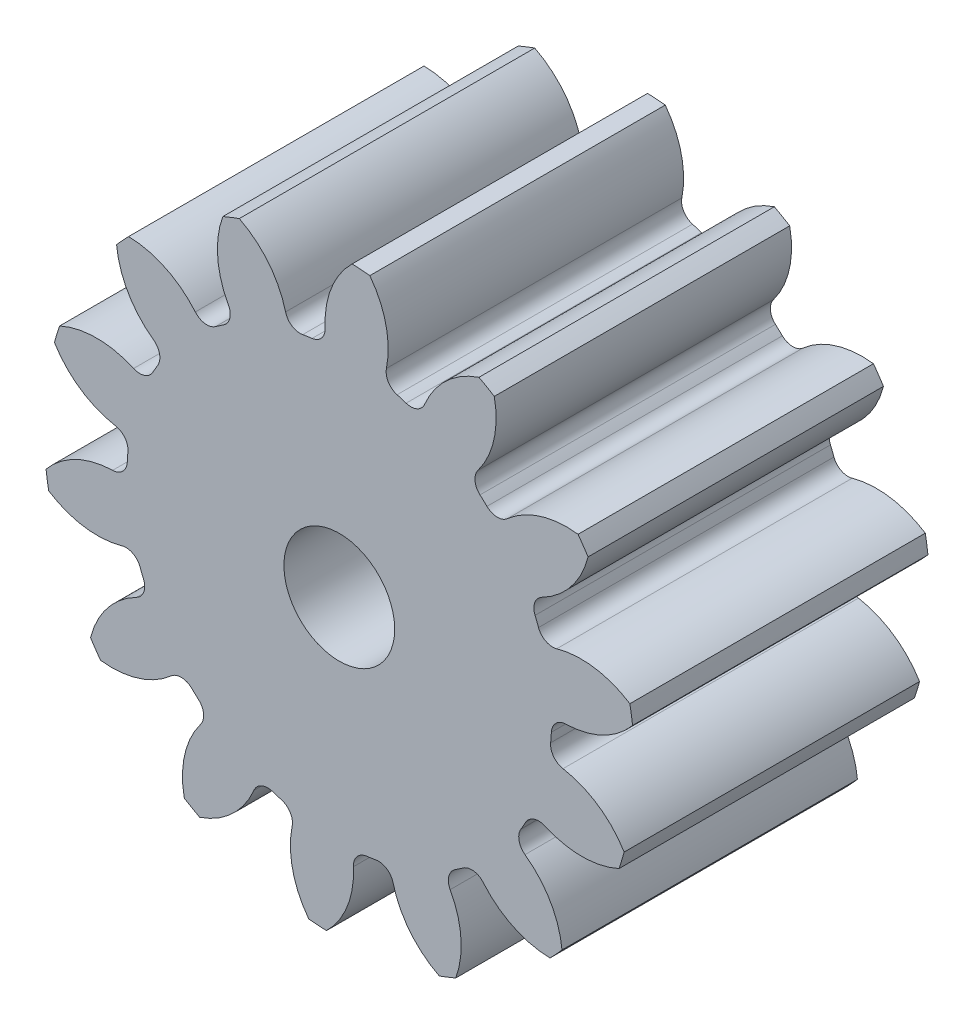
ISO-10303-21;
HEADER;
FILE_DESCRIPTION(('STEP AP214'),'2;1');
FILE_NAME('part.step','',(''),(''),'','','');
FILE_SCHEMA(('AUTOMOTIVE_DESIGN { 1 0 10303 214 1 1 1 1 }'));
ENDSEC;
DATA;
#1=APPLICATION_CONTEXT('core data for automotive mechanical design processes');
#2=APPLICATION_PROTOCOL_DEFINITION('international standard','automotive_design',2000,#1);
#3=PRODUCT_CONTEXT('',#1,'mechanical');
#4=PRODUCT('Part','Part','',(#3));
#5=PRODUCT_RELATED_PRODUCT_CATEGORY('part','',(#4));
#6=PRODUCT_DEFINITION_FORMATION('','',#4);
#7=PRODUCT_DEFINITION_CONTEXT('part definition',#1,'design');
#8=PRODUCT_DEFINITION('design','',#6,#7);
#9=PRODUCT_DEFINITION_SHAPE('','',#8);
#10=(LENGTH_UNIT() NAMED_UNIT(*) SI_UNIT(.MILLI.,.METRE.));
#11=(NAMED_UNIT(*) PLANE_ANGLE_UNIT() SI_UNIT($,.RADIAN.));
#12=(NAMED_UNIT(*) SI_UNIT($,.STERADIAN.) SOLID_ANGLE_UNIT());
#13=UNCERTAINTY_MEASURE_WITH_UNIT(LENGTH_MEASURE(1.E-05),#10,'distance_accuracy_value','');
#14=(GEOMETRIC_REPRESENTATION_CONTEXT(3) GLOBAL_UNCERTAINTY_ASSIGNED_CONTEXT((#13)) GLOBAL_UNIT_ASSIGNED_CONTEXT((#10,
#11,#12)) REPRESENTATION_CONTEXT('',''));
#15=CARTESIAN_POINT('',(0.,0.,0.));
#16=DIRECTION('',(0.,0.,1.));
#17=DIRECTION('',(1.,0.,0.));
#18=AXIS2_PLACEMENT_3D('',#15,#16,#17);
#19=CARTESIAN_POINT('',(0.,0.,101.6));
#20=DIRECTION('',(0.,0.,-1.));
#21=DIRECTION('',(-1.,0.,0.));
#22=AXIS2_PLACEMENT_3D('',#19,#20,#21);
#23=CYLINDRICAL_SURFACE('',#22,101.6);
#24=DIRECTION('',(0.,0.,-1.));
#25=VECTOR('',#24,1.);
#26=CARTESIAN_POINT('',(99.9429922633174,18.274525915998,50.8));
#27=LINE('',#26,#25);
#28=CARTESIAN_POINT('',(99.9429922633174,18.274525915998,101.6));
#29=VERTEX_POINT('',#28);
#30=CARTESIAN_POINT('',(99.9429922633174,18.274525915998,0.));
#31=VERTEX_POINT('',#30);
#32=EDGE_CURVE('E600',#29,#31,#27,.T.);
#33=ORIENTED_EDGE('',*,*,#32,.F.);
#34=CARTESIAN_POINT('',(0.,0.,101.6));
#35=DIRECTION('',(0.,0.,1.));
#36=DIRECTION('',(1.,0.,0.));
#37=AXIS2_PLACEMENT_3D('',#34,#35,#36);
#38=CIRCLE('',#37,101.6);
#39=CARTESIAN_POINT('',(100.858856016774,12.2495372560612,101.6));
#40=VERTEX_POINT('',#39);
#41=EDGE_CURVE('E1093',#40,#29,#38,.T.);
#42=ORIENTED_EDGE('',*,*,#41,.F.);
#43=DIRECTION('',(0.,0.,-1.));
#44=VECTOR('',#43,1.);
#45=CARTESIAN_POINT('',(100.858856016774,12.2495372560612,50.8));
#46=LINE('',#45,#44);
#47=CARTESIAN_POINT('',(100.858856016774,12.2495372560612,0.));
#48=VERTEX_POINT('',#47);
#49=EDGE_CURVE('E1087',#48,#40,#46,.F.);
#50=ORIENTED_EDGE('',*,*,#49,.F.);
#51=CARTESIAN_POINT('',(0.,0.,0.));
#52=DIRECTION('',(0.,0.,1.));
#53=DIRECTION('',(1.,0.,0.));
#54=AXIS2_PLACEMENT_3D('',#51,#52,#53);
#55=CIRCLE('',#54,101.6);
#56=EDGE_CURVE('E1098',#48,#31,#55,.T.);
#57=ORIENTED_EDGE('',*,*,#56,.T.);
#58=EDGE_LOOP('',(#33,#42,#50,#57));
#59=FACE_BOUND('',#58,.T.);
#60=ADVANCED_FACE('F33',(#59),#23,.T.);
#61=DIRECTION('',(0.,0.,-1.));
#62=VECTOR('',#61,1.);
#63=CARTESIAN_POINT('',(85.5558142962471,54.7974692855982,50.8));
#64=LINE('',#63,#62);
#65=CARTESIAN_POINT('',(85.5558142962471,54.7974692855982,0.));
#66=VERTEX_POINT('',#65);
#67=CARTESIAN_POINT('',(85.5558142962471,54.7974692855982,101.6));
#68=VERTEX_POINT('',#67);
#69=EDGE_CURVE('E571',#66,#68,#64,.F.);
#70=ORIENTED_EDGE('',*,*,#69,.F.);
#71=CARTESIAN_POINT('',(82.1165049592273,59.8284181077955,0.));
#72=VERTEX_POINT('',#71);
#73=EDGE_CURVE('E1101',#66,#72,#55,.T.);
#74=ORIENTED_EDGE('',*,*,#73,.T.);
#75=DIRECTION('',(0.,0.,-1.));
#76=VECTOR('',#75,1.);
#77=CARTESIAN_POINT('',(82.1165049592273,59.8284181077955,50.8));
#78=LINE('',#77,#76);
#79=CARTESIAN_POINT('',(82.1165049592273,59.8284181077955,101.6));
#80=VERTEX_POINT('',#79);
#81=EDGE_CURVE('E633',#80,#72,#78,.T.);
#82=ORIENTED_EDGE('',*,*,#81,.F.);
#83=EDGE_CURVE('E1096',#68,#80,#38,.T.);
#84=ORIENTED_EDGE('',*,*,#83,.F.);
#85=EDGE_LOOP('',(#70,#74,#82,#84));
#86=FACE_BOUND('',#85,.T.);
#87=ADVANCED_FACE('F1261',(#86),#23,.T.);
#88=CARTESIAN_POINT('',(0.,0.,101.6));
#89=DIRECTION('',(0.,0.,1.));
#90=DIRECTION('',(1.,0.,0.));
#91=AXIS2_PLACEMENT_3D('',#88,#89,#90);
#92=PLANE('',#91);
#93=CARTESIAN_POINT('',(0.,0.,101.599999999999));
#94=DIRECTION('',(0.,0.,1.));
#95=DIRECTION('',(1.,0.,0.));
#96=AXIS2_PLACEMENT_3D('',#93,#94,#95);
#97=CIRCLE('',#96,19.05);
#98=CARTESIAN_POINT('',(19.05,0.,101.599999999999));
#99=VERTEX_POINT('',#98);
#100=EDGE_CURVE('E588',#99,#99,#97,.T.);
#101=ORIENTED_EDGE('',*,*,#100,.F.);
#102=EDGE_LOOP('',(#101));
#103=FACE_BOUND('',#102,.T.);
#104=ORIENTED_EDGE('',*,*,#41,.T.);
#105=CARTESIAN_POINT('',(83.1931185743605,-7.59045937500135,101.6));
#106=DIRECTION('',(0.,0.,-1.));
#107=DIRECTION('',(0.900968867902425,0.433883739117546,0.));
#108=AXIS2_PLACEMENT_3D('',#105,#106,#107);
#109=CIRCLE('',#108,30.8148622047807);
#110=CARTESIAN_POINT('',(74.7847151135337,22.0550206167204,101.6));
#111=VERTEX_POINT('',#110);
#112=EDGE_CURVE('E580',#111,#29,#109,.T.);
#113=ORIENTED_EDGE('',*,*,#112,.F.);
#114=CARTESIAN_POINT('',(73.3742854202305,27.0277678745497,101.6));
#115=DIRECTION('',(0.,0.,1.));
#116=DIRECTION('',(-0.900968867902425,-0.433883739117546,0.));
#117=AXIS2_PLACEMENT_3D('',#114,#115,#116);
#118=CIRCLE('',#117,5.16890000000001);
#119=CARTESIAN_POINT('',(68.5239794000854,25.2411345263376,101.6));
#120=VERTEX_POINT('',#119);
#121=EDGE_CURVE('E578',#120,#111,#118,.T.);
#122=ORIENTED_EDGE('',*,*,#121,.F.);
#123=CARTESIAN_POINT('',(0.,0.,101.6));
#124=DIRECTION('',(0.,0.,-1.));
#125=DIRECTION('',(0.900968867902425,0.433883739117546,0.));
#126=AXIS2_PLACEMENT_3D('',#123,#124,#125);
#127=CIRCLE('',#126,73.025);
#128=CARTESIAN_POINT('',(67.3291315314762,28.2743465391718,101.6));
#129=VERTEX_POINT('',#128);
#130=EDGE_CURVE('E563',#129,#120,#127,.T.);
#131=ORIENTED_EDGE('',*,*,#130,.F.);
#132=CARTESIAN_POINT('',(72.0948631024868,30.2756785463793,101.6));
#133=DIRECTION('',(0.,0.,1.));
#134=DIRECTION('',(-0.900968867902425,-0.433883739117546,0.));
#135=AXIS2_PLACEMENT_3D('',#132,#133,#134);
#136=CIRCLE('',#135,5.16890000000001);
#137=CARTESIAN_POINT('',(69.7348916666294,34.8743807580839,101.6));
#138=VERTEX_POINT('',#137);
#139=EDGE_CURVE('E555',#138,#129,#136,.T.);
#140=ORIENTED_EDGE('',*,*,#139,.F.);
#141=CARTESIAN_POINT('',(55.6657097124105,62.2899575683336,101.6));
#142=DIRECTION('',(0.,0.,-1.));
#143=DIRECTION('',(-0.900968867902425,-0.433883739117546,0.));
#144=AXIS2_PLACEMENT_3D('',#141,#142,#143);
#145=CIRCLE('',#144,30.8148622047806);
#146=EDGE_CURVE('E585',#68,#138,#145,.T.);
#147=ORIENTED_EDGE('',*,*,#146,.F.);
#148=ORIENTED_EDGE('',*,*,#83,.T.);
#149=CARTESIAN_POINT('',(78.2477867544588,29.2573737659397,101.6));
#150=DIRECTION('',(0.,0.,-1.));
#151=DIRECTION('',(0.623489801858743,0.781831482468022,0.));
#152=AXIS2_PLACEMENT_3D('',#149,#150,#151);
#153=CIRCLE('',#152,30.8148622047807);
#154=CARTESIAN_POINT('',(57.8093853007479,52.3187587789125,101.6));
#155=VERTEX_POINT('',#154);
#156=EDGE_CURVE('E609',#155,#80,#153,.T.);
#157=ORIENTED_EDGE('',*,*,#156,.F.);
#158=CARTESIAN_POINT('',(54.381037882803,56.187086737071,101.6));
#159=DIRECTION('',(0.,0.,1.));
#160=DIRECTION('',(-0.623489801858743,-0.781831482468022,0.));
#161=AXIS2_PLACEMENT_3D('',#158,#159,#160);
#162=CIRCLE('',#161,5.16890000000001);
#163=CARTESIAN_POINT('',(50.7862543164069,52.4729168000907,101.6));
#164=VERTEX_POINT('',#163);
#165=EDGE_CURVE('E607',#164,#155,#162,.T.);
#166=ORIENTED_EDGE('',*,*,#165,.F.);
#167=CARTESIAN_POINT('',(0.,0.,101.6));
#168=DIRECTION('',(0.,0.,-1.));
#169=DIRECTION('',(0.623489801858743,0.781831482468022,0.));
#170=AXIS2_PLACEMENT_3D('',#167,#168,#169);
#171=CIRCLE('',#170,73.025);
#172=CARTESIAN_POINT('',(48.3936722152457,54.6873213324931,101.6));
#173=VERTEX_POINT('',#172);
#174=EDGE_CURVE('E604',#173,#164,#171,.T.);
#175=ORIENTED_EDGE('',*,*,#174,.F.);
#176=CARTESIAN_POINT('',(51.8191025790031,58.5582325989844,101.6));
#177=DIRECTION('',(0.,0.,1.));
#178=DIRECTION('',(-0.623489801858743,-0.781831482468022,0.));
#179=AXIS2_PLACEMENT_3D('',#176,#177,#178);
#180=CIRCLE('',#179,5.16890000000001);
#181=CARTESIAN_POINT('',(47.697539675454,61.6775668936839,101.6));
#182=VERTEX_POINT('',#181);
#183=EDGE_CURVE('E602',#182,#173,#180,.T.);
#184=ORIENTED_EDGE('',*,*,#183,.F.);
#185=CARTESIAN_POINT('',(23.1264717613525,80.2737588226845,101.6));
#186=DIRECTION('',(0.,0.,-1.));
#187=DIRECTION('',(-0.623489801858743,-0.781831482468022,0.));
#188=AXIS2_PLACEMENT_3D('',#185,#186,#187);
#189=CIRCLE('',#188,30.8148622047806);
#190=CARTESIAN_POINT('',(53.3073942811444,86.4920904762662,101.6));
#191=VERTEX_POINT('',#190);
#192=EDGE_CURVE('E612',#191,#182,#189,.T.);
#193=ORIENTED_EDGE('',*,*,#192,.F.);
#194=CARTESIAN_POINT('',(48.0258367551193,89.5325583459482,101.6));
#195=VERTEX_POINT('',#194);
#196=EDGE_CURVE('E1137',#191,#195,#38,.T.);
#197=ORIENTED_EDGE('',*,*,#196,.T.);
#198=CARTESIAN_POINT('',(57.8045211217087,60.3104252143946,101.6));
#199=DIRECTION('',(0.,0.,-1.));
#200=DIRECTION('',(0.222520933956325,0.974927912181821,0.));
#201=AXIS2_PLACEMENT_3D('',#198,#199,#200);
#202=CIRCLE('',#201,30.8148622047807);
#203=CARTESIAN_POINT('',(29.3841977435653,72.2201251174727,101.6));
#204=VERTEX_POINT('',#203);
#205=EDGE_CURVE('E644',#204,#195,#202,.T.);
#206=ORIENTED_EDGE('',*,*,#205,.F.);
#207=CARTESIAN_POINT('',(24.6169588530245,74.2178639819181,101.6));
#208=DIRECTION('',(0.,0.,1.));
#209=DIRECTION('',(-0.222520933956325,-0.974927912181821,0.));
#210=AXIS2_PLACEMENT_3D('',#207,#208,#209);
#211=CIRCLE('',#210,5.16890000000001);
#212=CARTESIAN_POINT('',(22.9896887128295,69.3117943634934,101.6));
#213=VERTEX_POINT('',#212);
#214=EDGE_CURVE('E642',#213,#204,#211,.T.);
#215=ORIENTED_EDGE('',*,*,#214,.F.);
#216=CARTESIAN_POINT('',(0.,0.,101.6));
#217=DIRECTION('',(0.,0.,-1.));
#218=DIRECTION('',(0.222520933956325,0.974927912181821,0.));
#219=AXIS2_PLACEMENT_3D('',#216,#217,#218);
#220=CIRCLE('',#219,73.025);
#221=CARTESIAN_POINT('',(19.873252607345,70.2688014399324,101.6));
#222=VERTEX_POINT('',#221);
#223=EDGE_CURVE('E639',#222,#213,#220,.T.);
#224=ORIENTED_EDGE('',*,*,#223,.F.);
#225=CARTESIAN_POINT('',(21.2799332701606,75.2426105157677,101.6));
#226=DIRECTION('',(0.,0.,1.));
#227=DIRECTION('',(-0.222520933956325,-0.974927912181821,0.));
#228=AXIS2_PLACEMENT_3D('',#225,#226,#227);
#229=CIRCLE('',#228,5.16890000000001);
#230=CARTESIAN_POINT('',(16.2131049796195,76.2647544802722,101.6));
#231=VERTEX_POINT('',#230);
#232=EDGE_CURVE('E637',#231,#222,#229,.T.);
#233=ORIENTED_EDGE('',*,*,#232,.F.);
#234=CARTESIAN_POINT('',(-13.9932475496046,82.3583576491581,101.6));
#235=DIRECTION('',(0.,0.,-1.));
#236=DIRECTION('',(-0.222520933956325,-0.974927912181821,0.));
#237=AXIS2_PLACEMENT_3D('',#234,#235,#236);
#238=CIRCLE('',#237,30.8148622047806);
#239=CARTESIAN_POINT('',(10.5007910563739,101.055892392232,101.6));
#240=VERTEX_POINT('',#239);
#241=EDGE_CURVE('E647',#240,#231,#238,.T.);
#242=ORIENTED_EDGE('',*,*,#241,.F.);
#243=CARTESIAN_POINT('',(4.42306258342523,101.503677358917,101.6));
#244=VERTEX_POINT('',#243);
#245=EDGE_CURVE('E1243',#240,#244,#38,.T.);
#246=ORIENTED_EDGE('',*,*,#245,.T.);
#247=CARTESIAN_POINT('',(25.9123611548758,79.4182572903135,101.6));
#248=DIRECTION('',(0.,0.,-1.));
#249=DIRECTION('',(-0.222520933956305,0.974927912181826,0.));
#250=AXIS2_PLACEMENT_3D('',#247,#248,#249);
#251=CIRCLE('',#250,30.8148622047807);
#252=CARTESIAN_POINT('',(-4.86089055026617,77.8174099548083,101.6));
#253=VERTEX_POINT('',#252);
#254=EDGE_CURVE('E682',#253,#244,#251,.T.);
#255=ORIENTED_EDGE('',*,*,#254,.F.);
#256=CARTESIAN_POINT('',(-10.0228107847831,77.5488830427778,101.6));
#257=DIRECTION('',(0.,0.,1.));
#258=DIRECTION('',(0.222520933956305,-0.974927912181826,0.));
#259=AXIS2_PLACEMENT_3D('',#256,#257,#258);
#260=CIRCLE('',#259,5.16890000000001);
#261=CARTESIAN_POINT('',(-9.3602666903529,72.4226209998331,101.6));
#262=VERTEX_POINT('',#261);
#263=EDGE_CURVE('E680',#262,#253,#260,.T.);
#264=ORIENTED_EDGE('',*,*,#263,.F.);
#265=CARTESIAN_POINT('',(0.,0.,101.6));
#266=DIRECTION('',(0.,0.,-1.));
#267=DIRECTION('',(-0.222520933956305,0.974927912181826,0.));
#268=AXIS2_PLACEMENT_3D('',#265,#266,#267);
#269=CIRCLE('',#268,73.025);
#270=CARTESIAN_POINT('',(-12.5833084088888,71.9326836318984,101.6));
#271=VERTEX_POINT('',#270);
#272=EDGE_CURVE('E677',#271,#262,#269,.T.);
#273=ORIENTED_EDGE('',*,*,#272,.F.);
#274=CARTESIAN_POINT('',(-13.4739878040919,77.0242666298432,101.6));
#275=DIRECTION('',(0.,0.,1.));
#276=DIRECTION('',(0.222520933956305,-0.974927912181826,0.));
#277=AXIS2_PLACEMENT_3D('',#274,#275,#276);
#278=CIRCLE('',#277,5.16890000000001);
#279=CARTESIAN_POINT('',(-18.4825339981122,75.7467721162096,101.6));
#280=VERTEX_POINT('',#279);
#281=EDGE_CURVE('E675',#280,#271,#278,.T.);
#282=ORIENTED_EDGE('',*,*,#281,.F.);
#283=CARTESIAN_POINT('',(-48.3414325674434,68.1308736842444,101.6));
#284=DIRECTION('',(0.,0.,-1.));
#285=DIRECTION('',(0.222520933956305,-0.974927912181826,0.));
#286=AXIS2_PLACEMENT_3D('',#283,#284,#285);
#287=CIRCLE('',#286,30.8148622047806);
#288=CARTESIAN_POINT('',(-34.3856226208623,95.6043354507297,101.6));
#289=VERTEX_POINT('',#288);
#290=EDGE_CURVE('E685',#289,#280,#287,.T.);
#291=ORIENTED_EDGE('',*,*,#290,.F.);
#292=CARTESIAN_POINT('',(-40.055753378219,93.3707482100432,101.6));
#293=VERTEX_POINT('',#292);
#294=EDGE_CURVE('E1239',#289,#293,#38,.T.);
#295=ORIENTED_EDGE('',*,*,#294,.T.);
#296=CARTESIAN_POINT('',(-11.1120597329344,82.7963295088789,101.6));
#297=DIRECTION('',(0.,0.,-1.));
#298=DIRECTION('',(-0.623489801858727,0.781831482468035,0.));
#299=AXIS2_PLACEMENT_3D('',#296,#297,#298);
#300=CIRCLE('',#299,30.8148622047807);
#301=CARTESIAN_POINT('',(-38.143219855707,68.0020023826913,101.6));
#302=VERTEX_POINT('',#301);
#303=EDGE_CURVE('E720',#302,#293,#300,.T.);
#304=ORIENTED_EDGE('',*,*,#303,.F.);
#305=CARTESIAN_POINT('',(-42.6774398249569,65.5203947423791,101.6));
#306=DIRECTION('',(0.,0.,1.));
#307=DIRECTION('',(0.623489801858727,-0.781831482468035,0.));
#308=AXIS2_PLACEMENT_3D('',#305,#306,#307);
#309=CIRCLE('',#308,5.16890000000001);
#310=CARTESIAN_POINT('',(-39.8563064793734,61.1892593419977,101.6));
#311=VERTEX_POINT('',#310);
#312=EDGE_CURVE('E718',#311,#302,#309,.T.);
#313=ORIENTED_EDGE('',*,*,#312,.F.);
#314=CARTESIAN_POINT('',(0.,0.,101.6));
#315=DIRECTION('',(0.,0.,-1.));
#316=DIRECTION('',(-0.623489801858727,0.781831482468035,0.));
#317=AXIS2_PLACEMENT_3D('',#314,#315,#316);
#318=CIRCLE('',#317,73.025);
#319=CARTESIAN_POINT('',(-42.547590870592,59.3494156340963,101.6));
#320=VERTEX_POINT('',#319);
#321=EDGE_CURVE('E715',#320,#311,#318,.T.);
#322=ORIENTED_EDGE('',*,*,#321,.F.);
#323=CARTESIAN_POINT('',(-45.5592203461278,63.5503220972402,101.6));
#324=DIRECTION('',(0.,0.,1.));
#325=DIRECTION('',(0.623489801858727,-0.781831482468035,0.));
#326=AXIS2_PLACEMENT_3D('',#323,#324,#325);
#327=CIRCLE('',#326,5.16890000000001);
#328=CARTESIAN_POINT('',(-49.5174804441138,60.2262125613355,101.6));
#329=VERTEX_POINT('',#328);
#330=EDGE_CURVE('E713',#329,#320,#327,.T.);
#331=ORIENTED_EDGE('',*,*,#330,.F.);
#332=CARTESIAN_POINT('',(-73.1150039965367,40.4092346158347,101.6));
#333=DIRECTION('',(0.,0.,-1.));
#334=DIRECTION('',(0.623489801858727,-0.781831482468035,0.));
#335=AXIS2_PLACEMENT_3D('',#332,#333,#334);
#336=CIRCLE('',#335,30.8148622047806);
#337=CARTESIAN_POINT('',(-72.4615420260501,71.2171673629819,101.6));
#338=VERTEX_POINT('',#337);
#339=EDGE_CURVE('E723',#338,#329,#336,.T.);
#340=ORIENTED_EDGE('',*,*,#339,.F.);
#341=CARTESIAN_POINT('',(-76.6010361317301,66.744597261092,101.6));
#342=VERTEX_POINT('',#341);
#343=EDGE_CURVE('E1235',#338,#342,#38,.T.);
#344=ORIENTED_EDGE('',*,*,#343,.T.);
#345=CARTESIAN_POINT('',(-45.9356009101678,69.775573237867,101.6));
#346=DIRECTION('',(0.,0.,-1.));
#347=DIRECTION('',(-0.900968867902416,0.433883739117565,0.));
#348=AXIS2_PLACEMENT_3D('',#345,#346,#347);
#349=CIRCLE('',#348,30.8148622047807);
#350=CARTESIAN_POINT('',(-63.8708166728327,44.7179642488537,101.6));
#351=VERTEX_POINT('',#350);
#352=EDGE_CURVE('E758',#351,#342,#349,.T.);
#353=ORIENTED_EDGE('',*,*,#352,.F.);
#354=CARTESIAN_POINT('',(-66.8792785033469,40.514788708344,101.6));
#355=DIRECTION('',(0.,0.,1.));
#356=DIRECTION('',(0.900968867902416,-0.433883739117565,0.));
#357=AXIS2_PLACEMENT_3D('',#354,#355,#356);
#358=CIRCLE('',#357,5.16890000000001);
#359=CARTESIAN_POINT('',(-62.4583159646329,37.8366144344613,101.6));
#360=VERTEX_POINT('',#359);
#361=EDGE_CURVE('E756',#360,#351,#358,.T.);
#362=ORIENTED_EDGE('',*,*,#361,.F.);
#363=CARTESIAN_POINT('',(0.,0.,101.6));
#364=DIRECTION('',(0.,0.,-1.));
#365=DIRECTION('',(-0.900968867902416,0.433883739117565,0.));
#366=AXIS2_PLACEMENT_3D('',#363,#364,#365);
#367=CIRCLE('',#366,73.025);
#368=CARTESIAN_POINT('',(-64.0848011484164,35.0112679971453,101.6));
#369=VERTEX_POINT('',#368);
#370=EDGE_CURVE('E753',#369,#360,#367,.T.);
#371=ORIENTED_EDGE('',*,*,#370,.F.);
#372=CARTESIAN_POINT('',(-68.6208905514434,37.4894568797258,101.6));
#373=DIRECTION('',(0.,0.,1.));
#374=DIRECTION('',(0.900968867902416,-0.433883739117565,0.));
#375=AXIS2_PLACEMENT_3D('',#372,#373,#374);
#376=CIRCLE('',#375,5.16890000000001);
#377=CARTESIAN_POINT('',(-70.7448825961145,32.7771129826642,101.6));
#378=VERTEX_POINT('',#377);
#379=EDGE_CURVE('E751',#378,#369,#376,.T.);
#380=ORIENTED_EDGE('',*,*,#379,.F.);
#381=CARTESIAN_POINT('',(-83.4072521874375,4.68405104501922,101.6));
#382=DIRECTION('',(0.,0.,-1.));
#383=DIRECTION('',(0.900968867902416,-0.433883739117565,0.));
#384=AXIS2_PLACEMENT_3D('',#381,#382,#383);
#385=CIRCLE('',#384,30.8148622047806);
#386=CARTESIAN_POINT('',(-96.1855643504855,32.7245658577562,101.6));
#387=VERTEX_POINT('',#386);
#388=EDGE_CURVE('E761',#387,#378,#385,.T.);
#389=ORIENTED_EDGE('',*,*,#388,.F.);
#390=CARTESIAN_POINT('',(-97.9745442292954,26.8988602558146,101.6));
#391=VERTEX_POINT('',#390);
#392=EDGE_CURVE('E1231',#387,#391,#38,.T.);
#393=ORIENTED_EDGE('',*,*,#392,.T.);
#394=CARTESIAN_POINT('',(-71.661032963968,42.9349089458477,101.6));
#395=DIRECTION('',(0.,0.,-1.));
#396=DIRECTION('',(-1.,0.,0.));
#397=AXIS2_PLACEMENT_3D('',#394,#395,#396);
#398=CIRCLE('',#397,30.8148622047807);
#399=CARTESIAN_POINT('',(-76.948014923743,12.5769848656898,101.6));
#400=VERTEX_POINT('',#399);
#401=EDGE_CURVE('E796',#400,#391,#398,.T.);
#402=ORIENTED_EDGE('',*,*,#401,.F.);
#403=CARTESIAN_POINT('',(-77.8348558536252,7.48473188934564,101.6));
#404=DIRECTION('',(0.,0.,1.));
#405=DIRECTION('',(1.,0.,0.));
#406=AXIS2_PLACEMENT_3D('',#403,#404,#405);
#407=CIRCLE('',#406,5.16890000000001);
#408=CARTESIAN_POINT('',(-72.6896899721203,6.98996400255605,101.6));
#409=VERTEX_POINT('',#408);
#410=EDGE_CURVE('E794',#409,#400,#407,.T.);
#411=ORIENTED_EDGE('',*,*,#410,.F.);
#412=CARTESIAN_POINT('',(0.,0.,101.6));
#413=DIRECTION('',(0.,0.,-1.));
#414=DIRECTION('',(-1.,0.,0.));
#415=AXIS2_PLACEMENT_3D('',#412,#413,#414);
#416=CIRCLE('',#415,73.025);
#417=CARTESIAN_POINT('',(-72.9292306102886,3.73870934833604,101.6));
#418=VERTEX_POINT('',#417);
#419=EDGE_CURVE('E791',#418,#409,#416,.T.);
#420=ORIENTED_EDGE('',*,*,#419,.F.);
#421=CARTESIAN_POINT('',(-78.0913518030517,4.00334494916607,101.6));
#422=DIRECTION('',(0.,0.,1.));
#423=DIRECTION('',(1.,0.,0.));
#424=AXIS2_PLACEMENT_3D('',#421,#422,#423);
#425=CIRCLE('',#424,5.16890000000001);
#426=CARTESIAN_POINT('',(-77.9603931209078,-1.16389580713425,101.6));
#427=VERTEX_POINT('',#426);
#428=EDGE_CURVE('E789',#427,#418,#425,.T.);
#429=ORIENTED_EDGE('',*,*,#428,.F.);
#430=CARTESIAN_POINT('',(-77.1796711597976,-31.9688662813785,101.6));
#431=DIRECTION('',(0.,0.,-1.));
#432=DIRECTION('',(1.,0.,0.));
#433=AXIS2_PLACEMENT_3D('',#430,#431,#432);
#434=CIRCLE('',#433,30.8148622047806);
#435=CARTESIAN_POINT('',(-100.858856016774,-12.2495372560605,101.6));
#436=VERTEX_POINT('',#435);
#437=EDGE_CURVE('E799',#436,#427,#434,.T.);
#438=ORIENTED_EDGE('',*,*,#437,.F.);
#439=CARTESIAN_POINT('',(-99.9429922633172,-18.2745259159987,101.6));
#440=VERTEX_POINT('',#439);
#441=EDGE_CURVE('E1227',#436,#440,#38,.T.);
#442=ORIENTED_EDGE('',*,*,#441,.T.);
#443=CARTESIAN_POINT('',(-83.1931185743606,7.59045937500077,101.6));
#444=DIRECTION('',(0.,0.,-1.));
#445=DIRECTION('',(-0.900968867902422,-0.433883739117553,0.));
#446=AXIS2_PLACEMENT_3D('',#443,#444,#445);
#447=CIRCLE('',#446,30.8148622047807);
#448=CARTESIAN_POINT('',(-74.7847151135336,-22.0550206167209,101.6));
#449=VERTEX_POINT('',#448);
#450=EDGE_CURVE('E834',#449,#440,#447,.T.);
#451=ORIENTED_EDGE('',*,*,#450,.F.);
#452=CARTESIAN_POINT('',(-73.3742854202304,-27.0277678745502,101.6));
#453=DIRECTION('',(0.,0.,1.));
#454=DIRECTION('',(0.900968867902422,0.433883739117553,0.));
#455=AXIS2_PLACEMENT_3D('',#452,#453,#454);
#456=CIRCLE('',#455,5.16890000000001);
#457=CARTESIAN_POINT('',(-68.5239794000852,-25.2411345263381,101.6));
#458=VERTEX_POINT('',#457);
#459=EDGE_CURVE('E832',#458,#449,#456,.T.);
#460=ORIENTED_EDGE('',*,*,#459,.F.);
#461=CARTESIAN_POINT('',(0.,0.,101.6));
#462=DIRECTION('',(0.,0.,-1.));
#463=DIRECTION('',(-0.900968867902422,-0.433883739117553,0.));
#464=AXIS2_PLACEMENT_3D('',#461,#462,#463);
#465=CIRCLE('',#464,73.025);
#466=CARTESIAN_POINT('',(-67.329131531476,-28.2743465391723,101.6));
#467=VERTEX_POINT('',#466);
#468=EDGE_CURVE('E829',#467,#458,#465,.T.);
#469=ORIENTED_EDGE('',*,*,#468,.F.);
#470=CARTESIAN_POINT('',(-72.0948631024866,-30.2756785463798,101.6));
#471=DIRECTION('',(0.,0.,1.));
#472=DIRECTION('',(0.900968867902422,0.433883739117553,0.));
#473=AXIS2_PLACEMENT_3D('',#470,#471,#472);
#474=CIRCLE('',#473,5.16890000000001);
#475=CARTESIAN_POINT('',(-69.7348916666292,-34.8743807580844,101.6));
#476=VERTEX_POINT('',#475);
#477=EDGE_CURVE('E827',#476,#467,#474,.T.);
#478=ORIENTED_EDGE('',*,*,#477,.F.);
#479=CARTESIAN_POINT('',(-55.66570971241,-62.289957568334,101.6));
#480=DIRECTION('',(0.,0.,-1.));
#481=DIRECTION('',(0.900968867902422,0.433883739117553,0.));
#482=AXIS2_PLACEMENT_3D('',#479,#480,#481);
#483=CIRCLE('',#482,30.8148622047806);
#484=CARTESIAN_POINT('',(-85.5558142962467,-54.7974692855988,101.6));
#485=VERTEX_POINT('',#484);
#486=EDGE_CURVE('E837',#485,#476,#483,.T.);
#487=ORIENTED_EDGE('',*,*,#486,.F.);
#488=CARTESIAN_POINT('',(-82.1165049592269,-59.8284181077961,101.6));
#489=VERTEX_POINT('',#488);
#490=EDGE_CURVE('E1223',#485,#489,#38,.T.);
#491=ORIENTED_EDGE('',*,*,#490,.T.);
#492=CARTESIAN_POINT('',(-78.2477867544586,-29.2573737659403,101.6));
#493=DIRECTION('',(0.,0.,-1.));
#494=DIRECTION('',(-0.623489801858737,-0.781831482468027,0.));
#495=AXIS2_PLACEMENT_3D('',#492,#493,#494);
#496=CIRCLE('',#495,30.8148622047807);
#497=CARTESIAN_POINT('',(-57.8093853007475,-52.318758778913,101.6));
#498=VERTEX_POINT('',#497);
#499=EDGE_CURVE('E872',#498,#489,#496,.T.);
#500=ORIENTED_EDGE('',*,*,#499,.F.);
#501=CARTESIAN_POINT('',(-54.3810378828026,-56.1870867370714,101.6));
#502=DIRECTION('',(0.,0.,1.));
#503=DIRECTION('',(0.623489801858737,0.781831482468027,0.));
#504=AXIS2_PLACEMENT_3D('',#501,#502,#503);
#505=CIRCLE('',#504,5.16890000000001);
#506=CARTESIAN_POINT('',(-50.7862543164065,-52.4729168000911,101.6));
#507=VERTEX_POINT('',#506);
#508=EDGE_CURVE('E870',#507,#498,#505,.T.);
#509=ORIENTED_EDGE('',*,*,#508,.F.);
#510=CARTESIAN_POINT('',(0.,0.,101.6));
#511=DIRECTION('',(0.,0.,-1.));
#512=DIRECTION('',(-0.623489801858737,-0.781831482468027,0.));
#513=AXIS2_PLACEMENT_3D('',#510,#511,#512);
#514=CIRCLE('',#513,73.025);
#515=CARTESIAN_POINT('',(-48.3936722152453,-54.6873213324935,101.6));
#516=VERTEX_POINT('',#515);
#517=EDGE_CURVE('E867',#516,#507,#514,.T.);
#518=ORIENTED_EDGE('',*,*,#517,.F.);
#519=CARTESIAN_POINT('',(-51.8191025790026,-58.5582325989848,101.6));
#520=DIRECTION('',(0.,0.,1.));
#521=DIRECTION('',(0.623489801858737,0.781831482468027,0.));
#522=AXIS2_PLACEMENT_3D('',#519,#520,#521);
#523=CIRCLE('',#522,5.16890000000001);
#524=CARTESIAN_POINT('',(-47.6975396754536,-61.6775668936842,101.6));
#525=VERTEX_POINT('',#524);
#526=EDGE_CURVE('E865',#525,#516,#523,.T.);
#527=ORIENTED_EDGE('',*,*,#526,.F.);
#528=CARTESIAN_POINT('',(-23.1264717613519,-80.2737588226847,101.6));
#529=DIRECTION('',(0.,0.,-1.));
#530=DIRECTION('',(0.623489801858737,0.781831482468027,0.));
#531=AXIS2_PLACEMENT_3D('',#528,#529,#530);
#532=CIRCLE('',#531,30.8148622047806);
#533=CARTESIAN_POINT('',(-53.3073942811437,-86.4920904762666,101.6));
#534=VERTEX_POINT('',#533);
#535=EDGE_CURVE('E875',#534,#525,#532,.T.);
#536=ORIENTED_EDGE('',*,*,#535,.F.);
#537=CARTESIAN_POINT('',(-48.0258367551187,-89.5325583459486,101.6));
#538=VERTEX_POINT('',#537);
#539=EDGE_CURVE('E1219',#534,#538,#38,.T.);
#540=ORIENTED_EDGE('',*,*,#539,.T.);
#541=CARTESIAN_POINT('',(-57.8045211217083,-60.310425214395,101.6));
#542=DIRECTION('',(0.,0.,-1.));
#543=DIRECTION('',(-0.222520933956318,-0.974927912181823,0.));
#544=AXIS2_PLACEMENT_3D('',#541,#542,#543);
#545=CIRCLE('',#544,30.8148622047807);
#546=CARTESIAN_POINT('',(-29.3841977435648,-72.2201251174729,101.6));
#547=VERTEX_POINT('',#546);
#548=EDGE_CURVE('E910',#547,#538,#545,.T.);
#549=ORIENTED_EDGE('',*,*,#548,.F.);
#550=CARTESIAN_POINT('',(-24.616958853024,-74.2178639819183,101.6));
#551=DIRECTION('',(0.,0.,1.));
#552=DIRECTION('',(0.222520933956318,0.974927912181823,0.));
#553=AXIS2_PLACEMENT_3D('',#550,#551,#552);
#554=CIRCLE('',#553,5.16890000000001);
#555=CARTESIAN_POINT('',(-22.989688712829,-69.3117943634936,101.6));
#556=VERTEX_POINT('',#555);
#557=EDGE_CURVE('E908',#556,#547,#554,.T.);
#558=ORIENTED_EDGE('',*,*,#557,.F.);
#559=CARTESIAN_POINT('',(0.,0.,101.6));
#560=DIRECTION('',(0.,0.,-1.));
#561=DIRECTION('',(-0.222520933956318,-0.974927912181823,0.));
#562=AXIS2_PLACEMENT_3D('',#559,#560,#561);
#563=CIRCLE('',#562,73.025);
#564=CARTESIAN_POINT('',(-19.8732526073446,-70.2688014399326,101.6));
#565=VERTEX_POINT('',#564);
#566=EDGE_CURVE('E905',#565,#556,#563,.T.);
#567=ORIENTED_EDGE('',*,*,#566,.F.);
#568=CARTESIAN_POINT('',(-21.2799332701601,-75.2426105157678,101.6));
#569=DIRECTION('',(0.,0.,1.));
#570=DIRECTION('',(0.222520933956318,0.974927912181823,0.));
#571=AXIS2_PLACEMENT_3D('',#568,#569,#570);
#572=CIRCLE('',#571,5.16890000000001);
#573=CARTESIAN_POINT('',(-16.213104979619,-76.2647544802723,101.6));
#574=VERTEX_POINT('',#573);
#575=EDGE_CURVE('E903',#574,#565,#572,.T.);
#576=ORIENTED_EDGE('',*,*,#575,.F.);
#577=CARTESIAN_POINT('',(13.9932475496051,-82.358357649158,101.6));
#578=DIRECTION('',(0.,0.,-1.));
#579=DIRECTION('',(0.222520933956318,0.974927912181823,0.));
#580=AXIS2_PLACEMENT_3D('',#577,#578,#579);
#581=CIRCLE('',#580,30.8148622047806);
#582=CARTESIAN_POINT('',(-10.5007910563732,-101.055892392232,101.6));
#583=VERTEX_POINT('',#582);
#584=EDGE_CURVE('E913',#583,#574,#581,.T.);
#585=ORIENTED_EDGE('',*,*,#584,.F.);
#586=CARTESIAN_POINT('',(-4.42306258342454,-101.503677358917,101.6));
#587=VERTEX_POINT('',#586);
#588=EDGE_CURVE('E1215',#583,#587,#38,.T.);
#589=ORIENTED_EDGE('',*,*,#588,.T.);
#590=CARTESIAN_POINT('',(-25.9123611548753,-79.4182572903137,101.6));
#591=DIRECTION('',(0.,0.,-1.));
#592=DIRECTION('',(0.222520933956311,-0.974927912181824,0.));
#593=AXIS2_PLACEMENT_3D('',#590,#591,#592);
#594=CIRCLE('',#593,30.8148622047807);
#595=CARTESIAN_POINT('',(4.86089055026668,-77.8174099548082,101.6));
#596=VERTEX_POINT('',#595);
#597=EDGE_CURVE('E948',#596,#587,#594,.T.);
#598=ORIENTED_EDGE('',*,*,#597,.F.);
#599=CARTESIAN_POINT('',(10.0228107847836,-77.5488830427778,101.6));
#600=DIRECTION('',(0.,0.,1.));
#601=DIRECTION('',(-0.222520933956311,0.974927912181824,0.));
#602=AXIS2_PLACEMENT_3D('',#599,#600,#601);
#603=CIRCLE('',#602,5.16890000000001);
#604=CARTESIAN_POINT('',(9.36026669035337,-72.422620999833,101.6));
#605=VERTEX_POINT('',#604);
#606=EDGE_CURVE('E946',#605,#596,#603,.T.);
#607=ORIENTED_EDGE('',*,*,#606,.F.);
#608=CARTESIAN_POINT('',(0.,0.,101.6));
#609=DIRECTION('',(0.,0.,-1.));
#610=DIRECTION('',(0.222520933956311,-0.974927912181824,0.));
#611=AXIS2_PLACEMENT_3D('',#608,#609,#610);
#612=CIRCLE('',#611,73.025);
#613=CARTESIAN_POINT('',(12.5833084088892,-71.9326836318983,101.6));
#614=VERTEX_POINT('',#613);
#615=EDGE_CURVE('E943',#614,#605,#612,.T.);
#616=ORIENTED_EDGE('',*,*,#615,.F.);
#617=CARTESIAN_POINT('',(13.4739878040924,-77.0242666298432,101.6));
#618=DIRECTION('',(0.,0.,1.));
#619=DIRECTION('',(-0.222520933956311,0.974927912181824,0.));
#620=AXIS2_PLACEMENT_3D('',#617,#618,#619);
#621=CIRCLE('',#620,5.16890000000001);
#622=CARTESIAN_POINT('',(18.4825339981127,-75.7467721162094,101.6));
#623=VERTEX_POINT('',#622);
#624=EDGE_CURVE('E941',#623,#614,#621,.T.);
#625=ORIENTED_EDGE('',*,*,#624,.F.);
#626=CARTESIAN_POINT('',(48.3414325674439,-68.1308736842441,101.6));
#627=DIRECTION('',(0.,0.,-1.));
#628=DIRECTION('',(-0.222520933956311,0.974927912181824,0.));
#629=AXIS2_PLACEMENT_3D('',#626,#627,#628);
#630=CIRCLE('',#629,30.8148622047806);
#631=CARTESIAN_POINT('',(34.3856226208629,-95.6043354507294,101.6));
#632=VERTEX_POINT('',#631);
#633=EDGE_CURVE('E951',#632,#623,#630,.T.);
#634=ORIENTED_EDGE('',*,*,#633,.F.);
#635=CARTESIAN_POINT('',(40.0557533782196,-93.370748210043,101.6));
#636=VERTEX_POINT('',#635);
#637=EDGE_CURVE('E1211',#632,#636,#38,.T.);
#638=ORIENTED_EDGE('',*,*,#637,.T.);
#639=CARTESIAN_POINT('',(11.112059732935,-82.7963295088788,101.6));
#640=DIRECTION('',(0.,0.,-1.));
#641=DIRECTION('',(0.623489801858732,-0.781831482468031,0.));
#642=AXIS2_PLACEMENT_3D('',#639,#640,#641);
#643=CIRCLE('',#642,30.8148622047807);
#644=CARTESIAN_POINT('',(38.1432198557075,-68.0020023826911,101.6));
#645=VERTEX_POINT('',#644);
#646=EDGE_CURVE('E986',#645,#636,#643,.T.);
#647=ORIENTED_EDGE('',*,*,#646,.F.);
#648=CARTESIAN_POINT('',(42.6774398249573,-65.5203947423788,101.6));
#649=DIRECTION('',(0.,0.,1.));
#650=DIRECTION('',(-0.623489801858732,0.781831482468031,0.));
#651=AXIS2_PLACEMENT_3D('',#648,#649,#650);
#652=CIRCLE('',#651,5.16890000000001);
#653=CARTESIAN_POINT('',(39.8563064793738,-61.1892593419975,101.6));
#654=VERTEX_POINT('',#653);
#655=EDGE_CURVE('E984',#654,#645,#652,.T.);
#656=ORIENTED_EDGE('',*,*,#655,.F.);
#657=CARTESIAN_POINT('',(0.,0.,101.6));
#658=DIRECTION('',(0.,0.,-1.));
#659=DIRECTION('',(0.623489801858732,-0.781831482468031,0.));
#660=AXIS2_PLACEMENT_3D('',#657,#658,#659);
#661=CIRCLE('',#660,73.025);
#662=CARTESIAN_POINT('',(42.5475908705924,-59.349415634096,101.6));
#663=VERTEX_POINT('',#662);
#664=EDGE_CURVE('E981',#663,#654,#661,.T.);
#665=ORIENTED_EDGE('',*,*,#664,.F.);
#666=CARTESIAN_POINT('',(45.5592203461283,-63.5503220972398,101.6));
#667=DIRECTION('',(0.,0.,1.));
#668=DIRECTION('',(-0.623489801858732,0.781831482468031,0.));
#669=AXIS2_PLACEMENT_3D('',#666,#667,#668);
#670=CIRCLE('',#669,5.16890000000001);
#671=CARTESIAN_POINT('',(49.5174804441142,-60.2262125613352,101.6));
#672=VERTEX_POINT('',#671);
#673=EDGE_CURVE('E979',#672,#663,#670,.T.);
#674=ORIENTED_EDGE('',*,*,#673,.F.);
#675=CARTESIAN_POINT('',(73.115003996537,-40.4092346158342,101.6));
#676=DIRECTION('',(0.,0.,-1.));
#677=DIRECTION('',(-0.623489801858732,0.781831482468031,0.));
#678=AXIS2_PLACEMENT_3D('',#675,#676,#677);
#679=CIRCLE('',#678,30.8148622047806);
#680=CARTESIAN_POINT('',(72.4615420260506,-71.2171673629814,101.6));
#681=VERTEX_POINT('',#680);
#682=EDGE_CURVE('E989',#681,#672,#679,.T.);
#683=ORIENTED_EDGE('',*,*,#682,.F.);
#684=CARTESIAN_POINT('',(76.6010361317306,-66.7445972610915,101.6));
#685=VERTEX_POINT('',#684);
#686=EDGE_CURVE('E1210',#681,#685,#38,.T.);
#687=ORIENTED_EDGE('',*,*,#686,.T.);
#688=CARTESIAN_POINT('',(45.9356009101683,-69.7755732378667,101.6));
#689=DIRECTION('',(0.,0.,-1.));
#690=DIRECTION('',(0.900968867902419,-0.433883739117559,0.));
#691=AXIS2_PLACEMENT_3D('',#688,#689,#690);
#692=CIRCLE('',#691,30.8148622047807);
#693=CARTESIAN_POINT('',(63.870816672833,-44.7179642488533,101.6));
#694=VERTEX_POINT('',#693);
#695=EDGE_CURVE('E1024',#694,#685,#692,.T.);
#696=ORIENTED_EDGE('',*,*,#695,.F.);
#697=CARTESIAN_POINT('',(66.8792785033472,-40.5147887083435,101.6));
#698=DIRECTION('',(0.,0.,1.));
#699=DIRECTION('',(-0.900968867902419,0.433883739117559,0.));
#700=AXIS2_PLACEMENT_3D('',#697,#698,#699);
#701=CIRCLE('',#700,5.16890000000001);
#702=CARTESIAN_POINT('',(62.4583159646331,-37.8366144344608,101.6));
#703=VERTEX_POINT('',#702);
#704=EDGE_CURVE('E1022',#703,#694,#701,.T.);
#705=ORIENTED_EDGE('',*,*,#704,.F.);
#706=CARTESIAN_POINT('',(0.,0.,101.6));
#707=DIRECTION('',(0.,0.,-1.));
#708=DIRECTION('',(0.900968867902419,-0.433883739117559,0.));
#709=AXIS2_PLACEMENT_3D('',#706,#707,#708);
#710=CIRCLE('',#709,73.025);
#711=CARTESIAN_POINT('',(64.0848011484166,-35.0112679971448,101.6));
#712=VERTEX_POINT('',#711);
#713=EDGE_CURVE('E1019',#712,#703,#710,.T.);
#714=ORIENTED_EDGE('',*,*,#713,.F.);
#715=CARTESIAN_POINT('',(68.6208905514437,-37.4894568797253,101.6));
#716=DIRECTION('',(0.,0.,1.));
#717=DIRECTION('',(-0.900968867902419,0.433883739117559,0.));
#718=AXIS2_PLACEMENT_3D('',#715,#716,#717);
#719=CIRCLE('',#718,5.16890000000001);
#720=CARTESIAN_POINT('',(70.7448825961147,-32.7771129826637,101.6));
#721=VERTEX_POINT('',#720);
#722=EDGE_CURVE('E1017',#721,#712,#719,.T.);
#723=ORIENTED_EDGE('',*,*,#722,.F.);
#724=CARTESIAN_POINT('',(83.4072521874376,-4.68405104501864,101.6));
#725=DIRECTION('',(0.,0.,-1.));
#726=DIRECTION('',(-0.900968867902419,0.433883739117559,0.));
#727=AXIS2_PLACEMENT_3D('',#724,#725,#726);
#728=CIRCLE('',#727,30.8148622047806);
#729=CARTESIAN_POINT('',(96.1855643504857,-32.7245658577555,101.6));
#730=VERTEX_POINT('',#729);
#731=EDGE_CURVE('E1027',#730,#721,#728,.T.);
#732=ORIENTED_EDGE('',*,*,#731,.F.);
#733=CARTESIAN_POINT('',(97.9745442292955,-26.8988602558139,101.6));
#734=VERTEX_POINT('',#733);
#735=EDGE_CURVE('E1097',#730,#734,#38,.T.);
#736=ORIENTED_EDGE('',*,*,#735,.T.);
#737=CARTESIAN_POINT('',(71.6610329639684,-42.9349089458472,101.6));
#738=DIRECTION('',(0.,0.,-1.));
#739=DIRECTION('',(1.,0.,0.));
#740=AXIS2_PLACEMENT_3D('',#737,#738,#739);
#741=CIRCLE('',#740,30.8148622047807);
#742=CARTESIAN_POINT('',(76.948014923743,-12.5769848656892,101.6));
#743=VERTEX_POINT('',#742);
#744=EDGE_CURVE('E1062',#743,#734,#741,.T.);
#745=ORIENTED_EDGE('',*,*,#744,.F.);
#746=CARTESIAN_POINT('',(77.8348558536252,-7.4847318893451,101.6));
#747=DIRECTION('',(0.,0.,1.));
#748=DIRECTION('',(-1.,0.,0.));
#749=AXIS2_PLACEMENT_3D('',#746,#747,#748);
#750=CIRCLE('',#749,5.16890000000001);
#751=CARTESIAN_POINT('',(72.6896899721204,-6.98996400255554,101.6));
#752=VERTEX_POINT('',#751);
#753=EDGE_CURVE('E1060',#752,#743,#750,.T.);
#754=ORIENTED_EDGE('',*,*,#753,.F.);
#755=CARTESIAN_POINT('',(0.,0.,101.6));
#756=DIRECTION('',(0.,0.,-1.));
#757=DIRECTION('',(1.,0.,0.));
#758=AXIS2_PLACEMENT_3D('',#755,#756,#757);
#759=CIRCLE('',#758,73.025);
#760=CARTESIAN_POINT('',(72.9292306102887,-3.73870934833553,101.6));
#761=VERTEX_POINT('',#760);
#762=EDGE_CURVE('E1057',#761,#752,#759,.T.);
#763=ORIENTED_EDGE('',*,*,#762,.F.);
#764=CARTESIAN_POINT('',(78.0913518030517,-4.00334494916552,101.6));
#765=DIRECTION('',(0.,0.,1.));
#766=DIRECTION('',(-1.,0.,0.));
#767=AXIS2_PLACEMENT_3D('',#764,#765,#766);
#768=CIRCLE('',#767,5.16890000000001);
#769=CARTESIAN_POINT('',(77.9603931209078,1.1638958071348,101.6));
#770=VERTEX_POINT('',#769);
#771=EDGE_CURVE('E1055',#770,#761,#768,.T.);
#772=ORIENTED_EDGE('',*,*,#771,.F.);
#773=CARTESIAN_POINT('',(77.1796711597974,31.968866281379,101.6));
#774=DIRECTION('',(0.,0.,-1.));
#775=DIRECTION('',(-1.,0.,0.));
#776=AXIS2_PLACEMENT_3D('',#773,#774,#775);
#777=CIRCLE('',#776,30.8148622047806);
#778=EDGE_CURVE('E1065',#40,#770,#777,.T.);
#779=ORIENTED_EDGE('',*,*,#778,.F.);
#780=EDGE_LOOP('',(#104,#113,#122,#131,#140,#147,#148,#157,#166,#175,#184,#193,#197,#206,#215,
#224,#233,#242,#246,#255,#264,#273,#282,#291,#295,#304,#313,#322,#331,#340,#344,#353,#362,#371,
#380,#389,#393,#402,#411,#420,#429,#438,#442,#451,#460,#469,#478,#487,#491,#500,#509,#518,#527,
#536,#540,#549,#558,#567,#576,#585,#589,#598,#607,#616,#625,#634,#638,#647,#656,#665,#674,#683,
#687,#696,#705,#714,#723,#732,#736,#745,#754,#763,#772,#779));
#781=FACE_BOUND('',#780,.T.);
#782=ADVANCED_FACE('F576',(#103,#781),#92,.T.);
#783=CARTESIAN_POINT('',(0.,0.,0.));
#784=DIRECTION('',(0.,0.,1.));
#785=DIRECTION('',(1.,0.,0.));
#786=AXIS2_PLACEMENT_3D('',#783,#784,#785);
#787=PLANE('',#786);
#788=CARTESIAN_POINT('',(0.,0.,0.));
#789=DIRECTION('',(0.,0.,1.));
#790=DIRECTION('',(1.,0.,0.));
#791=AXIS2_PLACEMENT_3D('',#788,#789,#790);
#792=CIRCLE('',#791,19.05);
#793=CARTESIAN_POINT('',(19.05,0.,-1.77635683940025E-12));
#794=VERTEX_POINT('',#793);
#795=EDGE_CURVE('E36',#794,#794,#792,.T.);
#796=ORIENTED_EDGE('',*,*,#795,.T.);
#797=EDGE_LOOP('',(#796));
#798=FACE_BOUND('',#797,.T.);
#799=CARTESIAN_POINT('',(83.1931185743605,-7.59045937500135,0.));
#800=DIRECTION('',(0.,0.,-1.));
#801=DIRECTION('',(0.900968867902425,0.433883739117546,0.));
#802=AXIS2_PLACEMENT_3D('',#799,#800,#801);
#803=CIRCLE('',#802,30.8148622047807);
#804=CARTESIAN_POINT('',(74.7847151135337,22.0550206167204,0.));
#805=VERTEX_POINT('',#804);
#806=EDGE_CURVE('E564',#805,#31,#803,.T.);
#807=ORIENTED_EDGE('',*,*,#806,.T.);
#808=ORIENTED_EDGE('',*,*,#56,.F.);
#809=CARTESIAN_POINT('',(77.1796711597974,31.968866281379,0.));
#810=DIRECTION('',(0.,0.,1.));
#811=DIRECTION('',(1.,0.,0.));
#812=AXIS2_PLACEMENT_3D('',#809,#810,#811);
#813=CIRCLE('',#812,30.8148622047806);
#814=CARTESIAN_POINT('',(77.9603931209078,1.1638958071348,0.));
#815=VERTEX_POINT('',#814);
#816=EDGE_CURVE('E1095',#815,#48,#813,.T.);
#817=ORIENTED_EDGE('',*,*,#816,.F.);
#818=CARTESIAN_POINT('',(78.0913518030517,-4.00334494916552,0.));
#819=DIRECTION('',(0.,0.,1.));
#820=DIRECTION('',(-1.,0.,0.));
#821=AXIS2_PLACEMENT_3D('',#818,#819,#820);
#822=CIRCLE('',#821,5.16890000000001);
#823=CARTESIAN_POINT('',(72.9292306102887,-3.73870934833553,0.));
#824=VERTEX_POINT('',#823);
#825=EDGE_CURVE('E1054',#815,#824,#822,.T.);
#826=ORIENTED_EDGE('',*,*,#825,.T.);
#827=CARTESIAN_POINT('',(0.,0.,0.));
#828=DIRECTION('',(0.,0.,-1.));
#829=DIRECTION('',(1.,0.,0.));
#830=AXIS2_PLACEMENT_3D('',#827,#828,#829);
#831=CIRCLE('',#830,73.025);
#832=CARTESIAN_POINT('',(72.6896899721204,-6.98996400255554,0.));
#833=VERTEX_POINT('',#832);
#834=EDGE_CURVE('E1070',#824,#833,#831,.T.);
#835=ORIENTED_EDGE('',*,*,#834,.T.);
#836=CARTESIAN_POINT('',(77.8348558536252,-7.4847318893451,0.));
#837=DIRECTION('',(0.,0.,1.));
#838=DIRECTION('',(-1.,0.,0.));
#839=AXIS2_PLACEMENT_3D('',#836,#837,#838);
#840=CIRCLE('',#839,5.16890000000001);
#841=CARTESIAN_POINT('',(76.948014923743,-12.5769848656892,0.));
#842=VERTEX_POINT('',#841);
#843=EDGE_CURVE('E1073',#833,#842,#840,.T.);
#844=ORIENTED_EDGE('',*,*,#843,.T.);
#845=CARTESIAN_POINT('',(71.6610329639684,-42.9349089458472,0.));
#846=DIRECTION('',(0.,0.,-1.));
#847=DIRECTION('',(1.,0.,0.));
#848=AXIS2_PLACEMENT_3D('',#845,#846,#847);
#849=CIRCLE('',#848,30.8148622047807);
#850=CARTESIAN_POINT('',(97.9745442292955,-26.8988602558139,0.));
#851=VERTEX_POINT('',#850);
#852=EDGE_CURVE('E1058',#842,#851,#849,.T.);
#853=ORIENTED_EDGE('',*,*,#852,.T.);
#854=CARTESIAN_POINT('',(96.1855643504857,-32.7245658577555,0.));
#855=VERTEX_POINT('',#854);
#856=EDGE_CURVE('E1092',#855,#851,#55,.T.);
#857=ORIENTED_EDGE('',*,*,#856,.F.);
#858=CARTESIAN_POINT('',(83.4072521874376,-4.68405104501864,0.));
#859=DIRECTION('',(0.,0.,1.));
#860=DIRECTION('',(1.,0.,0.));
#861=AXIS2_PLACEMENT_3D('',#858,#859,#860);
#862=CIRCLE('',#861,30.8148622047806);
#863=CARTESIAN_POINT('',(70.7448825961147,-32.7771129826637,0.));
#864=VERTEX_POINT('',#863);
#865=EDGE_CURVE('E1103',#864,#855,#862,.T.);
#866=ORIENTED_EDGE('',*,*,#865,.F.);
#867=CARTESIAN_POINT('',(68.6208905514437,-37.4894568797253,0.));
#868=DIRECTION('',(0.,0.,1.));
#869=DIRECTION('',(-0.900968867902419,0.433883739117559,0.));
#870=AXIS2_PLACEMENT_3D('',#867,#868,#869);
#871=CIRCLE('',#870,5.16890000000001);
#872=CARTESIAN_POINT('',(64.0848011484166,-35.0112679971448,0.));
#873=VERTEX_POINT('',#872);
#874=EDGE_CURVE('E1016',#864,#873,#871,.T.);
#875=ORIENTED_EDGE('',*,*,#874,.T.);
#876=CARTESIAN_POINT('',(0.,0.,0.));
#877=DIRECTION('',(0.,0.,-1.));
#878=DIRECTION('',(0.900968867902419,-0.433883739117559,0.));
#879=AXIS2_PLACEMENT_3D('',#876,#877,#878);
#880=CIRCLE('',#879,73.025);
#881=CARTESIAN_POINT('',(62.4583159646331,-37.8366144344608,0.));
#882=VERTEX_POINT('',#881);
#883=EDGE_CURVE('E1032',#873,#882,#880,.T.);
#884=ORIENTED_EDGE('',*,*,#883,.T.);
#885=CARTESIAN_POINT('',(66.8792785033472,-40.5147887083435,0.));
#886=DIRECTION('',(0.,0.,1.));
#887=DIRECTION('',(-0.900968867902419,0.433883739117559,0.));
#888=AXIS2_PLACEMENT_3D('',#885,#886,#887);
#889=CIRCLE('',#888,5.16890000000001);
#890=CARTESIAN_POINT('',(63.870816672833,-44.7179642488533,0.));
#891=VERTEX_POINT('',#890);
#892=EDGE_CURVE('E1035',#882,#891,#889,.T.);
#893=ORIENTED_EDGE('',*,*,#892,.T.);
#894=CARTESIAN_POINT('',(45.9356009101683,-69.7755732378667,0.));
#895=DIRECTION('',(0.,0.,-1.));
#896=DIRECTION('',(0.900968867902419,-0.433883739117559,0.));
#897=AXIS2_PLACEMENT_3D('',#894,#895,#896);
#898=CIRCLE('',#897,30.8148622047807);
#899=CARTESIAN_POINT('',(76.6010361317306,-66.7445972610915,0.));
#900=VERTEX_POINT('',#899);
#901=EDGE_CURVE('E1020',#891,#900,#898,.T.);
#902=ORIENTED_EDGE('',*,*,#901,.T.);
#903=CARTESIAN_POINT('',(72.4615420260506,-71.2171673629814,0.));
#904=VERTEX_POINT('',#903);
#905=EDGE_CURVE('E1181',#904,#900,#55,.T.);
#906=ORIENTED_EDGE('',*,*,#905,.F.);
#907=CARTESIAN_POINT('',(73.115003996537,-40.4092346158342,0.));
#908=DIRECTION('',(0.,0.,1.));
#909=DIRECTION('',(1.,0.,0.));
#910=AXIS2_PLACEMENT_3D('',#907,#908,#909);
#911=CIRCLE('',#910,30.8148622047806);
#912=CARTESIAN_POINT('',(49.5174804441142,-60.2262125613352,0.));
#913=VERTEX_POINT('',#912);
#914=EDGE_CURVE('E1105',#913,#904,#911,.T.);
#915=ORIENTED_EDGE('',*,*,#914,.F.);
#916=CARTESIAN_POINT('',(45.5592203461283,-63.5503220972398,0.));
#917=DIRECTION('',(0.,0.,1.));
#918=DIRECTION('',(-0.623489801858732,0.781831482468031,0.));
#919=AXIS2_PLACEMENT_3D('',#916,#917,#918);
#920=CIRCLE('',#919,5.16890000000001);
#921=CARTESIAN_POINT('',(42.5475908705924,-59.349415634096,0.));
#922=VERTEX_POINT('',#921);
#923=EDGE_CURVE('E978',#913,#922,#920,.T.);
#924=ORIENTED_EDGE('',*,*,#923,.T.);
#925=CARTESIAN_POINT('',(0.,0.,0.));
#926=DIRECTION('',(0.,0.,-1.));
#927=DIRECTION('',(0.623489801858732,-0.781831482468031,0.));
#928=AXIS2_PLACEMENT_3D('',#925,#926,#927);
#929=CIRCLE('',#928,73.025);
#930=CARTESIAN_POINT('',(39.8563064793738,-61.1892593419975,0.));
#931=VERTEX_POINT('',#930);
#932=EDGE_CURVE('E994',#922,#931,#929,.T.);
#933=ORIENTED_EDGE('',*,*,#932,.T.);
#934=CARTESIAN_POINT('',(42.6774398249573,-65.5203947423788,0.));
#935=DIRECTION('',(0.,0.,1.));
#936=DIRECTION('',(-0.623489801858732,0.781831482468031,0.));
#937=AXIS2_PLACEMENT_3D('',#934,#935,#936);
#938=CIRCLE('',#937,5.16890000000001);
#939=CARTESIAN_POINT('',(38.1432198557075,-68.0020023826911,0.));
#940=VERTEX_POINT('',#939);
#941=EDGE_CURVE('E997',#931,#940,#938,.T.);
#942=ORIENTED_EDGE('',*,*,#941,.T.);
#943=CARTESIAN_POINT('',(11.112059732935,-82.7963295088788,0.));
#944=DIRECTION('',(0.,0.,-1.));
#945=DIRECTION('',(0.623489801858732,-0.781831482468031,0.));
#946=AXIS2_PLACEMENT_3D('',#943,#944,#945);
#947=CIRCLE('',#946,30.8148622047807);
#948=CARTESIAN_POINT('',(40.0557533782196,-93.370748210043,0.));
#949=VERTEX_POINT('',#948);
#950=EDGE_CURVE('E982',#940,#949,#947,.T.);
#951=ORIENTED_EDGE('',*,*,#950,.T.);
#952=CARTESIAN_POINT('',(34.3856226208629,-95.6043354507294,0.));
#953=VERTEX_POINT('',#952);
#954=EDGE_CURVE('E1176',#953,#949,#55,.T.);
#955=ORIENTED_EDGE('',*,*,#954,.F.);
#956=CARTESIAN_POINT('',(48.3414325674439,-68.1308736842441,0.));
#957=DIRECTION('',(0.,0.,1.));
#958=DIRECTION('',(1.,0.,0.));
#959=AXIS2_PLACEMENT_3D('',#956,#957,#958);
#960=CIRCLE('',#959,30.8148622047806);
#961=CARTESIAN_POINT('',(18.4825339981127,-75.7467721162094,0.));
#962=VERTEX_POINT('',#961);
#963=EDGE_CURVE('E1107',#962,#953,#960,.T.);
#964=ORIENTED_EDGE('',*,*,#963,.F.);
#965=CARTESIAN_POINT('',(13.4739878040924,-77.0242666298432,0.));
#966=DIRECTION('',(0.,0.,1.));
#967=DIRECTION('',(-0.222520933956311,0.974927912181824,0.));
#968=AXIS2_PLACEMENT_3D('',#965,#966,#967);
#969=CIRCLE('',#968,5.16890000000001);
#970=CARTESIAN_POINT('',(12.5833084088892,-71.9326836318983,0.));
#971=VERTEX_POINT('',#970);
#972=EDGE_CURVE('E940',#962,#971,#969,.T.);
#973=ORIENTED_EDGE('',*,*,#972,.T.);
#974=CARTESIAN_POINT('',(0.,0.,0.));
#975=DIRECTION('',(0.,0.,-1.));
#976=DIRECTION('',(0.222520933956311,-0.974927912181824,0.));
#977=AXIS2_PLACEMENT_3D('',#974,#975,#976);
#978=CIRCLE('',#977,73.025);
#979=CARTESIAN_POINT('',(9.36026669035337,-72.422620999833,0.));
#980=VERTEX_POINT('',#979);
#981=EDGE_CURVE('E956',#971,#980,#978,.T.);
#982=ORIENTED_EDGE('',*,*,#981,.T.);
#983=CARTESIAN_POINT('',(10.0228107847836,-77.5488830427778,0.));
#984=DIRECTION('',(0.,0.,1.));
#985=DIRECTION('',(-0.222520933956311,0.974927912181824,0.));
#986=AXIS2_PLACEMENT_3D('',#983,#984,#985);
#987=CIRCLE('',#986,5.16890000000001);
#988=CARTESIAN_POINT('',(4.86089055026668,-77.8174099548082,0.));
#989=VERTEX_POINT('',#988);
#990=EDGE_CURVE('E959',#980,#989,#987,.T.);
#991=ORIENTED_EDGE('',*,*,#990,.T.);
#992=CARTESIAN_POINT('',(-25.9123611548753,-79.4182572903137,0.));
#993=DIRECTION('',(0.,0.,-1.));
#994=DIRECTION('',(0.222520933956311,-0.974927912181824,0.));
#995=AXIS2_PLACEMENT_3D('',#992,#993,#994);
#996=CIRCLE('',#995,30.8148622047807);
#997=CARTESIAN_POINT('',(-4.42306258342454,-101.503677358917,0.));
#998=VERTEX_POINT('',#997);
#999=EDGE_CURVE('E944',#989,#998,#996,.T.);
#1000=ORIENTED_EDGE('',*,*,#999,.T.);
#1001=CARTESIAN_POINT('',(-10.5007910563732,-101.055892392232,0.));
#1002=VERTEX_POINT('',#1001);
#1003=EDGE_CURVE('E1171',#1002,#998,#55,.T.);
#1004=ORIENTED_EDGE('',*,*,#1003,.F.);
#1005=CARTESIAN_POINT('',(13.9932475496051,-82.358357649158,0.));
#1006=DIRECTION('',(0.,0.,1.));
#1007=DIRECTION('',(1.,0.,0.));
#1008=AXIS2_PLACEMENT_3D('',#1005,#1006,#1007);
#1009=CIRCLE('',#1008,30.8148622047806);
#1010=CARTESIAN_POINT('',(-16.213104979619,-76.2647544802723,0.));
#1011=VERTEX_POINT('',#1010);
#1012=EDGE_CURVE('E1109',#1011,#1002,#1009,.T.);
#1013=ORIENTED_EDGE('',*,*,#1012,.F.);
#1014=CARTESIAN_POINT('',(-21.2799332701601,-75.2426105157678,0.));
#1015=DIRECTION('',(0.,0.,1.));
#1016=DIRECTION('',(0.222520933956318,0.974927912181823,0.));
#1017=AXIS2_PLACEMENT_3D('',#1014,#1015,#1016);
#1018=CIRCLE('',#1017,5.16890000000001);
#1019=CARTESIAN_POINT('',(-19.8732526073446,-70.2688014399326,0.));
#1020=VERTEX_POINT('',#1019);
#1021=EDGE_CURVE('E902',#1011,#1020,#1018,.T.);
#1022=ORIENTED_EDGE('',*,*,#1021,.T.);
#1023=CARTESIAN_POINT('',(0.,0.,0.));
#1024=DIRECTION('',(0.,0.,-1.));
#1025=DIRECTION('',(-0.222520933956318,-0.974927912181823,0.));
#1026=AXIS2_PLACEMENT_3D('',#1023,#1024,#1025);
#1027=CIRCLE('',#1026,73.025);
#1028=CARTESIAN_POINT('',(-22.989688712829,-69.3117943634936,0.));
#1029=VERTEX_POINT('',#1028);
#1030=EDGE_CURVE('E918',#1020,#1029,#1027,.T.);
#1031=ORIENTED_EDGE('',*,*,#1030,.T.);
#1032=CARTESIAN_POINT('',(-24.616958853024,-74.2178639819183,0.));
#1033=DIRECTION('',(0.,0.,1.));
#1034=DIRECTION('',(0.222520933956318,0.974927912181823,0.));
#1035=AXIS2_PLACEMENT_3D('',#1032,#1033,#1034);
#1036=CIRCLE('',#1035,5.16890000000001);
#1037=CARTESIAN_POINT('',(-29.3841977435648,-72.2201251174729,0.));
#1038=VERTEX_POINT('',#1037);
#1039=EDGE_CURVE('E921',#1029,#1038,#1036,.T.);
#1040=ORIENTED_EDGE('',*,*,#1039,.T.);
#1041=CARTESIAN_POINT('',(-57.8045211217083,-60.310425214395,0.));
#1042=DIRECTION('',(0.,0.,-1.));
#1043=DIRECTION('',(-0.222520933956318,-0.974927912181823,0.));
#1044=AXIS2_PLACEMENT_3D('',#1041,#1042,#1043);
#1045=CIRCLE('',#1044,30.8148622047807);
#1046=CARTESIAN_POINT('',(-48.0258367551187,-89.5325583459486,0.));
#1047=VERTEX_POINT('',#1046);
#1048=EDGE_CURVE('E906',#1038,#1047,#1045,.T.);
#1049=ORIENTED_EDGE('',*,*,#1048,.T.);
#1050=CARTESIAN_POINT('',(-53.3073942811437,-86.4920904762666,0.));
#1051=VERTEX_POINT('',#1050);
#1052=EDGE_CURVE('E1166',#1051,#1047,#55,.T.);
#1053=ORIENTED_EDGE('',*,*,#1052,.F.);
#1054=CARTESIAN_POINT('',(-23.1264717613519,-80.2737588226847,0.));
#1055=DIRECTION('',(0.,0.,1.));
#1056=DIRECTION('',(1.,0.,0.));
#1057=AXIS2_PLACEMENT_3D('',#1054,#1055,#1056);
#1058=CIRCLE('',#1057,30.8148622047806);
#1059=CARTESIAN_POINT('',(-47.6975396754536,-61.6775668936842,0.));
#1060=VERTEX_POINT('',#1059);
#1061=EDGE_CURVE('E1111',#1060,#1051,#1058,.T.);
#1062=ORIENTED_EDGE('',*,*,#1061,.F.);
#1063=CARTESIAN_POINT('',(-51.8191025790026,-58.5582325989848,0.));
#1064=DIRECTION('',(0.,0.,1.));
#1065=DIRECTION('',(0.623489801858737,0.781831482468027,0.));
#1066=AXIS2_PLACEMENT_3D('',#1063,#1064,#1065);
#1067=CIRCLE('',#1066,5.16890000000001);
#1068=CARTESIAN_POINT('',(-48.3936722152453,-54.6873213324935,0.));
#1069=VERTEX_POINT('',#1068);
#1070=EDGE_CURVE('E864',#1060,#1069,#1067,.T.);
#1071=ORIENTED_EDGE('',*,*,#1070,.T.);
#1072=CARTESIAN_POINT('',(0.,0.,0.));
#1073=DIRECTION('',(0.,0.,-1.));
#1074=DIRECTION('',(-0.623489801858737,-0.781831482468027,0.));
#1075=AXIS2_PLACEMENT_3D('',#1072,#1073,#1074);
#1076=CIRCLE('',#1075,73.025);
#1077=CARTESIAN_POINT('',(-50.7862543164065,-52.4729168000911,0.));
#1078=VERTEX_POINT('',#1077);
#1079=EDGE_CURVE('E880',#1069,#1078,#1076,.T.);
#1080=ORIENTED_EDGE('',*,*,#1079,.T.);
#1081=CARTESIAN_POINT('',(-54.3810378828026,-56.1870867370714,0.));
#1082=DIRECTION('',(0.,0.,1.));
#1083=DIRECTION('',(0.623489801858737,0.781831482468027,0.));
#1084=AXIS2_PLACEMENT_3D('',#1081,#1082,#1083);
#1085=CIRCLE('',#1084,5.16890000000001);
#1086=CARTESIAN_POINT('',(-57.8093853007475,-52.318758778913,0.));
#1087=VERTEX_POINT('',#1086);
#1088=EDGE_CURVE('E883',#1078,#1087,#1085,.T.);
#1089=ORIENTED_EDGE('',*,*,#1088,.T.);
#1090=CARTESIAN_POINT('',(-78.2477867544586,-29.2573737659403,0.));
#1091=DIRECTION('',(0.,0.,-1.));
#1092=DIRECTION('',(-0.623489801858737,-0.781831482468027,0.));
#1093=AXIS2_PLACEMENT_3D('',#1090,#1091,#1092);
#1094=CIRCLE('',#1093,30.8148622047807);
#1095=CARTESIAN_POINT('',(-82.1165049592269,-59.8284181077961,0.));
#1096=VERTEX_POINT('',#1095);
#1097=EDGE_CURVE('E868',#1087,#1096,#1094,.T.);
#1098=ORIENTED_EDGE('',*,*,#1097,.T.);
#1099=CARTESIAN_POINT('',(-85.5558142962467,-54.7974692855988,0.));
#1100=VERTEX_POINT('',#1099);
#1101=EDGE_CURVE('E1161',#1100,#1096,#55,.T.);
#1102=ORIENTED_EDGE('',*,*,#1101,.F.);
#1103=CARTESIAN_POINT('',(-55.66570971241,-62.289957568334,0.));
#1104=DIRECTION('',(0.,0.,1.));
#1105=DIRECTION('',(1.,0.,0.));
#1106=AXIS2_PLACEMENT_3D('',#1103,#1104,#1105);
#1107=CIRCLE('',#1106,30.8148622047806);
#1108=CARTESIAN_POINT('',(-69.7348916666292,-34.8743807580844,0.));
#1109=VERTEX_POINT('',#1108);
#1110=EDGE_CURVE('E1113',#1109,#1100,#1107,.T.);
#1111=ORIENTED_EDGE('',*,*,#1110,.F.);
#1112=CARTESIAN_POINT('',(-72.0948631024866,-30.2756785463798,0.));
#1113=DIRECTION('',(0.,0.,1.));
#1114=DIRECTION('',(0.900968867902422,0.433883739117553,0.));
#1115=AXIS2_PLACEMENT_3D('',#1112,#1113,#1114);
#1116=CIRCLE('',#1115,5.16890000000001);
#1117=CARTESIAN_POINT('',(-67.329131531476,-28.2743465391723,0.));
#1118=VERTEX_POINT('',#1117);
#1119=EDGE_CURVE('E826',#1109,#1118,#1116,.T.);
#1120=ORIENTED_EDGE('',*,*,#1119,.T.);
#1121=CARTESIAN_POINT('',(0.,0.,0.));
#1122=DIRECTION('',(0.,0.,-1.));
#1123=DIRECTION('',(-0.900968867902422,-0.433883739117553,0.));
#1124=AXIS2_PLACEMENT_3D('',#1121,#1122,#1123);
#1125=CIRCLE('',#1124,73.025);
#1126=CARTESIAN_POINT('',(-68.5239794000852,-25.2411345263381,0.));
#1127=VERTEX_POINT('',#1126);
#1128=EDGE_CURVE('E842',#1118,#1127,#1125,.T.);
#1129=ORIENTED_EDGE('',*,*,#1128,.T.);
#1130=CARTESIAN_POINT('',(-73.3742854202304,-27.0277678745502,0.));
#1131=DIRECTION('',(0.,0.,1.));
#1132=DIRECTION('',(0.900968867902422,0.433883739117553,0.));
#1133=AXIS2_PLACEMENT_3D('',#1130,#1131,#1132);
#1134=CIRCLE('',#1133,5.16890000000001);
#1135=CARTESIAN_POINT('',(-74.7847151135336,-22.0550206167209,0.));
#1136=VERTEX_POINT('',#1135);
#1137=EDGE_CURVE('E845',#1127,#1136,#1134,.T.);
#1138=ORIENTED_EDGE('',*,*,#1137,.T.);
#1139=CARTESIAN_POINT('',(-83.1931185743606,7.59045937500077,0.));
#1140=DIRECTION('',(0.,0.,-1.));
#1141=DIRECTION('',(-0.900968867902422,-0.433883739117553,0.));
#1142=AXIS2_PLACEMENT_3D('',#1139,#1140,#1141);
#1143=CIRCLE('',#1142,30.8148622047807);
#1144=CARTESIAN_POINT('',(-99.9429922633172,-18.2745259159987,0.));
#1145=VERTEX_POINT('',#1144);
#1146=EDGE_CURVE('E830',#1136,#1145,#1143,.T.);
#1147=ORIENTED_EDGE('',*,*,#1146,.T.);
#1148=CARTESIAN_POINT('',(-100.858856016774,-12.2495372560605,0.));
#1149=VERTEX_POINT('',#1148);
#1150=EDGE_CURVE('E1156',#1149,#1145,#55,.T.);
#1151=ORIENTED_EDGE('',*,*,#1150,.F.);
#1152=CARTESIAN_POINT('',(-77.1796711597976,-31.9688662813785,0.));
#1153=DIRECTION('',(0.,0.,1.));
#1154=DIRECTION('',(1.,0.,0.));
#1155=AXIS2_PLACEMENT_3D('',#1152,#1153,#1154);
#1156=CIRCLE('',#1155,30.8148622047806);
#1157=CARTESIAN_POINT('',(-77.9603931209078,-1.16389580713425,0.));
#1158=VERTEX_POINT('',#1157);
#1159=EDGE_CURVE('E1115',#1158,#1149,#1156,.T.);
#1160=ORIENTED_EDGE('',*,*,#1159,.F.);
#1161=CARTESIAN_POINT('',(-78.0913518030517,4.00334494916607,0.));
#1162=DIRECTION('',(0.,0.,1.));
#1163=DIRECTION('',(1.,0.,0.));
#1164=AXIS2_PLACEMENT_3D('',#1161,#1162,#1163);
#1165=CIRCLE('',#1164,5.16890000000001);
#1166=CARTESIAN_POINT('',(-72.9292306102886,3.73870934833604,0.));
#1167=VERTEX_POINT('',#1166);
#1168=EDGE_CURVE('E788',#1158,#1167,#1165,.T.);
#1169=ORIENTED_EDGE('',*,*,#1168,.T.);
#1170=CARTESIAN_POINT('',(0.,0.,0.));
#1171=DIRECTION('',(0.,0.,-1.));
#1172=DIRECTION('',(-1.,0.,0.));
#1173=AXIS2_PLACEMENT_3D('',#1170,#1171,#1172);
#1174=CIRCLE('',#1173,73.025);
#1175=CARTESIAN_POINT('',(-72.6896899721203,6.98996400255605,0.));
#1176=VERTEX_POINT('',#1175);
#1177=EDGE_CURVE('E804',#1167,#1176,#1174,.T.);
#1178=ORIENTED_EDGE('',*,*,#1177,.T.);
#1179=CARTESIAN_POINT('',(-77.8348558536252,7.48473188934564,0.));
#1180=DIRECTION('',(0.,0.,1.));
#1181=DIRECTION('',(1.,0.,0.));
#1182=AXIS2_PLACEMENT_3D('',#1179,#1180,#1181);
#1183=CIRCLE('',#1182,5.16890000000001);
#1184=CARTESIAN_POINT('',(-76.948014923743,12.5769848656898,0.));
#1185=VERTEX_POINT('',#1184);
#1186=EDGE_CURVE('E807',#1176,#1185,#1183,.T.);
#1187=ORIENTED_EDGE('',*,*,#1186,.T.);
#1188=CARTESIAN_POINT('',(-71.661032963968,42.9349089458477,0.));
#1189=DIRECTION('',(0.,0.,-1.));
#1190=DIRECTION('',(-1.,0.,0.));
#1191=AXIS2_PLACEMENT_3D('',#1188,#1189,#1190);
#1192=CIRCLE('',#1191,30.8148622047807);
#1193=CARTESIAN_POINT('',(-97.9745442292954,26.8988602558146,0.));
#1194=VERTEX_POINT('',#1193);
#1195=EDGE_CURVE('E792',#1185,#1194,#1192,.T.);
#1196=ORIENTED_EDGE('',*,*,#1195,.T.);
#1197=CARTESIAN_POINT('',(-96.1855643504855,32.7245658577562,0.));
#1198=VERTEX_POINT('',#1197);
#1199=EDGE_CURVE('E1151',#1198,#1194,#55,.T.);
#1200=ORIENTED_EDGE('',*,*,#1199,.F.);
#1201=CARTESIAN_POINT('',(-83.4072521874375,4.68405104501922,0.));
#1202=DIRECTION('',(0.,0.,1.));
#1203=DIRECTION('',(1.,0.,0.));
#1204=AXIS2_PLACEMENT_3D('',#1201,#1202,#1203);
#1205=CIRCLE('',#1204,30.8148622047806);
#1206=CARTESIAN_POINT('',(-70.7448825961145,32.7771129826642,0.));
#1207=VERTEX_POINT('',#1206);
#1208=EDGE_CURVE('E1117',#1207,#1198,#1205,.T.);
#1209=ORIENTED_EDGE('',*,*,#1208,.F.);
#1210=CARTESIAN_POINT('',(-68.6208905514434,37.4894568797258,0.));
#1211=DIRECTION('',(0.,0.,1.));
#1212=DIRECTION('',(0.900968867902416,-0.433883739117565,0.));
#1213=AXIS2_PLACEMENT_3D('',#1210,#1211,#1212);
#1214=CIRCLE('',#1213,5.16890000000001);
#1215=CARTESIAN_POINT('',(-64.0848011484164,35.0112679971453,0.));
#1216=VERTEX_POINT('',#1215);
#1217=EDGE_CURVE('E750',#1207,#1216,#1214,.T.);
#1218=ORIENTED_EDGE('',*,*,#1217,.T.);
#1219=CARTESIAN_POINT('',(0.,0.,0.));
#1220=DIRECTION('',(0.,0.,-1.));
#1221=DIRECTION('',(-0.900968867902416,0.433883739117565,0.));
#1222=AXIS2_PLACEMENT_3D('',#1219,#1220,#1221);
#1223=CIRCLE('',#1222,73.025);
#1224=CARTESIAN_POINT('',(-62.4583159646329,37.8366144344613,0.));
#1225=VERTEX_POINT('',#1224);
#1226=EDGE_CURVE('E766',#1216,#1225,#1223,.T.);
#1227=ORIENTED_EDGE('',*,*,#1226,.T.);
#1228=CARTESIAN_POINT('',(-66.8792785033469,40.514788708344,0.));
#1229=DIRECTION('',(0.,0.,1.));
#1230=DIRECTION('',(0.900968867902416,-0.433883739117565,0.));
#1231=AXIS2_PLACEMENT_3D('',#1228,#1229,#1230);
#1232=CIRCLE('',#1231,5.16890000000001);
#1233=CARTESIAN_POINT('',(-63.8708166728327,44.7179642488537,0.));
#1234=VERTEX_POINT('',#1233);
#1235=EDGE_CURVE('E769',#1225,#1234,#1232,.T.);
#1236=ORIENTED_EDGE('',*,*,#1235,.T.);
#1237=CARTESIAN_POINT('',(-45.9356009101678,69.775573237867,0.));
#1238=DIRECTION('',(0.,0.,-1.));
#1239=DIRECTION('',(-0.900968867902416,0.433883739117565,0.));
#1240=AXIS2_PLACEMENT_3D('',#1237,#1238,#1239);
#1241=CIRCLE('',#1240,30.8148622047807);
#1242=CARTESIAN_POINT('',(-76.6010361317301,66.744597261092,0.));
#1243=VERTEX_POINT('',#1242);
#1244=EDGE_CURVE('E754',#1234,#1243,#1241,.T.);
#1245=ORIENTED_EDGE('',*,*,#1244,.T.);
#1246=CARTESIAN_POINT('',(-72.4615420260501,71.2171673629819,0.));
#1247=VERTEX_POINT('',#1246);
#1248=EDGE_CURVE('E1146',#1247,#1243,#55,.T.);
#1249=ORIENTED_EDGE('',*,*,#1248,.F.);
#1250=CARTESIAN_POINT('',(-73.1150039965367,40.4092346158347,0.));
#1251=DIRECTION('',(0.,0.,1.));
#1252=DIRECTION('',(1.,0.,0.));
#1253=AXIS2_PLACEMENT_3D('',#1250,#1251,#1252);
#1254=CIRCLE('',#1253,30.8148622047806);
#1255=CARTESIAN_POINT('',(-49.5174804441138,60.2262125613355,0.));
#1256=VERTEX_POINT('',#1255);
#1257=EDGE_CURVE('E1119',#1256,#1247,#1254,.T.);
#1258=ORIENTED_EDGE('',*,*,#1257,.F.);
#1259=CARTESIAN_POINT('',(-45.5592203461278,63.5503220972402,0.));
#1260=DIRECTION('',(0.,0.,1.));
#1261=DIRECTION('',(0.623489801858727,-0.781831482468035,0.));
#1262=AXIS2_PLACEMENT_3D('',#1259,#1260,#1261);
#1263=CIRCLE('',#1262,5.16890000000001);
#1264=CARTESIAN_POINT('',(-42.547590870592,59.3494156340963,0.));
#1265=VERTEX_POINT('',#1264);
#1266=EDGE_CURVE('E712',#1256,#1265,#1263,.T.);
#1267=ORIENTED_EDGE('',*,*,#1266,.T.);
#1268=CARTESIAN_POINT('',(0.,0.,0.));
#1269=DIRECTION('',(0.,0.,-1.));
#1270=DIRECTION('',(-0.623489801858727,0.781831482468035,0.));
#1271=AXIS2_PLACEMENT_3D('',#1268,#1269,#1270);
#1272=CIRCLE('',#1271,73.025);
#1273=CARTESIAN_POINT('',(-39.8563064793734,61.1892593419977,0.));
#1274=VERTEX_POINT('',#1273);
#1275=EDGE_CURVE('E728',#1265,#1274,#1272,.T.);
#1276=ORIENTED_EDGE('',*,*,#1275,.T.);
#1277=CARTESIAN_POINT('',(-42.6774398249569,65.5203947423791,0.));
#1278=DIRECTION('',(0.,0.,1.));
#1279=DIRECTION('',(0.623489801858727,-0.781831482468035,0.));
#1280=AXIS2_PLACEMENT_3D('',#1277,#1278,#1279);
#1281=CIRCLE('',#1280,5.16890000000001);
#1282=CARTESIAN_POINT('',(-38.143219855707,68.0020023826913,0.));
#1283=VERTEX_POINT('',#1282);
#1284=EDGE_CURVE('E731',#1274,#1283,#1281,.T.);
#1285=ORIENTED_EDGE('',*,*,#1284,.T.);
#1286=CARTESIAN_POINT('',(-11.1120597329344,82.7963295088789,0.));
#1287=DIRECTION('',(0.,0.,-1.));
#1288=DIRECTION('',(-0.623489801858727,0.781831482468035,0.));
#1289=AXIS2_PLACEMENT_3D('',#1286,#1287,#1288);
#1290=CIRCLE('',#1289,30.8148622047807);
#1291=CARTESIAN_POINT('',(-40.055753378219,93.3707482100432,0.));
#1292=VERTEX_POINT('',#1291);
#1293=EDGE_CURVE('E716',#1283,#1292,#1290,.T.);
#1294=ORIENTED_EDGE('',*,*,#1293,.T.);
#1295=CARTESIAN_POINT('',(-34.3856226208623,95.6043354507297,0.));
#1296=VERTEX_POINT('',#1295);
#1297=EDGE_CURVE('E1141',#1296,#1292,#55,.T.);
#1298=ORIENTED_EDGE('',*,*,#1297,.F.);
#1299=CARTESIAN_POINT('',(-48.3414325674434,68.1308736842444,0.));
#1300=DIRECTION('',(0.,0.,1.));
#1301=DIRECTION('',(1.,0.,0.));
#1302=AXIS2_PLACEMENT_3D('',#1299,#1300,#1301);
#1303=CIRCLE('',#1302,30.8148622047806);
#1304=CARTESIAN_POINT('',(-18.4825339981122,75.7467721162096,0.));
#1305=VERTEX_POINT('',#1304);
#1306=EDGE_CURVE('E1121',#1305,#1296,#1303,.T.);
#1307=ORIENTED_EDGE('',*,*,#1306,.F.);
#1308=CARTESIAN_POINT('',(-13.4739878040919,77.0242666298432,0.));
#1309=DIRECTION('',(0.,0.,1.));
#1310=DIRECTION('',(0.222520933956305,-0.974927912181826,0.));
#1311=AXIS2_PLACEMENT_3D('',#1308,#1309,#1310);
#1312=CIRCLE('',#1311,5.16890000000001);
#1313=CARTESIAN_POINT('',(-12.5833084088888,71.9326836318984,0.));
#1314=VERTEX_POINT('',#1313);
#1315=EDGE_CURVE('E674',#1305,#1314,#1312,.T.);
#1316=ORIENTED_EDGE('',*,*,#1315,.T.);
#1317=CARTESIAN_POINT('',(0.,0.,0.));
#1318=DIRECTION('',(0.,0.,-1.));
#1319=DIRECTION('',(-0.222520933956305,0.974927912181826,0.));
#1320=AXIS2_PLACEMENT_3D('',#1317,#1318,#1319);
#1321=CIRCLE('',#1320,73.025);
#1322=CARTESIAN_POINT('',(-9.3602666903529,72.4226209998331,0.));
#1323=VERTEX_POINT('',#1322);
#1324=EDGE_CURVE('E690',#1314,#1323,#1321,.T.);
#1325=ORIENTED_EDGE('',*,*,#1324,.T.);
#1326=CARTESIAN_POINT('',(-10.0228107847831,77.5488830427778,0.));
#1327=DIRECTION('',(0.,0.,1.));
#1328=DIRECTION('',(0.222520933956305,-0.974927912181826,0.));
#1329=AXIS2_PLACEMENT_3D('',#1326,#1327,#1328);
#1330=CIRCLE('',#1329,5.16890000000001);
#1331=CARTESIAN_POINT('',(-4.86089055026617,77.8174099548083,0.));
#1332=VERTEX_POINT('',#1331);
#1333=EDGE_CURVE('E693',#1323,#1332,#1330,.T.);
#1334=ORIENTED_EDGE('',*,*,#1333,.T.);
#1335=CARTESIAN_POINT('',(25.9123611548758,79.4182572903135,0.));
#1336=DIRECTION('',(0.,0.,-1.));
#1337=DIRECTION('',(-0.222520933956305,0.974927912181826,0.));
#1338=AXIS2_PLACEMENT_3D('',#1335,#1336,#1337);
#1339=CIRCLE('',#1338,30.8148622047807);
#1340=CARTESIAN_POINT('',(4.42306258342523,101.503677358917,0.));
#1341=VERTEX_POINT('',#1340);
#1342=EDGE_CURVE('E678',#1332,#1341,#1339,.T.);
#1343=ORIENTED_EDGE('',*,*,#1342,.T.);
#1344=CARTESIAN_POINT('',(10.5007910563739,101.055892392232,0.));
#1345=VERTEX_POINT('',#1344);
#1346=EDGE_CURVE('E1140',#1345,#1341,#55,.T.);
#1347=ORIENTED_EDGE('',*,*,#1346,.F.);
#1348=CARTESIAN_POINT('',(-13.9932475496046,82.3583576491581,0.));
#1349=DIRECTION('',(0.,0.,1.));
#1350=DIRECTION('',(1.,0.,0.));
#1351=AXIS2_PLACEMENT_3D('',#1348,#1349,#1350);
#1352=CIRCLE('',#1351,30.8148622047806);
#1353=CARTESIAN_POINT('',(16.2131049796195,76.2647544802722,0.));
#1354=VERTEX_POINT('',#1353);
#1355=EDGE_CURVE('E1123',#1354,#1345,#1352,.T.);
#1356=ORIENTED_EDGE('',*,*,#1355,.F.);
#1357=CARTESIAN_POINT('',(21.2799332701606,75.2426105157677,0.));
#1358=DIRECTION('',(0.,0.,1.));
#1359=DIRECTION('',(-0.222520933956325,-0.974927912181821,0.));
#1360=AXIS2_PLACEMENT_3D('',#1357,#1358,#1359);
#1361=CIRCLE('',#1360,5.16890000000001);
#1362=CARTESIAN_POINT('',(19.873252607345,70.2688014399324,0.));
#1363=VERTEX_POINT('',#1362);
#1364=EDGE_CURVE('E636',#1354,#1363,#1361,.T.);
#1365=ORIENTED_EDGE('',*,*,#1364,.T.);
#1366=CARTESIAN_POINT('',(0.,0.,0.));
#1367=DIRECTION('',(0.,0.,-1.));
#1368=DIRECTION('',(0.222520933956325,0.974927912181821,0.));
#1369=AXIS2_PLACEMENT_3D('',#1366,#1367,#1368);
#1370=CIRCLE('',#1369,73.025);
#1371=CARTESIAN_POINT('',(22.9896887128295,69.3117943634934,0.));
#1372=VERTEX_POINT('',#1371);
#1373=EDGE_CURVE('E652',#1363,#1372,#1370,.T.);
#1374=ORIENTED_EDGE('',*,*,#1373,.T.);
#1375=CARTESIAN_POINT('',(24.6169588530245,74.2178639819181,0.));
#1376=DIRECTION('',(0.,0.,1.));
#1377=DIRECTION('',(-0.222520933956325,-0.974927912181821,0.));
#1378=AXIS2_PLACEMENT_3D('',#1375,#1376,#1377);
#1379=CIRCLE('',#1378,5.16890000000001);
#1380=CARTESIAN_POINT('',(29.3841977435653,72.2201251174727,0.));
#1381=VERTEX_POINT('',#1380);
#1382=EDGE_CURVE('E655',#1372,#1381,#1379,.T.);
#1383=ORIENTED_EDGE('',*,*,#1382,.T.);
#1384=CARTESIAN_POINT('',(57.8045211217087,60.3104252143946,0.));
#1385=DIRECTION('',(0.,0.,-1.));
#1386=DIRECTION('',(0.222520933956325,0.974927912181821,0.));
#1387=AXIS2_PLACEMENT_3D('',#1384,#1385,#1386);
#1388=CIRCLE('',#1387,30.8148622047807);
#1389=CARTESIAN_POINT('',(48.0258367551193,89.5325583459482,0.));
#1390=VERTEX_POINT('',#1389);
#1391=EDGE_CURVE('E640',#1381,#1390,#1388,.T.);
#1392=ORIENTED_EDGE('',*,*,#1391,.T.);
#1393=CARTESIAN_POINT('',(53.3073942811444,86.4920904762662,0.));
#1394=VERTEX_POINT('',#1393);
#1395=EDGE_CURVE('E1136',#1394,#1390,#55,.T.);
#1396=ORIENTED_EDGE('',*,*,#1395,.F.);
#1397=CARTESIAN_POINT('',(23.1264717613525,80.2737588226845,0.));
#1398=DIRECTION('',(0.,0.,1.));
#1399=DIRECTION('',(1.,0.,0.));
#1400=AXIS2_PLACEMENT_3D('',#1397,#1398,#1399);
#1401=CIRCLE('',#1400,30.8148622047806);
#1402=CARTESIAN_POINT('',(47.697539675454,61.6775668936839,0.));
#1403=VERTEX_POINT('',#1402);
#1404=EDGE_CURVE('E41',#1403,#1394,#1401,.T.);
#1405=ORIENTED_EDGE('',*,*,#1404,.F.);
#1406=CARTESIAN_POINT('',(51.8191025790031,58.5582325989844,0.));
#1407=DIRECTION('',(0.,0.,1.));
#1408=DIRECTION('',(-0.623489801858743,-0.781831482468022,0.));
#1409=AXIS2_PLACEMENT_3D('',#1406,#1407,#1408);
#1410=CIRCLE('',#1409,5.16890000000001);
#1411=CARTESIAN_POINT('',(48.3936722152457,54.6873213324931,0.));
#1412=VERTEX_POINT('',#1411);
#1413=EDGE_CURVE('E56',#1403,#1412,#1410,.T.);
#1414=ORIENTED_EDGE('',*,*,#1413,.T.);
#1415=CARTESIAN_POINT('',(0.,0.,0.));
#1416=DIRECTION('',(0.,0.,-1.));
#1417=DIRECTION('',(0.623489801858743,0.781831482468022,0.));
#1418=AXIS2_PLACEMENT_3D('',#1415,#1416,#1417);
#1419=CIRCLE('',#1418,73.025);
#1420=CARTESIAN_POINT('',(50.7862543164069,52.4729168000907,0.));
#1421=VERTEX_POINT('',#1420);
#1422=EDGE_CURVE('E616',#1412,#1421,#1419,.T.);
#1423=ORIENTED_EDGE('',*,*,#1422,.T.);
#1424=CARTESIAN_POINT('',(54.381037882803,56.187086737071,0.));
#1425=DIRECTION('',(0.,0.,1.));
#1426=DIRECTION('',(-0.623489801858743,-0.781831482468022,0.));
#1427=AXIS2_PLACEMENT_3D('',#1424,#1425,#1426);
#1428=CIRCLE('',#1427,5.16890000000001);
#1429=CARTESIAN_POINT('',(57.8093853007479,52.3187587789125,0.));
#1430=VERTEX_POINT('',#1429);
#1431=EDGE_CURVE('E619',#1421,#1430,#1428,.T.);
#1432=ORIENTED_EDGE('',*,*,#1431,.T.);
#1433=CARTESIAN_POINT('',(78.2477867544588,29.2573737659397,0.));
#1434=DIRECTION('',(0.,0.,-1.));
#1435=DIRECTION('',(0.623489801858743,0.781831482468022,0.));
#1436=AXIS2_PLACEMENT_3D('',#1433,#1434,#1435);
#1437=CIRCLE('',#1436,30.8148622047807);
#1438=EDGE_CURVE('E605',#1430,#72,#1437,.T.);
#1439=ORIENTED_EDGE('',*,*,#1438,.T.);
#1440=ORIENTED_EDGE('',*,*,#73,.F.);
#1441=CARTESIAN_POINT('',(55.6657097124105,62.2899575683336,0.));
#1442=DIRECTION('',(0.,0.,1.));
#1443=DIRECTION('',(1.,0.,0.));
#1444=AXIS2_PLACEMENT_3D('',#1441,#1442,#1443);
#1445=CIRCLE('',#1444,30.8148622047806);
#1446=CARTESIAN_POINT('',(69.7348916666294,34.8743807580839,0.));
#1447=VERTEX_POINT('',#1446);
#1448=EDGE_CURVE('E11',#1447,#66,#1445,.T.);
#1449=ORIENTED_EDGE('',*,*,#1448,.F.);
#1450=CARTESIAN_POINT('',(72.0948631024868,30.2756785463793,0.));
#1451=DIRECTION('',(0.,0.,1.));
#1452=DIRECTION('',(-0.900968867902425,-0.433883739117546,0.));
#1453=AXIS2_PLACEMENT_3D('',#1450,#1451,#1452);
#1454=CIRCLE('',#1453,5.16890000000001);
#1455=CARTESIAN_POINT('',(67.3291315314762,28.2743465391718,0.));
#1456=VERTEX_POINT('',#1455);
#1457=EDGE_CURVE('E48',#1447,#1456,#1454,.T.);
#1458=ORIENTED_EDGE('',*,*,#1457,.T.);
#1459=CARTESIAN_POINT('',(0.,0.,0.));
#1460=DIRECTION('',(0.,0.,-1.));
#1461=DIRECTION('',(0.900968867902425,0.433883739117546,0.));
#1462=AXIS2_PLACEMENT_3D('',#1459,#1460,#1461);
#1463=CIRCLE('',#1462,73.025);
#1464=CARTESIAN_POINT('',(68.5239794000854,25.2411345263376,0.));
#1465=VERTEX_POINT('',#1464);
#1466=EDGE_CURVE('E570',#1456,#1465,#1463,.T.);
#1467=ORIENTED_EDGE('',*,*,#1466,.T.);
#1468=CARTESIAN_POINT('',(73.3742854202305,27.0277678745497,0.));
#1469=DIRECTION('',(0.,0.,1.));
#1470=DIRECTION('',(-0.900968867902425,-0.433883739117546,0.));
#1471=AXIS2_PLACEMENT_3D('',#1468,#1469,#1470);
#1472=CIRCLE('',#1471,5.16890000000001);
#1473=EDGE_CURVE('E590',#1465,#805,#1472,.T.);
#1474=ORIENTED_EDGE('',*,*,#1473,.T.);
#1475=EDGE_LOOP('',(#807,#808,#817,#826,#835,#844,#853,#857,#866,#875,#884,#893,#902,#906,#915,
#924,#933,#942,#951,#955,#964,#973,#982,#991,#1000,#1004,#1013,#1022,#1031,#1040,#1049,#1053,
#1062,#1071,#1080,#1089,#1098,#1102,#1111,#1120,#1129,#1138,#1147,#1151,#1160,#1169,#1178,#1187,
#1196,#1200,#1209,#1218,#1227,#1236,#1245,#1249,#1258,#1267,#1276,#1285,#1294,#1298,#1307,#1316,
#1325,#1334,#1343,#1347,#1356,#1365,#1374,#1383,#1392,#1396,#1405,#1414,#1423,#1432,#1439,#1440,
#1449,#1458,#1467,#1474));
#1476=FACE_BOUND('',#1475,.T.);
#1477=ADVANCED_FACE('F1138',(#798,#1476),#787,.F.);
#1478=DIRECTION('',(0.,0.,-1.));
#1479=VECTOR('',#1478,1.);
#1480=CARTESIAN_POINT('',(53.3073942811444,86.4920904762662,50.8));
#1481=LINE('',#1480,#1479);
#1482=EDGE_CURVE('E631',#1394,#191,#1481,.F.);
#1483=ORIENTED_EDGE('',*,*,#1482,.F.);
#1484=ORIENTED_EDGE('',*,*,#1395,.T.);
#1485=DIRECTION('',(0.,0.,-1.));
#1486=VECTOR('',#1485,1.);
#1487=CARTESIAN_POINT('',(48.0258367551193,89.5325583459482,50.8));
#1488=LINE('',#1487,#1486);
#1489=EDGE_CURVE('E671',#195,#1390,#1488,.T.);
#1490=ORIENTED_EDGE('',*,*,#1489,.F.);
#1491=ORIENTED_EDGE('',*,*,#196,.F.);
#1492=EDGE_LOOP('',(#1483,#1484,#1490,#1491));
#1493=FACE_BOUND('',#1492,.T.);
#1494=ADVANCED_FACE('F1134',(#1493),#23,.T.);
#1495=DIRECTION('',(0.,0.,-1.));
#1496=VECTOR('',#1495,1.);
#1497=CARTESIAN_POINT('',(10.5007910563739,101.055892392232,50.8));
#1498=LINE('',#1497,#1496);
#1499=EDGE_CURVE('E669',#1345,#240,#1498,.F.);
#1500=ORIENTED_EDGE('',*,*,#1499,.F.);
#1501=ORIENTED_EDGE('',*,*,#1346,.T.);
#1502=DIRECTION('',(0.,0.,-1.));
#1503=VECTOR('',#1502,1.);
#1504=CARTESIAN_POINT('',(4.42306258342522,101.503677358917,50.8));
#1505=LINE('',#1504,#1503);
#1506=EDGE_CURVE('E709',#244,#1341,#1505,.T.);
#1507=ORIENTED_EDGE('',*,*,#1506,.F.);
#1508=ORIENTED_EDGE('',*,*,#245,.F.);
#1509=EDGE_LOOP('',(#1500,#1501,#1507,#1508));
#1510=FACE_BOUND('',#1509,.T.);
#1511=ADVANCED_FACE('F1359',(#1510),#23,.T.);
#1512=DIRECTION('',(0.,0.,-1.));
#1513=VECTOR('',#1512,1.);
#1514=CARTESIAN_POINT('',(-34.3856226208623,95.6043354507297,50.8));
#1515=LINE('',#1514,#1513);
#1516=EDGE_CURVE('E707',#1296,#289,#1515,.F.);
#1517=ORIENTED_EDGE('',*,*,#1516,.F.);
#1518=ORIENTED_EDGE('',*,*,#1297,.T.);
#1519=DIRECTION('',(0.,0.,-1.));
#1520=VECTOR('',#1519,1.);
#1521=CARTESIAN_POINT('',(-40.055753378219,93.3707482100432,50.8));
#1522=LINE('',#1521,#1520);
#1523=EDGE_CURVE('E747',#293,#1292,#1522,.T.);
#1524=ORIENTED_EDGE('',*,*,#1523,.F.);
#1525=ORIENTED_EDGE('',*,*,#294,.F.);
#1526=EDGE_LOOP('',(#1517,#1518,#1524,#1525));
#1527=FACE_BOUND('',#1526,.T.);
#1528=ADVANCED_FACE('F1447',(#1527),#23,.T.);
#1529=DIRECTION('',(0.,0.,-1.));
#1530=VECTOR('',#1529,1.);
#1531=CARTESIAN_POINT('',(-72.4615420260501,71.2171673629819,50.8));
#1532=LINE('',#1531,#1530);
#1533=EDGE_CURVE('E745',#1247,#338,#1532,.F.);
#1534=ORIENTED_EDGE('',*,*,#1533,.F.);
#1535=ORIENTED_EDGE('',*,*,#1248,.T.);
#1536=DIRECTION('',(0.,0.,-1.));
#1537=VECTOR('',#1536,1.);
#1538=CARTESIAN_POINT('',(-76.6010361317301,66.744597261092,50.8));
#1539=LINE('',#1538,#1537);
#1540=EDGE_CURVE('E785',#342,#1243,#1539,.T.);
#1541=ORIENTED_EDGE('',*,*,#1540,.F.);
#1542=ORIENTED_EDGE('',*,*,#343,.F.);
#1543=EDGE_LOOP('',(#1534,#1535,#1541,#1542));
#1544=FACE_BOUND('',#1543,.T.);
#1545=ADVANCED_FACE('F1454',(#1544),#23,.T.);
#1546=DIRECTION('',(0.,0.,-1.));
#1547=VECTOR('',#1546,1.);
#1548=CARTESIAN_POINT('',(-96.1855643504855,32.7245658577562,50.8));
#1549=LINE('',#1548,#1547);
#1550=EDGE_CURVE('E783',#1198,#387,#1549,.F.);
#1551=ORIENTED_EDGE('',*,*,#1550,.F.);
#1552=ORIENTED_EDGE('',*,*,#1199,.T.);
#1553=DIRECTION('',(0.,0.,-1.));
#1554=VECTOR('',#1553,1.);
#1555=CARTESIAN_POINT('',(-97.9745442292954,26.8988602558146,50.8));
#1556=LINE('',#1555,#1554);
#1557=EDGE_CURVE('E823',#391,#1194,#1556,.T.);
#1558=ORIENTED_EDGE('',*,*,#1557,.F.);
#1559=ORIENTED_EDGE('',*,*,#392,.F.);
#1560=EDGE_LOOP('',(#1551,#1552,#1558,#1559));
#1561=FACE_BOUND('',#1560,.T.);
#1562=ADVANCED_FACE('F1461',(#1561),#23,.T.);
#1563=DIRECTION('',(0.,0.,-1.));
#1564=VECTOR('',#1563,1.);
#1565=CARTESIAN_POINT('',(-100.858856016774,-12.2495372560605,50.8));
#1566=LINE('',#1565,#1564);
#1567=EDGE_CURVE('E821',#1149,#436,#1566,.F.);
#1568=ORIENTED_EDGE('',*,*,#1567,.F.);
#1569=ORIENTED_EDGE('',*,*,#1150,.T.);
#1570=DIRECTION('',(0.,0.,-1.));
#1571=VECTOR('',#1570,1.);
#1572=CARTESIAN_POINT('',(-99.9429922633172,-18.2745259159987,50.8));
#1573=LINE('',#1572,#1571);
#1574=EDGE_CURVE('E861',#440,#1145,#1573,.T.);
#1575=ORIENTED_EDGE('',*,*,#1574,.F.);
#1576=ORIENTED_EDGE('',*,*,#441,.F.);
#1577=EDGE_LOOP('',(#1568,#1569,#1575,#1576));
#1578=FACE_BOUND('',#1577,.T.);
#1579=ADVANCED_FACE('F1468',(#1578),#23,.T.);
#1580=DIRECTION('',(0.,0.,-1.));
#1581=VECTOR('',#1580,1.);
#1582=CARTESIAN_POINT('',(-85.5558142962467,-54.7974692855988,50.8));
#1583=LINE('',#1582,#1581);
#1584=EDGE_CURVE('E859',#1100,#485,#1583,.F.);
#1585=ORIENTED_EDGE('',*,*,#1584,.F.);
#1586=ORIENTED_EDGE('',*,*,#1101,.T.);
#1587=DIRECTION('',(0.,0.,-1.));
#1588=VECTOR('',#1587,1.);
#1589=CARTESIAN_POINT('',(-82.1165049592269,-59.8284181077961,50.8));
#1590=LINE('',#1589,#1588);
#1591=EDGE_CURVE('E899',#489,#1096,#1590,.T.);
#1592=ORIENTED_EDGE('',*,*,#1591,.F.);
#1593=ORIENTED_EDGE('',*,*,#490,.F.);
#1594=EDGE_LOOP('',(#1585,#1586,#1592,#1593));
#1595=FACE_BOUND('',#1594,.T.);
#1596=ADVANCED_FACE('F1475',(#1595),#23,.T.);
#1597=DIRECTION('',(0.,0.,-1.));
#1598=VECTOR('',#1597,1.);
#1599=CARTESIAN_POINT('',(-53.3073942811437,-86.4920904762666,50.8));
#1600=LINE('',#1599,#1598);
#1601=EDGE_CURVE('E897',#1051,#534,#1600,.F.);
#1602=ORIENTED_EDGE('',*,*,#1601,.F.);
#1603=ORIENTED_EDGE('',*,*,#1052,.T.);
#1604=DIRECTION('',(0.,0.,-1.));
#1605=VECTOR('',#1604,1.);
#1606=CARTESIAN_POINT('',(-48.0258367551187,-89.5325583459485,50.8));
#1607=LINE('',#1606,#1605);
#1608=EDGE_CURVE('E937',#538,#1047,#1607,.T.);
#1609=ORIENTED_EDGE('',*,*,#1608,.F.);
#1610=ORIENTED_EDGE('',*,*,#539,.F.);
#1611=EDGE_LOOP('',(#1602,#1603,#1609,#1610));
#1612=FACE_BOUND('',#1611,.T.);
#1613=ADVANCED_FACE('F1482',(#1612),#23,.T.);
#1614=DIRECTION('',(0.,0.,-1.));
#1615=VECTOR('',#1614,1.);
#1616=CARTESIAN_POINT('',(-10.5007910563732,-101.055892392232,50.8));
#1617=LINE('',#1616,#1615);
#1618=EDGE_CURVE('E935',#1002,#583,#1617,.F.);
#1619=ORIENTED_EDGE('',*,*,#1618,.F.);
#1620=ORIENTED_EDGE('',*,*,#1003,.T.);
#1621=DIRECTION('',(0.,0.,-1.));
#1622=VECTOR('',#1621,1.);
#1623=CARTESIAN_POINT('',(-4.42306258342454,-101.503677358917,50.8));
#1624=LINE('',#1623,#1622);
#1625=EDGE_CURVE('E975',#587,#998,#1624,.T.);
#1626=ORIENTED_EDGE('',*,*,#1625,.F.);
#1627=ORIENTED_EDGE('',*,*,#588,.F.);
#1628=EDGE_LOOP('',(#1619,#1620,#1626,#1627));
#1629=FACE_BOUND('',#1628,.T.);
#1630=ADVANCED_FACE('F1301',(#1629),#23,.T.);
#1631=DIRECTION('',(0.,0.,-1.));
#1632=VECTOR('',#1631,1.);
#1633=CARTESIAN_POINT('',(34.3856226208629,-95.6043354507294,50.8));
#1634=LINE('',#1633,#1632);
#1635=EDGE_CURVE('E973',#953,#632,#1634,.F.);
#1636=ORIENTED_EDGE('',*,*,#1635,.F.);
#1637=ORIENTED_EDGE('',*,*,#954,.T.);
#1638=DIRECTION('',(0.,0.,-1.));
#1639=VECTOR('',#1638,1.);
#1640=CARTESIAN_POINT('',(40.0557533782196,-93.370748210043,50.8));
#1641=LINE('',#1640,#1639);
#1642=EDGE_CURVE('E1013',#636,#949,#1641,.T.);
#1643=ORIENTED_EDGE('',*,*,#1642,.F.);
#1644=ORIENTED_EDGE('',*,*,#637,.F.);
#1645=EDGE_LOOP('',(#1636,#1637,#1643,#1644));
#1646=FACE_BOUND('',#1645,.T.);
#1647=ADVANCED_FACE('F1297',(#1646),#23,.T.);
#1648=DIRECTION('',(0.,0.,-1.));
#1649=VECTOR('',#1648,1.);
#1650=CARTESIAN_POINT('',(72.4615420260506,-71.2171673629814,50.8));
#1651=LINE('',#1650,#1649);
#1652=EDGE_CURVE('E1011',#904,#681,#1651,.F.);
#1653=ORIENTED_EDGE('',*,*,#1652,.F.);
#1654=ORIENTED_EDGE('',*,*,#905,.T.);
#1655=DIRECTION('',(0.,0.,-1.));
#1656=VECTOR('',#1655,1.);
#1657=CARTESIAN_POINT('',(76.6010361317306,-66.7445972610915,50.8));
#1658=LINE('',#1657,#1656);
#1659=EDGE_CURVE('E1051',#685,#900,#1658,.T.);
#1660=ORIENTED_EDGE('',*,*,#1659,.F.);
#1661=ORIENTED_EDGE('',*,*,#686,.F.);
#1662=EDGE_LOOP('',(#1653,#1654,#1660,#1661));
#1663=FACE_BOUND('',#1662,.T.);
#1664=ADVANCED_FACE('F1290',(#1663),#23,.T.);
#1665=DIRECTION('',(0.,0.,-1.));
#1666=VECTOR('',#1665,1.);
#1667=CARTESIAN_POINT('',(96.1855643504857,-32.7245658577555,50.8));
#1668=LINE('',#1667,#1666);
#1669=EDGE_CURVE('E1049',#855,#730,#1668,.F.);
#1670=ORIENTED_EDGE('',*,*,#1669,.F.);
#1671=ORIENTED_EDGE('',*,*,#856,.T.);
#1672=DIRECTION('',(0.,0.,-1.));
#1673=VECTOR('',#1672,1.);
#1674=CARTESIAN_POINT('',(97.9745442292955,-26.8988602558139,50.8));
#1675=LINE('',#1674,#1673);
#1676=EDGE_CURVE('E1089',#734,#851,#1675,.T.);
#1677=ORIENTED_EDGE('',*,*,#1676,.F.);
#1678=ORIENTED_EDGE('',*,*,#735,.F.);
#1679=EDGE_LOOP('',(#1670,#1671,#1677,#1678));
#1680=FACE_BOUND('',#1679,.T.);
#1681=ADVANCED_FACE('F1194',(#1680),#23,.T.);
#1682=CARTESIAN_POINT('',(71.6610329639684,-42.9349089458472,101.6));
#1683=DIRECTION('',(0.,0.,-1.));
#1684=DIRECTION('',(-1.,0.,0.));
#1685=AXIS2_PLACEMENT_3D('',#1682,#1683,#1684);
#1686=CYLINDRICAL_SURFACE('',#1685,30.8148622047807);
#1687=ORIENTED_EDGE('',*,*,#1676,.T.);
#1688=ORIENTED_EDGE('',*,*,#852,.F.);
#1689=DIRECTION('',(0.,0.,-1.));
#1690=VECTOR('',#1689,1.);
#1691=CARTESIAN_POINT('',(76.948014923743,-12.5769848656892,101.6));
#1692=LINE('',#1691,#1690);
#1693=EDGE_CURVE('E1080',#743,#842,#1692,.T.);
#1694=ORIENTED_EDGE('',*,*,#1693,.F.);
#1695=ORIENTED_EDGE('',*,*,#744,.T.);
#1696=EDGE_LOOP('',(#1687,#1688,#1694,#1695));
#1697=FACE_BOUND('',#1696,.T.);
#1698=ADVANCED_FACE('F1199',(#1697),#1686,.T.);
#1699=CARTESIAN_POINT('',(77.1796711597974,31.968866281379,101.6));
#1700=DIRECTION('',(0.,0.,-1.));
#1701=DIRECTION('',(-1.,0.,0.));
#1702=AXIS2_PLACEMENT_3D('',#1699,#1700,#1701);
#1703=CYLINDRICAL_SURFACE('',#1702,30.8148622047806);
#1704=ORIENTED_EDGE('',*,*,#49,.T.);
#1705=ORIENTED_EDGE('',*,*,#778,.T.);
#1706=DIRECTION('',(0.,0.,-1.));
#1707=VECTOR('',#1706,1.);
#1708=CARTESIAN_POINT('',(77.9603931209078,1.1638958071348,101.6));
#1709=LINE('',#1708,#1707);
#1710=EDGE_CURVE('E1067',#770,#815,#1709,.T.);
#1711=ORIENTED_EDGE('',*,*,#1710,.T.);
#1712=ORIENTED_EDGE('',*,*,#816,.T.);
#1713=EDGE_LOOP('',(#1704,#1705,#1711,#1712));
#1714=FACE_BOUND('',#1713,.T.);
#1715=ADVANCED_FACE('F1295',(#1714),#1703,.T.);
#1716=CARTESIAN_POINT('',(78.0913518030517,-4.00334494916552,101.6));
#1717=DIRECTION('',(0.,0.,-1.));
#1718=DIRECTION('',(-1.,0.,0.));
#1719=AXIS2_PLACEMENT_3D('',#1716,#1717,#1718);
#1720=CYLINDRICAL_SURFACE('',#1719,5.16890000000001);
#1721=ORIENTED_EDGE('',*,*,#825,.F.);
#1722=ORIENTED_EDGE('',*,*,#1710,.F.);
#1723=ORIENTED_EDGE('',*,*,#771,.T.);
#1724=DIRECTION('',(0.,0.,-1.));
#1725=VECTOR('',#1724,1.);
#1726=CARTESIAN_POINT('',(72.9292306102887,-3.73870934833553,101.6));
#1727=LINE('',#1726,#1725);
#1728=EDGE_CURVE('E1084',#761,#824,#1727,.T.);
#1729=ORIENTED_EDGE('',*,*,#1728,.T.);
#1730=EDGE_LOOP('',(#1721,#1722,#1723,#1729));
#1731=FACE_BOUND('',#1730,.T.);
#1732=ADVANCED_FACE('F1340',(#1731),#1720,.F.);
#1733=CARTESIAN_POINT('',(0.,0.,101.6));
#1734=DIRECTION('',(0.,0.,-1.));
#1735=DIRECTION('',(-1.,0.,0.));
#1736=AXIS2_PLACEMENT_3D('',#1733,#1734,#1735);
#1737=CYLINDRICAL_SURFACE('',#1736,73.025);
#1738=ORIENTED_EDGE('',*,*,#834,.F.);
#1739=ORIENTED_EDGE('',*,*,#1728,.F.);
#1740=ORIENTED_EDGE('',*,*,#762,.T.);
#1741=DIRECTION('',(0.,0.,-1.));
#1742=VECTOR('',#1741,1.);
#1743=CARTESIAN_POINT('',(72.6896899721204,-6.98996400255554,101.6));
#1744=LINE('',#1743,#1742);
#1745=EDGE_CURVE('E1082',#752,#833,#1744,.T.);
#1746=ORIENTED_EDGE('',*,*,#1745,.T.);
#1747=EDGE_LOOP('',(#1738,#1739,#1740,#1746));
#1748=FACE_BOUND('',#1747,.T.);
#1749=ADVANCED_FACE('F1345',(#1748),#1737,.T.);
#1750=CARTESIAN_POINT('',(77.8348558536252,-7.4847318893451,101.6));
#1751=DIRECTION('',(0.,0.,-1.));
#1752=DIRECTION('',(-1.,0.,0.));
#1753=AXIS2_PLACEMENT_3D('',#1750,#1751,#1752);
#1754=CYLINDRICAL_SURFACE('',#1753,5.16890000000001);
#1755=ORIENTED_EDGE('',*,*,#843,.F.);
#1756=ORIENTED_EDGE('',*,*,#1745,.F.);
#1757=ORIENTED_EDGE('',*,*,#753,.T.);
#1758=ORIENTED_EDGE('',*,*,#1693,.T.);
#1759=EDGE_LOOP('',(#1755,#1756,#1757,#1758));
#1760=FACE_BOUND('',#1759,.T.);
#1761=ADVANCED_FACE('F1205',(#1760),#1754,.F.);
#1762=CARTESIAN_POINT('',(45.9356009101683,-69.7755732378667,101.6));
#1763=DIRECTION('',(0.,0.,-1.));
#1764=DIRECTION('',(-1.,0.,0.));
#1765=AXIS2_PLACEMENT_3D('',#1762,#1763,#1764);
#1766=CYLINDRICAL_SURFACE('',#1765,30.8148622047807);
#1767=ORIENTED_EDGE('',*,*,#1659,.T.);
#1768=ORIENTED_EDGE('',*,*,#901,.F.);
#1769=DIRECTION('',(0.,0.,-1.));
#1770=VECTOR('',#1769,1.);
#1771=CARTESIAN_POINT('',(63.870816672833,-44.7179642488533,101.6));
#1772=LINE('',#1771,#1770);
#1773=EDGE_CURVE('E1042',#694,#891,#1772,.T.);
#1774=ORIENTED_EDGE('',*,*,#1773,.F.);
#1775=ORIENTED_EDGE('',*,*,#695,.T.);
#1776=EDGE_LOOP('',(#1767,#1768,#1774,#1775));
#1777=FACE_BOUND('',#1776,.T.);
#1778=ADVANCED_FACE('F1308',(#1777),#1766,.T.);
#1779=CARTESIAN_POINT('',(83.4072521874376,-4.68405104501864,101.6));
#1780=DIRECTION('',(0.,0.,-1.));
#1781=DIRECTION('',(-1.,0.,0.));
#1782=AXIS2_PLACEMENT_3D('',#1779,#1780,#1781);
#1783=CYLINDRICAL_SURFACE('',#1782,30.8148622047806);
#1784=ORIENTED_EDGE('',*,*,#1669,.T.);
#1785=ORIENTED_EDGE('',*,*,#731,.T.);
#1786=DIRECTION('',(0.,0.,-1.));
#1787=VECTOR('',#1786,1.);
#1788=CARTESIAN_POINT('',(70.7448825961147,-32.7771129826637,101.6));
#1789=LINE('',#1788,#1787);
#1790=EDGE_CURVE('E1029',#721,#864,#1789,.T.);
#1791=ORIENTED_EDGE('',*,*,#1790,.T.);
#1792=ORIENTED_EDGE('',*,*,#865,.T.);
#1793=EDGE_LOOP('',(#1784,#1785,#1791,#1792));
#1794=FACE_BOUND('',#1793,.T.);
#1795=ADVANCED_FACE('F1321',(#1794),#1783,.T.);
#1796=CARTESIAN_POINT('',(68.6208905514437,-37.4894568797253,101.6));
#1797=DIRECTION('',(0.,0.,-1.));
#1798=DIRECTION('',(-1.,0.,0.));
#1799=AXIS2_PLACEMENT_3D('',#1796,#1797,#1798);
#1800=CYLINDRICAL_SURFACE('',#1799,5.16890000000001);
#1801=ORIENTED_EDGE('',*,*,#874,.F.);
#1802=ORIENTED_EDGE('',*,*,#1790,.F.);
#1803=ORIENTED_EDGE('',*,*,#722,.T.);
#1804=DIRECTION('',(0.,0.,-1.));
#1805=VECTOR('',#1804,1.);
#1806=CARTESIAN_POINT('',(64.0848011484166,-35.0112679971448,101.6));
#1807=LINE('',#1806,#1805);
#1808=EDGE_CURVE('E1046',#712,#873,#1807,.T.);
#1809=ORIENTED_EDGE('',*,*,#1808,.T.);
#1810=EDGE_LOOP('',(#1801,#1802,#1803,#1809));
#1811=FACE_BOUND('',#1810,.T.);
#1812=ADVANCED_FACE('F1318',(#1811),#1800,.F.);
#1813=CARTESIAN_POINT('',(0.,0.,101.6));
#1814=DIRECTION('',(0.,0.,-1.));
#1815=DIRECTION('',(-1.,0.,0.));
#1816=AXIS2_PLACEMENT_3D('',#1813,#1814,#1815);
#1817=CYLINDRICAL_SURFACE('',#1816,73.025);
#1818=ORIENTED_EDGE('',*,*,#883,.F.);
#1819=ORIENTED_EDGE('',*,*,#1808,.F.);
#1820=ORIENTED_EDGE('',*,*,#713,.T.);
#1821=DIRECTION('',(0.,0.,-1.));
#1822=VECTOR('',#1821,1.);
#1823=CARTESIAN_POINT('',(62.4583159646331,-37.8366144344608,101.6));
#1824=LINE('',#1823,#1822);
#1825=EDGE_CURVE('E1044',#703,#882,#1824,.T.);
#1826=ORIENTED_EDGE('',*,*,#1825,.T.);
#1827=EDGE_LOOP('',(#1818,#1819,#1820,#1826));
#1828=FACE_BOUND('',#1827,.T.);
#1829=ADVANCED_FACE('F1315',(#1828),#1817,.T.);
#1830=CARTESIAN_POINT('',(66.8792785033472,-40.5147887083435,101.6));
#1831=DIRECTION('',(0.,0.,-1.));
#1832=DIRECTION('',(-1.,0.,0.));
#1833=AXIS2_PLACEMENT_3D('',#1830,#1831,#1832);
#1834=CYLINDRICAL_SURFACE('',#1833,5.16890000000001);
#1835=ORIENTED_EDGE('',*,*,#892,.F.);
#1836=ORIENTED_EDGE('',*,*,#1825,.F.);
#1837=ORIENTED_EDGE('',*,*,#704,.T.);
#1838=ORIENTED_EDGE('',*,*,#1773,.T.);
#1839=EDGE_LOOP('',(#1835,#1836,#1837,#1838));
#1840=FACE_BOUND('',#1839,.T.);
#1841=ADVANCED_FACE('F1313',(#1840),#1834,.F.);
#1842=CARTESIAN_POINT('',(11.112059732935,-82.7963295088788,101.6));
#1843=DIRECTION('',(0.,0.,-1.));
#1844=DIRECTION('',(-1.,0.,0.));
#1845=AXIS2_PLACEMENT_3D('',#1842,#1843,#1844);
#1846=CYLINDRICAL_SURFACE('',#1845,30.8148622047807);
#1847=ORIENTED_EDGE('',*,*,#1642,.T.);
#1848=ORIENTED_EDGE('',*,*,#950,.F.);
#1849=DIRECTION('',(0.,0.,-1.));
#1850=VECTOR('',#1849,1.);
#1851=CARTESIAN_POINT('',(38.1432198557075,-68.0020023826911,101.6));
#1852=LINE('',#1851,#1850);
#1853=EDGE_CURVE('E1004',#645,#940,#1852,.T.);
#1854=ORIENTED_EDGE('',*,*,#1853,.F.);
#1855=ORIENTED_EDGE('',*,*,#646,.T.);
#1856=EDGE_LOOP('',(#1847,#1848,#1854,#1855));
#1857=FACE_BOUND('',#1856,.T.);
#1858=ADVANCED_FACE('F1336',(#1857),#1846,.T.);
#1859=CARTESIAN_POINT('',(73.115003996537,-40.4092346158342,101.6));
#1860=DIRECTION('',(0.,0.,-1.));
#1861=DIRECTION('',(-1.,0.,0.));
#1862=AXIS2_PLACEMENT_3D('',#1859,#1860,#1861);
#1863=CYLINDRICAL_SURFACE('',#1862,30.8148622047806);
#1864=ORIENTED_EDGE('',*,*,#1652,.T.);
#1865=ORIENTED_EDGE('',*,*,#682,.T.);
#1866=DIRECTION('',(0.,0.,-1.));
#1867=VECTOR('',#1866,1.);
#1868=CARTESIAN_POINT('',(49.5174804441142,-60.2262125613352,101.6));
#1869=LINE('',#1868,#1867);
#1870=EDGE_CURVE('E991',#672,#913,#1869,.T.);
#1871=ORIENTED_EDGE('',*,*,#1870,.T.);
#1872=ORIENTED_EDGE('',*,*,#914,.T.);
#1873=EDGE_LOOP('',(#1864,#1865,#1871,#1872));
#1874=FACE_BOUND('',#1873,.T.);
#1875=ADVANCED_FACE('F1572',(#1874),#1863,.T.);
#1876=CARTESIAN_POINT('',(45.5592203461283,-63.5503220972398,101.6));
#1877=DIRECTION('',(0.,0.,-1.));
#1878=DIRECTION('',(-1.,0.,0.));
#1879=AXIS2_PLACEMENT_3D('',#1876,#1877,#1878);
#1880=CYLINDRICAL_SURFACE('',#1879,5.16890000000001);
#1881=ORIENTED_EDGE('',*,*,#923,.F.);
#1882=ORIENTED_EDGE('',*,*,#1870,.F.);
#1883=ORIENTED_EDGE('',*,*,#673,.T.);
#1884=DIRECTION('',(0.,0.,-1.));
#1885=VECTOR('',#1884,1.);
#1886=CARTESIAN_POINT('',(42.5475908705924,-59.349415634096,101.6));
#1887=LINE('',#1886,#1885);
#1888=EDGE_CURVE('E1008',#663,#922,#1887,.T.);
#1889=ORIENTED_EDGE('',*,*,#1888,.T.);
#1890=EDGE_LOOP('',(#1881,#1882,#1883,#1889));
#1891=FACE_BOUND('',#1890,.T.);
#1892=ADVANCED_FACE('F1331',(#1891),#1880,.F.);
#1893=CARTESIAN_POINT('',(0.,0.,101.6));
#1894=DIRECTION('',(0.,0.,-1.));
#1895=DIRECTION('',(-1.,0.,0.));
#1896=AXIS2_PLACEMENT_3D('',#1893,#1894,#1895);
#1897=CYLINDRICAL_SURFACE('',#1896,73.025);
#1898=ORIENTED_EDGE('',*,*,#932,.F.);
#1899=ORIENTED_EDGE('',*,*,#1888,.F.);
#1900=ORIENTED_EDGE('',*,*,#664,.T.);
#1901=DIRECTION('',(0.,0.,-1.));
#1902=VECTOR('',#1901,1.);
#1903=CARTESIAN_POINT('',(39.8563064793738,-61.1892593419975,101.6));
#1904=LINE('',#1903,#1902);
#1905=EDGE_CURVE('E1006',#654,#931,#1904,.T.);
#1906=ORIENTED_EDGE('',*,*,#1905,.T.);
#1907=EDGE_LOOP('',(#1898,#1899,#1900,#1906));
#1908=FACE_BOUND('',#1907,.T.);
#1909=ADVANCED_FACE('F1590',(#1908),#1897,.T.);
#1910=CARTESIAN_POINT('',(42.6774398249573,-65.5203947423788,101.6));
#1911=DIRECTION('',(0.,0.,-1.));
#1912=DIRECTION('',(-1.,0.,0.));
#1913=AXIS2_PLACEMENT_3D('',#1910,#1911,#1912);
#1914=CYLINDRICAL_SURFACE('',#1913,5.16890000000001);
#1915=ORIENTED_EDGE('',*,*,#941,.F.);
#1916=ORIENTED_EDGE('',*,*,#1905,.F.);
#1917=ORIENTED_EDGE('',*,*,#655,.T.);
#1918=ORIENTED_EDGE('',*,*,#1853,.T.);
#1919=EDGE_LOOP('',(#1915,#1916,#1917,#1918));
#1920=FACE_BOUND('',#1919,.T.);
#1921=ADVANCED_FACE('F1599',(#1920),#1914,.F.);
#1922=CARTESIAN_POINT('',(-25.9123611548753,-79.4182572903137,101.6));
#1923=DIRECTION('',(0.,0.,-1.));
#1924=DIRECTION('',(-1.,0.,0.));
#1925=AXIS2_PLACEMENT_3D('',#1922,#1923,#1924);
#1926=CYLINDRICAL_SURFACE('',#1925,30.8148622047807);
#1927=ORIENTED_EDGE('',*,*,#1625,.T.);
#1928=ORIENTED_EDGE('',*,*,#999,.F.);
#1929=DIRECTION('',(0.,0.,-1.));
#1930=VECTOR('',#1929,1.);
#1931=CARTESIAN_POINT('',(4.86089055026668,-77.8174099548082,101.6));
#1932=LINE('',#1931,#1930);
#1933=EDGE_CURVE('E966',#596,#989,#1932,.T.);
#1934=ORIENTED_EDGE('',*,*,#1933,.F.);
#1935=ORIENTED_EDGE('',*,*,#597,.T.);
#1936=EDGE_LOOP('',(#1927,#1928,#1934,#1935));
#1937=FACE_BOUND('',#1936,.T.);
#1938=ADVANCED_FACE('F1608',(#1937),#1926,.T.);
#1939=CARTESIAN_POINT('',(48.3414325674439,-68.1308736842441,101.6));
#1940=DIRECTION('',(0.,0.,-1.));
#1941=DIRECTION('',(-1.,0.,0.));
#1942=AXIS2_PLACEMENT_3D('',#1939,#1940,#1941);
#1943=CYLINDRICAL_SURFACE('',#1942,30.8148622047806);
#1944=ORIENTED_EDGE('',*,*,#1635,.T.);
#1945=ORIENTED_EDGE('',*,*,#633,.T.);
#1946=DIRECTION('',(0.,0.,-1.));
#1947=VECTOR('',#1946,1.);
#1948=CARTESIAN_POINT('',(18.4825339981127,-75.7467721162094,101.6));
#1949=LINE('',#1948,#1947);
#1950=EDGE_CURVE('E953',#623,#962,#1949,.T.);
#1951=ORIENTED_EDGE('',*,*,#1950,.T.);
#1952=ORIENTED_EDGE('',*,*,#963,.T.);
#1953=EDGE_LOOP('',(#1944,#1945,#1951,#1952));
#1954=FACE_BOUND('',#1953,.T.);
#1955=ADVANCED_FACE('F1618',(#1954),#1943,.T.);
#1956=CARTESIAN_POINT('',(13.4739878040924,-77.0242666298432,101.6));
#1957=DIRECTION('',(0.,0.,-1.));
#1958=DIRECTION('',(-1.,0.,0.));
#1959=AXIS2_PLACEMENT_3D('',#1956,#1957,#1958);
#1960=CYLINDRICAL_SURFACE('',#1959,5.16890000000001);
#1961=ORIENTED_EDGE('',*,*,#972,.F.);
#1962=ORIENTED_EDGE('',*,*,#1950,.F.);
#1963=ORIENTED_EDGE('',*,*,#624,.T.);
#1964=DIRECTION('',(0.,0.,-1.));
#1965=VECTOR('',#1964,1.);
#1966=CARTESIAN_POINT('',(12.5833084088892,-71.9326836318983,101.6));
#1967=LINE('',#1966,#1965);
#1968=EDGE_CURVE('E970',#614,#971,#1967,.T.);
#1969=ORIENTED_EDGE('',*,*,#1968,.T.);
#1970=EDGE_LOOP('',(#1961,#1962,#1963,#1969));
#1971=FACE_BOUND('',#1970,.T.);
#1972=ADVANCED_FACE('F1628',(#1971),#1960,.F.);
#1973=CARTESIAN_POINT('',(0.,0.,101.6));
#1974=DIRECTION('',(0.,0.,-1.));
#1975=DIRECTION('',(-1.,0.,0.));
#1976=AXIS2_PLACEMENT_3D('',#1973,#1974,#1975);
#1977=CYLINDRICAL_SURFACE('',#1976,73.025);
#1978=ORIENTED_EDGE('',*,*,#981,.F.);
#1979=ORIENTED_EDGE('',*,*,#1968,.F.);
#1980=ORIENTED_EDGE('',*,*,#615,.T.);
#1981=DIRECTION('',(0.,0.,-1.));
#1982=VECTOR('',#1981,1.);
#1983=CARTESIAN_POINT('',(9.36026669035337,-72.422620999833,101.6));
#1984=LINE('',#1983,#1982);
#1985=EDGE_CURVE('E968',#605,#980,#1984,.T.);
#1986=ORIENTED_EDGE('',*,*,#1985,.T.);
#1987=EDGE_LOOP('',(#1978,#1979,#1980,#1986));
#1988=FACE_BOUND('',#1987,.T.);
#1989=ADVANCED_FACE('F1638',(#1988),#1977,.T.);
#1990=CARTESIAN_POINT('',(10.0228107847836,-77.5488830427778,101.6));
#1991=DIRECTION('',(0.,0.,-1.));
#1992=DIRECTION('',(-1.,0.,0.));
#1993=AXIS2_PLACEMENT_3D('',#1990,#1991,#1992);
#1994=CYLINDRICAL_SURFACE('',#1993,5.16890000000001);
#1995=ORIENTED_EDGE('',*,*,#990,.F.);
#1996=ORIENTED_EDGE('',*,*,#1985,.F.);
#1997=ORIENTED_EDGE('',*,*,#606,.T.);
#1998=ORIENTED_EDGE('',*,*,#1933,.T.);
#1999=EDGE_LOOP('',(#1995,#1996,#1997,#1998));
#2000=FACE_BOUND('',#1999,.T.);
#2001=ADVANCED_FACE('F1648',(#2000),#1994,.F.);
#2002=CARTESIAN_POINT('',(-57.8045211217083,-60.310425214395,101.6));
#2003=DIRECTION('',(0.,0.,-1.));
#2004=DIRECTION('',(-1.,0.,0.));
#2005=AXIS2_PLACEMENT_3D('',#2002,#2003,#2004);
#2006=CYLINDRICAL_SURFACE('',#2005,30.8148622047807);
#2007=ORIENTED_EDGE('',*,*,#1608,.T.);
#2008=ORIENTED_EDGE('',*,*,#1048,.F.);
#2009=DIRECTION('',(0.,0.,-1.));
#2010=VECTOR('',#2009,1.);
#2011=CARTESIAN_POINT('',(-29.3841977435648,-72.2201251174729,101.6));
#2012=LINE('',#2011,#2010);
#2013=EDGE_CURVE('E928',#547,#1038,#2012,.T.);
#2014=ORIENTED_EDGE('',*,*,#2013,.F.);
#2015=ORIENTED_EDGE('',*,*,#548,.T.);
#2016=EDGE_LOOP('',(#2007,#2008,#2014,#2015));
#2017=FACE_BOUND('',#2016,.T.);
#2018=ADVANCED_FACE('F1658',(#2017),#2006,.T.);
#2019=CARTESIAN_POINT('',(13.9932475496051,-82.358357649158,101.6));
#2020=DIRECTION('',(0.,0.,-1.));
#2021=DIRECTION('',(-1.,0.,0.));
#2022=AXIS2_PLACEMENT_3D('',#2019,#2020,#2021);
#2023=CYLINDRICAL_SURFACE('',#2022,30.8148622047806);
#2024=ORIENTED_EDGE('',*,*,#1618,.T.);
#2025=ORIENTED_EDGE('',*,*,#584,.T.);
#2026=DIRECTION('',(0.,0.,-1.));
#2027=VECTOR('',#2026,1.);
#2028=CARTESIAN_POINT('',(-16.213104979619,-76.2647544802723,101.6));
#2029=LINE('',#2028,#2027);
#2030=EDGE_CURVE('E915',#574,#1011,#2029,.T.);
#2031=ORIENTED_EDGE('',*,*,#2030,.T.);
#2032=ORIENTED_EDGE('',*,*,#1012,.T.);
#2033=EDGE_LOOP('',(#2024,#2025,#2031,#2032));
#2034=FACE_BOUND('',#2033,.T.);
#2035=ADVANCED_FACE('F1668',(#2034),#2023,.T.);
#2036=CARTESIAN_POINT('',(-21.2799332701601,-75.2426105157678,101.6));
#2037=DIRECTION('',(0.,0.,-1.));
#2038=DIRECTION('',(-1.,0.,0.));
#2039=AXIS2_PLACEMENT_3D('',#2036,#2037,#2038);
#2040=CYLINDRICAL_SURFACE('',#2039,5.16890000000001);
#2041=ORIENTED_EDGE('',*,*,#1021,.F.);
#2042=ORIENTED_EDGE('',*,*,#2030,.F.);
#2043=ORIENTED_EDGE('',*,*,#575,.T.);
#2044=DIRECTION('',(0.,0.,-1.));
#2045=VECTOR('',#2044,1.);
#2046=CARTESIAN_POINT('',(-19.8732526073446,-70.2688014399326,101.6));
#2047=LINE('',#2046,#2045);
#2048=EDGE_CURVE('E932',#565,#1020,#2047,.T.);
#2049=ORIENTED_EDGE('',*,*,#2048,.T.);
#2050=EDGE_LOOP('',(#2041,#2042,#2043,#2049));
#2051=FACE_BOUND('',#2050,.T.);
#2052=ADVANCED_FACE('F1678',(#2051),#2040,.F.);
#2053=CARTESIAN_POINT('',(0.,0.,101.6));
#2054=DIRECTION('',(0.,0.,-1.));
#2055=DIRECTION('',(-1.,0.,0.));
#2056=AXIS2_PLACEMENT_3D('',#2053,#2054,#2055);
#2057=CYLINDRICAL_SURFACE('',#2056,73.025);
#2058=ORIENTED_EDGE('',*,*,#1030,.F.);
#2059=ORIENTED_EDGE('',*,*,#2048,.F.);
#2060=ORIENTED_EDGE('',*,*,#566,.T.);
#2061=DIRECTION('',(0.,0.,-1.));
#2062=VECTOR('',#2061,1.);
#2063=CARTESIAN_POINT('',(-22.989688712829,-69.3117943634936,101.6));
#2064=LINE('',#2063,#2062);
#2065=EDGE_CURVE('E930',#556,#1029,#2064,.T.);
#2066=ORIENTED_EDGE('',*,*,#2065,.T.);
#2067=EDGE_LOOP('',(#2058,#2059,#2060,#2066));
#2068=FACE_BOUND('',#2067,.T.);
#2069=ADVANCED_FACE('F1688',(#2068),#2057,.T.);
#2070=CARTESIAN_POINT('',(-24.616958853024,-74.2178639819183,101.6));
#2071=DIRECTION('',(0.,0.,-1.));
#2072=DIRECTION('',(-1.,0.,0.));
#2073=AXIS2_PLACEMENT_3D('',#2070,#2071,#2072);
#2074=CYLINDRICAL_SURFACE('',#2073,5.16890000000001);
#2075=ORIENTED_EDGE('',*,*,#1039,.F.);
#2076=ORIENTED_EDGE('',*,*,#2065,.F.);
#2077=ORIENTED_EDGE('',*,*,#557,.T.);
#2078=ORIENTED_EDGE('',*,*,#2013,.T.);
#2079=EDGE_LOOP('',(#2075,#2076,#2077,#2078));
#2080=FACE_BOUND('',#2079,.T.);
#2081=ADVANCED_FACE('F1698',(#2080),#2074,.F.);
#2082=CARTESIAN_POINT('',(-78.2477867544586,-29.2573737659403,101.6));
#2083=DIRECTION('',(0.,0.,-1.));
#2084=DIRECTION('',(-1.,0.,0.));
#2085=AXIS2_PLACEMENT_3D('',#2082,#2083,#2084);
#2086=CYLINDRICAL_SURFACE('',#2085,30.8148622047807);
#2087=ORIENTED_EDGE('',*,*,#1591,.T.);
#2088=ORIENTED_EDGE('',*,*,#1097,.F.);
#2089=DIRECTION('',(0.,0.,-1.));
#2090=VECTOR('',#2089,1.);
#2091=CARTESIAN_POINT('',(-57.8093853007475,-52.318758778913,101.6));
#2092=LINE('',#2091,#2090);
#2093=EDGE_CURVE('E890',#498,#1087,#2092,.T.);
#2094=ORIENTED_EDGE('',*,*,#2093,.F.);
#2095=ORIENTED_EDGE('',*,*,#499,.T.);
#2096=EDGE_LOOP('',(#2087,#2088,#2094,#2095));
#2097=FACE_BOUND('',#2096,.T.);
#2098=ADVANCED_FACE('F1708',(#2097),#2086,.T.);
#2099=CARTESIAN_POINT('',(-23.1264717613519,-80.2737588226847,101.6));
#2100=DIRECTION('',(0.,0.,-1.));
#2101=DIRECTION('',(-1.,0.,0.));
#2102=AXIS2_PLACEMENT_3D('',#2099,#2100,#2101);
#2103=CYLINDRICAL_SURFACE('',#2102,30.8148622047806);
#2104=ORIENTED_EDGE('',*,*,#1601,.T.);
#2105=ORIENTED_EDGE('',*,*,#535,.T.);
#2106=DIRECTION('',(0.,0.,-1.));
#2107=VECTOR('',#2106,1.);
#2108=CARTESIAN_POINT('',(-47.6975396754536,-61.6775668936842,101.6));
#2109=LINE('',#2108,#2107);
#2110=EDGE_CURVE('E877',#525,#1060,#2109,.T.);
#2111=ORIENTED_EDGE('',*,*,#2110,.T.);
#2112=ORIENTED_EDGE('',*,*,#1061,.T.);
#2113=EDGE_LOOP('',(#2104,#2105,#2111,#2112));
#2114=FACE_BOUND('',#2113,.T.);
#2115=ADVANCED_FACE('F1718',(#2114),#2103,.T.);
#2116=CARTESIAN_POINT('',(-51.8191025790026,-58.5582325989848,101.6));
#2117=DIRECTION('',(0.,0.,-1.));
#2118=DIRECTION('',(-1.,0.,0.));
#2119=AXIS2_PLACEMENT_3D('',#2116,#2117,#2118);
#2120=CYLINDRICAL_SURFACE('',#2119,5.16890000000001);
#2121=ORIENTED_EDGE('',*,*,#1070,.F.);
#2122=ORIENTED_EDGE('',*,*,#2110,.F.);
#2123=ORIENTED_EDGE('',*,*,#526,.T.);
#2124=DIRECTION('',(0.,0.,-1.));
#2125=VECTOR('',#2124,1.);
#2126=CARTESIAN_POINT('',(-48.3936722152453,-54.6873213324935,101.6));
#2127=LINE('',#2126,#2125);
#2128=EDGE_CURVE('E894',#516,#1069,#2127,.T.);
#2129=ORIENTED_EDGE('',*,*,#2128,.T.);
#2130=EDGE_LOOP('',(#2121,#2122,#2123,#2129));
#2131=FACE_BOUND('',#2130,.T.);
#2132=ADVANCED_FACE('F1728',(#2131),#2120,.F.);
#2133=CARTESIAN_POINT('',(0.,0.,101.6));
#2134=DIRECTION('',(0.,0.,-1.));
#2135=DIRECTION('',(-1.,0.,0.));
#2136=AXIS2_PLACEMENT_3D('',#2133,#2134,#2135);
#2137=CYLINDRICAL_SURFACE('',#2136,73.025);
#2138=ORIENTED_EDGE('',*,*,#1079,.F.);
#2139=ORIENTED_EDGE('',*,*,#2128,.F.);
#2140=ORIENTED_EDGE('',*,*,#517,.T.);
#2141=DIRECTION('',(0.,0.,-1.));
#2142=VECTOR('',#2141,1.);
#2143=CARTESIAN_POINT('',(-50.7862543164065,-52.4729168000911,101.6));
#2144=LINE('',#2143,#2142);
#2145=EDGE_CURVE('E892',#507,#1078,#2144,.T.);
#2146=ORIENTED_EDGE('',*,*,#2145,.T.);
#2147=EDGE_LOOP('',(#2138,#2139,#2140,#2146));
#2148=FACE_BOUND('',#2147,.T.);
#2149=ADVANCED_FACE('F1738',(#2148),#2137,.T.);
#2150=CARTESIAN_POINT('',(-54.3810378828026,-56.1870867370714,101.6));
#2151=DIRECTION('',(0.,0.,-1.));
#2152=DIRECTION('',(-1.,0.,0.));
#2153=AXIS2_PLACEMENT_3D('',#2150,#2151,#2152);
#2154=CYLINDRICAL_SURFACE('',#2153,5.16890000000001);
#2155=ORIENTED_EDGE('',*,*,#1088,.F.);
#2156=ORIENTED_EDGE('',*,*,#2145,.F.);
#2157=ORIENTED_EDGE('',*,*,#508,.T.);
#2158=ORIENTED_EDGE('',*,*,#2093,.T.);
#2159=EDGE_LOOP('',(#2155,#2156,#2157,#2158));
#2160=FACE_BOUND('',#2159,.T.);
#2161=ADVANCED_FACE('F1748',(#2160),#2154,.F.);
#2162=CARTESIAN_POINT('',(-83.1931185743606,7.59045937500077,101.6));
#2163=DIRECTION('',(0.,0.,-1.));
#2164=DIRECTION('',(-1.,0.,0.));
#2165=AXIS2_PLACEMENT_3D('',#2162,#2163,#2164);
#2166=CYLINDRICAL_SURFACE('',#2165,30.8148622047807);
#2167=ORIENTED_EDGE('',*,*,#1574,.T.);
#2168=ORIENTED_EDGE('',*,*,#1146,.F.);
#2169=DIRECTION('',(0.,0.,-1.));
#2170=VECTOR('',#2169,1.);
#2171=CARTESIAN_POINT('',(-74.7847151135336,-22.0550206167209,101.6));
#2172=LINE('',#2171,#2170);
#2173=EDGE_CURVE('E852',#449,#1136,#2172,.T.);
#2174=ORIENTED_EDGE('',*,*,#2173,.F.);
#2175=ORIENTED_EDGE('',*,*,#450,.T.);
#2176=EDGE_LOOP('',(#2167,#2168,#2174,#2175));
#2177=FACE_BOUND('',#2176,.T.);
#2178=ADVANCED_FACE('F1758',(#2177),#2166,.T.);
#2179=CARTESIAN_POINT('',(-55.66570971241,-62.289957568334,101.6));
#2180=DIRECTION('',(0.,0.,-1.));
#2181=DIRECTION('',(-1.,0.,0.));
#2182=AXIS2_PLACEMENT_3D('',#2179,#2180,#2181);
#2183=CYLINDRICAL_SURFACE('',#2182,30.8148622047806);
#2184=ORIENTED_EDGE('',*,*,#1584,.T.);
#2185=ORIENTED_EDGE('',*,*,#486,.T.);
#2186=DIRECTION('',(0.,0.,-1.));
#2187=VECTOR('',#2186,1.);
#2188=CARTESIAN_POINT('',(-69.7348916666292,-34.8743807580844,101.6));
#2189=LINE('',#2188,#2187);
#2190=EDGE_CURVE('E839',#476,#1109,#2189,.T.);
#2191=ORIENTED_EDGE('',*,*,#2190,.T.);
#2192=ORIENTED_EDGE('',*,*,#1110,.T.);
#2193=EDGE_LOOP('',(#2184,#2185,#2191,#2192));
#2194=FACE_BOUND('',#2193,.T.);
#2195=ADVANCED_FACE('F1768',(#2194),#2183,.T.);
#2196=CARTESIAN_POINT('',(-72.0948631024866,-30.2756785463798,101.6));
#2197=DIRECTION('',(0.,0.,-1.));
#2198=DIRECTION('',(-1.,0.,0.));
#2199=AXIS2_PLACEMENT_3D('',#2196,#2197,#2198);
#2200=CYLINDRICAL_SURFACE('',#2199,5.16890000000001);
#2201=ORIENTED_EDGE('',*,*,#1119,.F.);
#2202=ORIENTED_EDGE('',*,*,#2190,.F.);
#2203=ORIENTED_EDGE('',*,*,#477,.T.);
#2204=DIRECTION('',(0.,0.,-1.));
#2205=VECTOR('',#2204,1.);
#2206=CARTESIAN_POINT('',(-67.329131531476,-28.2743465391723,101.6));
#2207=LINE('',#2206,#2205);
#2208=EDGE_CURVE('E856',#467,#1118,#2207,.T.);
#2209=ORIENTED_EDGE('',*,*,#2208,.T.);
#2210=EDGE_LOOP('',(#2201,#2202,#2203,#2209));
#2211=FACE_BOUND('',#2210,.T.);
#2212=ADVANCED_FACE('F1778',(#2211),#2200,.F.);
#2213=CARTESIAN_POINT('',(0.,0.,101.6));
#2214=DIRECTION('',(0.,0.,-1.));
#2215=DIRECTION('',(-1.,0.,0.));
#2216=AXIS2_PLACEMENT_3D('',#2213,#2214,#2215);
#2217=CYLINDRICAL_SURFACE('',#2216,73.025);
#2218=ORIENTED_EDGE('',*,*,#1128,.F.);
#2219=ORIENTED_EDGE('',*,*,#2208,.F.);
#2220=ORIENTED_EDGE('',*,*,#468,.T.);
#2221=DIRECTION('',(0.,0.,-1.));
#2222=VECTOR('',#2221,1.);
#2223=CARTESIAN_POINT('',(-68.5239794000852,-25.2411345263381,101.6));
#2224=LINE('',#2223,#2222);
#2225=EDGE_CURVE('E854',#458,#1127,#2224,.T.);
#2226=ORIENTED_EDGE('',*,*,#2225,.T.);
#2227=EDGE_LOOP('',(#2218,#2219,#2220,#2226));
#2228=FACE_BOUND('',#2227,.T.);
#2229=ADVANCED_FACE('F1788',(#2228),#2217,.T.);
#2230=CARTESIAN_POINT('',(-73.3742854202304,-27.0277678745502,101.6));
#2231=DIRECTION('',(0.,0.,-1.));
#2232=DIRECTION('',(-1.,0.,0.));
#2233=AXIS2_PLACEMENT_3D('',#2230,#2231,#2232);
#2234=CYLINDRICAL_SURFACE('',#2233,5.16890000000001);
#2235=ORIENTED_EDGE('',*,*,#1137,.F.);
#2236=ORIENTED_EDGE('',*,*,#2225,.F.);
#2237=ORIENTED_EDGE('',*,*,#459,.T.);
#2238=ORIENTED_EDGE('',*,*,#2173,.T.);
#2239=EDGE_LOOP('',(#2235,#2236,#2237,#2238));
#2240=FACE_BOUND('',#2239,.T.);
#2241=ADVANCED_FACE('F1798',(#2240),#2234,.F.);
#2242=CARTESIAN_POINT('',(-71.661032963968,42.9349089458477,101.6));
#2243=DIRECTION('',(0.,0.,-1.));
#2244=DIRECTION('',(-1.,0.,0.));
#2245=AXIS2_PLACEMENT_3D('',#2242,#2243,#2244);
#2246=CYLINDRICAL_SURFACE('',#2245,30.8148622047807);
#2247=ORIENTED_EDGE('',*,*,#1557,.T.);
#2248=ORIENTED_EDGE('',*,*,#1195,.F.);
#2249=DIRECTION('',(0.,0.,-1.));
#2250=VECTOR('',#2249,1.);
#2251=CARTESIAN_POINT('',(-76.948014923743,12.5769848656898,101.6));
#2252=LINE('',#2251,#2250);
#2253=EDGE_CURVE('E814',#400,#1185,#2252,.T.);
#2254=ORIENTED_EDGE('',*,*,#2253,.F.);
#2255=ORIENTED_EDGE('',*,*,#401,.T.);
#2256=EDGE_LOOP('',(#2247,#2248,#2254,#2255));
#2257=FACE_BOUND('',#2256,.T.);
#2258=ADVANCED_FACE('F1808',(#2257),#2246,.T.);
#2259=CARTESIAN_POINT('',(-77.1796711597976,-31.9688662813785,101.6));
#2260=DIRECTION('',(0.,0.,-1.));
#2261=DIRECTION('',(-1.,0.,0.));
#2262=AXIS2_PLACEMENT_3D('',#2259,#2260,#2261);
#2263=CYLINDRICAL_SURFACE('',#2262,30.8148622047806);
#2264=ORIENTED_EDGE('',*,*,#1567,.T.);
#2265=ORIENTED_EDGE('',*,*,#437,.T.);
#2266=DIRECTION('',(0.,0.,-1.));
#2267=VECTOR('',#2266,1.);
#2268=CARTESIAN_POINT('',(-77.9603931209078,-1.16389580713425,101.6));
#2269=LINE('',#2268,#2267);
#2270=EDGE_CURVE('E801',#427,#1158,#2269,.T.);
#2271=ORIENTED_EDGE('',*,*,#2270,.T.);
#2272=ORIENTED_EDGE('',*,*,#1159,.T.);
#2273=EDGE_LOOP('',(#2264,#2265,#2271,#2272));
#2274=FACE_BOUND('',#2273,.T.);
#2275=ADVANCED_FACE('F1818',(#2274),#2263,.T.);
#2276=CARTESIAN_POINT('',(-78.0913518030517,4.00334494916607,101.6));
#2277=DIRECTION('',(0.,0.,-1.));
#2278=DIRECTION('',(-1.,0.,0.));
#2279=AXIS2_PLACEMENT_3D('',#2276,#2277,#2278);
#2280=CYLINDRICAL_SURFACE('',#2279,5.16890000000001);
#2281=ORIENTED_EDGE('',*,*,#1168,.F.);
#2282=ORIENTED_EDGE('',*,*,#2270,.F.);
#2283=ORIENTED_EDGE('',*,*,#428,.T.);
#2284=DIRECTION('',(0.,0.,-1.));
#2285=VECTOR('',#2284,1.);
#2286=CARTESIAN_POINT('',(-72.9292306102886,3.73870934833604,101.6));
#2287=LINE('',#2286,#2285);
#2288=EDGE_CURVE('E818',#418,#1167,#2287,.T.);
#2289=ORIENTED_EDGE('',*,*,#2288,.T.);
#2290=EDGE_LOOP('',(#2281,#2282,#2283,#2289));
#2291=FACE_BOUND('',#2290,.T.);
#2292=ADVANCED_FACE('F1828',(#2291),#2280,.F.);
#2293=CARTESIAN_POINT('',(0.,0.,101.6));
#2294=DIRECTION('',(0.,0.,-1.));
#2295=DIRECTION('',(-1.,0.,0.));
#2296=AXIS2_PLACEMENT_3D('',#2293,#2294,#2295);
#2297=CYLINDRICAL_SURFACE('',#2296,73.025);
#2298=ORIENTED_EDGE('',*,*,#1177,.F.);
#2299=ORIENTED_EDGE('',*,*,#2288,.F.);
#2300=ORIENTED_EDGE('',*,*,#419,.T.);
#2301=DIRECTION('',(0.,0.,-1.));
#2302=VECTOR('',#2301,1.);
#2303=CARTESIAN_POINT('',(-72.6896899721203,6.98996400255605,101.6));
#2304=LINE('',#2303,#2302);
#2305=EDGE_CURVE('E816',#409,#1176,#2304,.T.);
#2306=ORIENTED_EDGE('',*,*,#2305,.T.);
#2307=EDGE_LOOP('',(#2298,#2299,#2300,#2306));
#2308=FACE_BOUND('',#2307,.T.);
#2309=ADVANCED_FACE('F1838',(#2308),#2297,.T.);
#2310=CARTESIAN_POINT('',(-77.8348558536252,7.48473188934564,101.6));
#2311=DIRECTION('',(0.,0.,-1.));
#2312=DIRECTION('',(-1.,0.,0.));
#2313=AXIS2_PLACEMENT_3D('',#2310,#2311,#2312);
#2314=CYLINDRICAL_SURFACE('',#2313,5.16890000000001);
#2315=ORIENTED_EDGE('',*,*,#1186,.F.);
#2316=ORIENTED_EDGE('',*,*,#2305,.F.);
#2317=ORIENTED_EDGE('',*,*,#410,.T.);
#2318=ORIENTED_EDGE('',*,*,#2253,.T.);
#2319=EDGE_LOOP('',(#2315,#2316,#2317,#2318));
#2320=FACE_BOUND('',#2319,.T.);
#2321=ADVANCED_FACE('F1848',(#2320),#2314,.F.);
#2322=CARTESIAN_POINT('',(-45.9356009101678,69.775573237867,101.6));
#2323=DIRECTION('',(0.,0.,-1.));
#2324=DIRECTION('',(-1.,0.,0.));
#2325=AXIS2_PLACEMENT_3D('',#2322,#2323,#2324);
#2326=CYLINDRICAL_SURFACE('',#2325,30.8148622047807);
#2327=ORIENTED_EDGE('',*,*,#1540,.T.);
#2328=ORIENTED_EDGE('',*,*,#1244,.F.);
#2329=DIRECTION('',(0.,0.,-1.));
#2330=VECTOR('',#2329,1.);
#2331=CARTESIAN_POINT('',(-63.8708166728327,44.7179642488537,101.6));
#2332=LINE('',#2331,#2330);
#2333=EDGE_CURVE('E776',#351,#1234,#2332,.T.);
#2334=ORIENTED_EDGE('',*,*,#2333,.F.);
#2335=ORIENTED_EDGE('',*,*,#352,.T.);
#2336=EDGE_LOOP('',(#2327,#2328,#2334,#2335));
#2337=FACE_BOUND('',#2336,.T.);
#2338=ADVANCED_FACE('F1858',(#2337),#2326,.T.);
#2339=CARTESIAN_POINT('',(-83.4072521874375,4.68405104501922,101.6));
#2340=DIRECTION('',(0.,0.,-1.));
#2341=DIRECTION('',(-1.,0.,0.));
#2342=AXIS2_PLACEMENT_3D('',#2339,#2340,#2341);
#2343=CYLINDRICAL_SURFACE('',#2342,30.8148622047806);
#2344=ORIENTED_EDGE('',*,*,#1550,.T.);
#2345=ORIENTED_EDGE('',*,*,#388,.T.);
#2346=DIRECTION('',(0.,0.,-1.));
#2347=VECTOR('',#2346,1.);
#2348=CARTESIAN_POINT('',(-70.7448825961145,32.7771129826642,101.6));
#2349=LINE('',#2348,#2347);
#2350=EDGE_CURVE('E763',#378,#1207,#2349,.T.);
#2351=ORIENTED_EDGE('',*,*,#2350,.T.);
#2352=ORIENTED_EDGE('',*,*,#1208,.T.);
#2353=EDGE_LOOP('',(#2344,#2345,#2351,#2352));
#2354=FACE_BOUND('',#2353,.T.);
#2355=ADVANCED_FACE('F1868',(#2354),#2343,.T.);
#2356=CARTESIAN_POINT('',(-68.6208905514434,37.4894568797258,101.6));
#2357=DIRECTION('',(0.,0.,-1.));
#2358=DIRECTION('',(-1.,0.,0.));
#2359=AXIS2_PLACEMENT_3D('',#2356,#2357,#2358);
#2360=CYLINDRICAL_SURFACE('',#2359,5.16890000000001);
#2361=ORIENTED_EDGE('',*,*,#1217,.F.);
#2362=ORIENTED_EDGE('',*,*,#2350,.F.);
#2363=ORIENTED_EDGE('',*,*,#379,.T.);
#2364=DIRECTION('',(0.,0.,-1.));
#2365=VECTOR('',#2364,1.);
#2366=CARTESIAN_POINT('',(-64.0848011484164,35.0112679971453,101.6));
#2367=LINE('',#2366,#2365);
#2368=EDGE_CURVE('E780',#369,#1216,#2367,.T.);
#2369=ORIENTED_EDGE('',*,*,#2368,.T.);
#2370=EDGE_LOOP('',(#2361,#2362,#2363,#2369));
#2371=FACE_BOUND('',#2370,.T.);
#2372=ADVANCED_FACE('F1878',(#2371),#2360,.F.);
#2373=CARTESIAN_POINT('',(0.,0.,101.6));
#2374=DIRECTION('',(0.,0.,-1.));
#2375=DIRECTION('',(-1.,0.,0.));
#2376=AXIS2_PLACEMENT_3D('',#2373,#2374,#2375);
#2377=CYLINDRICAL_SURFACE('',#2376,73.025);
#2378=ORIENTED_EDGE('',*,*,#1226,.F.);
#2379=ORIENTED_EDGE('',*,*,#2368,.F.);
#2380=ORIENTED_EDGE('',*,*,#370,.T.);
#2381=DIRECTION('',(0.,0.,-1.));
#2382=VECTOR('',#2381,1.);
#2383=CARTESIAN_POINT('',(-62.4583159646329,37.8366144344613,101.6));
#2384=LINE('',#2383,#2382);
#2385=EDGE_CURVE('E778',#360,#1225,#2384,.T.);
#2386=ORIENTED_EDGE('',*,*,#2385,.T.);
#2387=EDGE_LOOP('',(#2378,#2379,#2380,#2386));
#2388=FACE_BOUND('',#2387,.T.);
#2389=ADVANCED_FACE('F1888',(#2388),#2377,.T.);
#2390=CARTESIAN_POINT('',(-66.8792785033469,40.514788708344,101.6));
#2391=DIRECTION('',(0.,0.,-1.));
#2392=DIRECTION('',(-1.,0.,0.));
#2393=AXIS2_PLACEMENT_3D('',#2390,#2391,#2392);
#2394=CYLINDRICAL_SURFACE('',#2393,5.16890000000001);
#2395=ORIENTED_EDGE('',*,*,#1235,.F.);
#2396=ORIENTED_EDGE('',*,*,#2385,.F.);
#2397=ORIENTED_EDGE('',*,*,#361,.T.);
#2398=ORIENTED_EDGE('',*,*,#2333,.T.);
#2399=EDGE_LOOP('',(#2395,#2396,#2397,#2398));
#2400=FACE_BOUND('',#2399,.T.);
#2401=ADVANCED_FACE('F1898',(#2400),#2394,.F.);
#2402=CARTESIAN_POINT('',(-11.1120597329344,82.7963295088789,101.6));
#2403=DIRECTION('',(0.,0.,-1.));
#2404=DIRECTION('',(-1.,0.,0.));
#2405=AXIS2_PLACEMENT_3D('',#2402,#2403,#2404);
#2406=CYLINDRICAL_SURFACE('',#2405,30.8148622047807);
#2407=ORIENTED_EDGE('',*,*,#1523,.T.);
#2408=ORIENTED_EDGE('',*,*,#1293,.F.);
#2409=DIRECTION('',(0.,0.,-1.));
#2410=VECTOR('',#2409,1.);
#2411=CARTESIAN_POINT('',(-38.143219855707,68.0020023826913,101.6));
#2412=LINE('',#2411,#2410);
#2413=EDGE_CURVE('E738',#302,#1283,#2412,.T.);
#2414=ORIENTED_EDGE('',*,*,#2413,.F.);
#2415=ORIENTED_EDGE('',*,*,#303,.T.);
#2416=EDGE_LOOP('',(#2407,#2408,#2414,#2415));
#2417=FACE_BOUND('',#2416,.T.);
#2418=ADVANCED_FACE('F1908',(#2417),#2406,.T.);
#2419=CARTESIAN_POINT('',(-73.1150039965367,40.4092346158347,101.6));
#2420=DIRECTION('',(0.,0.,-1.));
#2421=DIRECTION('',(-1.,0.,0.));
#2422=AXIS2_PLACEMENT_3D('',#2419,#2420,#2421);
#2423=CYLINDRICAL_SURFACE('',#2422,30.8148622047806);
#2424=ORIENTED_EDGE('',*,*,#1533,.T.);
#2425=ORIENTED_EDGE('',*,*,#339,.T.);
#2426=DIRECTION('',(0.,0.,-1.));
#2427=VECTOR('',#2426,1.);
#2428=CARTESIAN_POINT('',(-49.5174804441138,60.2262125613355,101.6));
#2429=LINE('',#2428,#2427);
#2430=EDGE_CURVE('E725',#329,#1256,#2429,.T.);
#2431=ORIENTED_EDGE('',*,*,#2430,.T.);
#2432=ORIENTED_EDGE('',*,*,#1257,.T.);
#2433=EDGE_LOOP('',(#2424,#2425,#2431,#2432));
#2434=FACE_BOUND('',#2433,.T.);
#2435=ADVANCED_FACE('F1918',(#2434),#2423,.T.);
#2436=CARTESIAN_POINT('',(-45.5592203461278,63.5503220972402,101.6));
#2437=DIRECTION('',(0.,0.,-1.));
#2438=DIRECTION('',(-1.,0.,0.));
#2439=AXIS2_PLACEMENT_3D('',#2436,#2437,#2438);
#2440=CYLINDRICAL_SURFACE('',#2439,5.16890000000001);
#2441=ORIENTED_EDGE('',*,*,#1266,.F.);
#2442=ORIENTED_EDGE('',*,*,#2430,.F.);
#2443=ORIENTED_EDGE('',*,*,#330,.T.);
#2444=DIRECTION('',(0.,0.,-1.));
#2445=VECTOR('',#2444,1.);
#2446=CARTESIAN_POINT('',(-42.547590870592,59.3494156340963,101.6));
#2447=LINE('',#2446,#2445);
#2448=EDGE_CURVE('E742',#320,#1265,#2447,.T.);
#2449=ORIENTED_EDGE('',*,*,#2448,.T.);
#2450=EDGE_LOOP('',(#2441,#2442,#2443,#2449));
#2451=FACE_BOUND('',#2450,.T.);
#2452=ADVANCED_FACE('F1928',(#2451),#2440,.F.);
#2453=CARTESIAN_POINT('',(0.,0.,101.6));
#2454=DIRECTION('',(0.,0.,-1.));
#2455=DIRECTION('',(-1.,0.,0.));
#2456=AXIS2_PLACEMENT_3D('',#2453,#2454,#2455);
#2457=CYLINDRICAL_SURFACE('',#2456,73.025);
#2458=ORIENTED_EDGE('',*,*,#1275,.F.);
#2459=ORIENTED_EDGE('',*,*,#2448,.F.);
#2460=ORIENTED_EDGE('',*,*,#321,.T.);
#2461=DIRECTION('',(0.,0.,-1.));
#2462=VECTOR('',#2461,1.);
#2463=CARTESIAN_POINT('',(-39.8563064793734,61.1892593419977,101.6));
#2464=LINE('',#2463,#2462);
#2465=EDGE_CURVE('E740',#311,#1274,#2464,.T.);
#2466=ORIENTED_EDGE('',*,*,#2465,.T.);
#2467=EDGE_LOOP('',(#2458,#2459,#2460,#2466));
#2468=FACE_BOUND('',#2467,.T.);
#2469=ADVANCED_FACE('F1938',(#2468),#2457,.T.);
#2470=CARTESIAN_POINT('',(-42.6774398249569,65.5203947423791,101.6));
#2471=DIRECTION('',(0.,0.,-1.));
#2472=DIRECTION('',(-1.,0.,0.));
#2473=AXIS2_PLACEMENT_3D('',#2470,#2471,#2472);
#2474=CYLINDRICAL_SURFACE('',#2473,5.16890000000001);
#2475=ORIENTED_EDGE('',*,*,#1284,.F.);
#2476=ORIENTED_EDGE('',*,*,#2465,.F.);
#2477=ORIENTED_EDGE('',*,*,#312,.T.);
#2478=ORIENTED_EDGE('',*,*,#2413,.T.);
#2479=EDGE_LOOP('',(#2475,#2476,#2477,#2478));
#2480=FACE_BOUND('',#2479,.T.);
#2481=ADVANCED_FACE('F1948',(#2480),#2474,.F.);
#2482=CARTESIAN_POINT('',(25.9123611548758,79.4182572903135,101.6));
#2483=DIRECTION('',(0.,0.,-1.));
#2484=DIRECTION('',(-1.,0.,0.));
#2485=AXIS2_PLACEMENT_3D('',#2482,#2483,#2484);
#2486=CYLINDRICAL_SURFACE('',#2485,30.8148622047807);
#2487=ORIENTED_EDGE('',*,*,#1506,.T.);
#2488=ORIENTED_EDGE('',*,*,#1342,.F.);
#2489=DIRECTION('',(0.,0.,-1.));
#2490=VECTOR('',#2489,1.);
#2491=CARTESIAN_POINT('',(-4.86089055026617,77.8174099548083,101.6));
#2492=LINE('',#2491,#2490);
#2493=EDGE_CURVE('E700',#253,#1332,#2492,.T.);
#2494=ORIENTED_EDGE('',*,*,#2493,.F.);
#2495=ORIENTED_EDGE('',*,*,#254,.T.);
#2496=EDGE_LOOP('',(#2487,#2488,#2494,#2495));
#2497=FACE_BOUND('',#2496,.T.);
#2498=ADVANCED_FACE('F1958',(#2497),#2486,.T.);
#2499=CARTESIAN_POINT('',(-48.3414325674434,68.1308736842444,101.6));
#2500=DIRECTION('',(0.,0.,-1.));
#2501=DIRECTION('',(-1.,0.,0.));
#2502=AXIS2_PLACEMENT_3D('',#2499,#2500,#2501);
#2503=CYLINDRICAL_SURFACE('',#2502,30.8148622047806);
#2504=ORIENTED_EDGE('',*,*,#1516,.T.);
#2505=ORIENTED_EDGE('',*,*,#290,.T.);
#2506=DIRECTION('',(0.,0.,-1.));
#2507=VECTOR('',#2506,1.);
#2508=CARTESIAN_POINT('',(-18.4825339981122,75.7467721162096,101.6));
#2509=LINE('',#2508,#2507);
#2510=EDGE_CURVE('E687',#280,#1305,#2509,.T.);
#2511=ORIENTED_EDGE('',*,*,#2510,.T.);
#2512=ORIENTED_EDGE('',*,*,#1306,.T.);
#2513=EDGE_LOOP('',(#2504,#2505,#2511,#2512));
#2514=FACE_BOUND('',#2513,.T.);
#2515=ADVANCED_FACE('F1968',(#2514),#2503,.T.);
#2516=CARTESIAN_POINT('',(-13.4739878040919,77.0242666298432,101.6));
#2517=DIRECTION('',(0.,0.,-1.));
#2518=DIRECTION('',(-1.,0.,0.));
#2519=AXIS2_PLACEMENT_3D('',#2516,#2517,#2518);
#2520=CYLINDRICAL_SURFACE('',#2519,5.16890000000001);
#2521=ORIENTED_EDGE('',*,*,#1315,.F.);
#2522=ORIENTED_EDGE('',*,*,#2510,.F.);
#2523=ORIENTED_EDGE('',*,*,#281,.T.);
#2524=DIRECTION('',(0.,0.,-1.));
#2525=VECTOR('',#2524,1.);
#2526=CARTESIAN_POINT('',(-12.5833084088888,71.9326836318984,101.6));
#2527=LINE('',#2526,#2525);
#2528=EDGE_CURVE('E704',#271,#1314,#2527,.T.);
#2529=ORIENTED_EDGE('',*,*,#2528,.T.);
#2530=EDGE_LOOP('',(#2521,#2522,#2523,#2529));
#2531=FACE_BOUND('',#2530,.T.);
#2532=ADVANCED_FACE('F1978',(#2531),#2520,.F.);
#2533=CARTESIAN_POINT('',(0.,0.,101.6));
#2534=DIRECTION('',(0.,0.,-1.));
#2535=DIRECTION('',(-1.,0.,0.));
#2536=AXIS2_PLACEMENT_3D('',#2533,#2534,#2535);
#2537=CYLINDRICAL_SURFACE('',#2536,73.025);
#2538=ORIENTED_EDGE('',*,*,#1324,.F.);
#2539=ORIENTED_EDGE('',*,*,#2528,.F.);
#2540=ORIENTED_EDGE('',*,*,#272,.T.);
#2541=DIRECTION('',(0.,0.,-1.));
#2542=VECTOR('',#2541,1.);
#2543=CARTESIAN_POINT('',(-9.3602666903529,72.4226209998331,101.6));
#2544=LINE('',#2543,#2542);
#2545=EDGE_CURVE('E702',#262,#1323,#2544,.T.);
#2546=ORIENTED_EDGE('',*,*,#2545,.T.);
#2547=EDGE_LOOP('',(#2538,#2539,#2540,#2546));
#2548=FACE_BOUND('',#2547,.T.);
#2549=ADVANCED_FACE('F1988',(#2548),#2537,.T.);
#2550=CARTESIAN_POINT('',(-10.0228107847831,77.5488830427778,101.6));
#2551=DIRECTION('',(0.,0.,-1.));
#2552=DIRECTION('',(-1.,0.,0.));
#2553=AXIS2_PLACEMENT_3D('',#2550,#2551,#2552);
#2554=CYLINDRICAL_SURFACE('',#2553,5.16890000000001);
#2555=ORIENTED_EDGE('',*,*,#1333,.F.);
#2556=ORIENTED_EDGE('',*,*,#2545,.F.);
#2557=ORIENTED_EDGE('',*,*,#263,.T.);
#2558=ORIENTED_EDGE('',*,*,#2493,.T.);
#2559=EDGE_LOOP('',(#2555,#2556,#2557,#2558));
#2560=FACE_BOUND('',#2559,.T.);
#2561=ADVANCED_FACE('F1998',(#2560),#2554,.F.);
#2562=CARTESIAN_POINT('',(57.8045211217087,60.3104252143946,101.6));
#2563=DIRECTION('',(0.,0.,-1.));
#2564=DIRECTION('',(-1.,0.,0.));
#2565=AXIS2_PLACEMENT_3D('',#2562,#2563,#2564);
#2566=CYLINDRICAL_SURFACE('',#2565,30.8148622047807);
#2567=ORIENTED_EDGE('',*,*,#1489,.T.);
#2568=ORIENTED_EDGE('',*,*,#1391,.F.);
#2569=DIRECTION('',(0.,0.,-1.));
#2570=VECTOR('',#2569,1.);
#2571=CARTESIAN_POINT('',(29.3841977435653,72.2201251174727,101.6));
#2572=LINE('',#2571,#2570);
#2573=EDGE_CURVE('E662',#204,#1381,#2572,.T.);
#2574=ORIENTED_EDGE('',*,*,#2573,.F.);
#2575=ORIENTED_EDGE('',*,*,#205,.T.);
#2576=EDGE_LOOP('',(#2567,#2568,#2574,#2575));
#2577=FACE_BOUND('',#2576,.T.);
#2578=ADVANCED_FACE('F2008',(#2577),#2566,.T.);
#2579=CARTESIAN_POINT('',(-13.9932475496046,82.3583576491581,101.6));
#2580=DIRECTION('',(0.,0.,-1.));
#2581=DIRECTION('',(-1.,0.,0.));
#2582=AXIS2_PLACEMENT_3D('',#2579,#2580,#2581);
#2583=CYLINDRICAL_SURFACE('',#2582,30.8148622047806);
#2584=ORIENTED_EDGE('',*,*,#1499,.T.);
#2585=ORIENTED_EDGE('',*,*,#241,.T.);
#2586=DIRECTION('',(0.,0.,-1.));
#2587=VECTOR('',#2586,1.);
#2588=CARTESIAN_POINT('',(16.2131049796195,76.2647544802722,101.6));
#2589=LINE('',#2588,#2587);
#2590=EDGE_CURVE('E649',#231,#1354,#2589,.T.);
#2591=ORIENTED_EDGE('',*,*,#2590,.T.);
#2592=ORIENTED_EDGE('',*,*,#1355,.T.);
#2593=EDGE_LOOP('',(#2584,#2585,#2591,#2592));
#2594=FACE_BOUND('',#2593,.T.);
#2595=ADVANCED_FACE('F2018',(#2594),#2583,.T.);
#2596=CARTESIAN_POINT('',(21.2799332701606,75.2426105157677,101.6));
#2597=DIRECTION('',(0.,0.,-1.));
#2598=DIRECTION('',(-1.,0.,0.));
#2599=AXIS2_PLACEMENT_3D('',#2596,#2597,#2598);
#2600=CYLINDRICAL_SURFACE('',#2599,5.16890000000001);
#2601=ORIENTED_EDGE('',*,*,#1364,.F.);
#2602=ORIENTED_EDGE('',*,*,#2590,.F.);
#2603=ORIENTED_EDGE('',*,*,#232,.T.);
#2604=DIRECTION('',(0.,0.,-1.));
#2605=VECTOR('',#2604,1.);
#2606=CARTESIAN_POINT('',(19.873252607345,70.2688014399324,101.6));
#2607=LINE('',#2606,#2605);
#2608=EDGE_CURVE('E666',#222,#1363,#2607,.T.);
#2609=ORIENTED_EDGE('',*,*,#2608,.T.);
#2610=EDGE_LOOP('',(#2601,#2602,#2603,#2609));
#2611=FACE_BOUND('',#2610,.T.);
#2612=ADVANCED_FACE('F2028',(#2611),#2600,.F.);
#2613=CARTESIAN_POINT('',(0.,0.,101.6));
#2614=DIRECTION('',(0.,0.,-1.));
#2615=DIRECTION('',(-1.,0.,0.));
#2616=AXIS2_PLACEMENT_3D('',#2613,#2614,#2615);
#2617=CYLINDRICAL_SURFACE('',#2616,73.025);
#2618=ORIENTED_EDGE('',*,*,#1373,.F.);
#2619=ORIENTED_EDGE('',*,*,#2608,.F.);
#2620=ORIENTED_EDGE('',*,*,#223,.T.);
#2621=DIRECTION('',(0.,0.,-1.));
#2622=VECTOR('',#2621,1.);
#2623=CARTESIAN_POINT('',(22.9896887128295,69.3117943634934,101.6));
#2624=LINE('',#2623,#2622);
#2625=EDGE_CURVE('E664',#213,#1372,#2624,.T.);
#2626=ORIENTED_EDGE('',*,*,#2625,.T.);
#2627=EDGE_LOOP('',(#2618,#2619,#2620,#2626));
#2628=FACE_BOUND('',#2627,.T.);
#2629=ADVANCED_FACE('F2037',(#2628),#2617,.T.);
#2630=CARTESIAN_POINT('',(24.6169588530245,74.2178639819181,101.6));
#2631=DIRECTION('',(0.,0.,-1.));
#2632=DIRECTION('',(-1.,0.,0.));
#2633=AXIS2_PLACEMENT_3D('',#2630,#2631,#2632);
#2634=CYLINDRICAL_SURFACE('',#2633,5.16890000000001);
#2635=ORIENTED_EDGE('',*,*,#1382,.F.);
#2636=ORIENTED_EDGE('',*,*,#2625,.F.);
#2637=ORIENTED_EDGE('',*,*,#214,.T.);
#2638=ORIENTED_EDGE('',*,*,#2573,.T.);
#2639=EDGE_LOOP('',(#2635,#2636,#2637,#2638));
#2640=FACE_BOUND('',#2639,.T.);
#2641=ADVANCED_FACE('F1390',(#2640),#2634,.F.);
#2642=CARTESIAN_POINT('',(78.2477867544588,29.2573737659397,101.6));
#2643=DIRECTION('',(0.,0.,-1.));
#2644=DIRECTION('',(-1.,0.,0.));
#2645=AXIS2_PLACEMENT_3D('',#2642,#2643,#2644);
#2646=CYLINDRICAL_SURFACE('',#2645,30.8148622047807);
#2647=ORIENTED_EDGE('',*,*,#81,.T.);
#2648=ORIENTED_EDGE('',*,*,#1438,.F.);
#2649=DIRECTION('',(0.,0.,-1.));
#2650=VECTOR('',#2649,1.);
#2651=CARTESIAN_POINT('',(57.8093853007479,52.3187587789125,101.6));
#2652=LINE('',#2651,#2650);
#2653=EDGE_CURVE('E625',#155,#1430,#2652,.T.);
#2654=ORIENTED_EDGE('',*,*,#2653,.F.);
#2655=ORIENTED_EDGE('',*,*,#156,.T.);
#2656=EDGE_LOOP('',(#2647,#2648,#2654,#2655));
#2657=FACE_BOUND('',#2656,.T.);
#2658=ADVANCED_FACE('F1259',(#2657),#2646,.T.);
#2659=CARTESIAN_POINT('',(23.1264717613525,80.2737588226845,101.6));
#2660=DIRECTION('',(0.,0.,-1.));
#2661=DIRECTION('',(-1.,0.,0.));
#2662=AXIS2_PLACEMENT_3D('',#2659,#2660,#2661);
#2663=CYLINDRICAL_SURFACE('',#2662,30.8148622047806);
#2664=ORIENTED_EDGE('',*,*,#1482,.T.);
#2665=ORIENTED_EDGE('',*,*,#192,.T.);
#2666=DIRECTION('',(0.,0.,-1.));
#2667=VECTOR('',#2666,1.);
#2668=CARTESIAN_POINT('',(47.697539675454,61.6775668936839,101.6));
#2669=LINE('',#2668,#2667);
#2670=EDGE_CURVE('E614',#182,#1403,#2669,.T.);
#2671=ORIENTED_EDGE('',*,*,#2670,.T.);
#2672=ORIENTED_EDGE('',*,*,#1404,.T.);
#2673=EDGE_LOOP('',(#2664,#2665,#2671,#2672));
#2674=FACE_BOUND('',#2673,.T.);
#2675=ADVANCED_FACE('F1128',(#2674),#2663,.T.);
#2676=CARTESIAN_POINT('',(51.8191025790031,58.5582325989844,101.6));
#2677=DIRECTION('',(0.,0.,-1.));
#2678=DIRECTION('',(-1.,0.,0.));
#2679=AXIS2_PLACEMENT_3D('',#2676,#2677,#2678);
#2680=CYLINDRICAL_SURFACE('',#2679,5.16890000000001);
#2681=ORIENTED_EDGE('',*,*,#1413,.F.);
#2682=ORIENTED_EDGE('',*,*,#2670,.F.);
#2683=ORIENTED_EDGE('',*,*,#183,.T.);
#2684=DIRECTION('',(0.,0.,-1.));
#2685=VECTOR('',#2684,1.);
#2686=CARTESIAN_POINT('',(48.3936722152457,54.6873213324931,101.6));
#2687=LINE('',#2686,#2685);
#2688=EDGE_CURVE('E629',#173,#1412,#2687,.T.);
#2689=ORIENTED_EDGE('',*,*,#2688,.T.);
#2690=EDGE_LOOP('',(#2681,#2682,#2683,#2689));
#2691=FACE_BOUND('',#2690,.T.);
#2692=ADVANCED_FACE('F1273',(#2691),#2680,.F.);
#2693=CARTESIAN_POINT('',(0.,0.,101.6));
#2694=DIRECTION('',(0.,0.,-1.));
#2695=DIRECTION('',(-1.,0.,0.));
#2696=AXIS2_PLACEMENT_3D('',#2693,#2694,#2695);
#2697=CYLINDRICAL_SURFACE('',#2696,73.025);
#2698=ORIENTED_EDGE('',*,*,#1422,.F.);
#2699=ORIENTED_EDGE('',*,*,#2688,.F.);
#2700=ORIENTED_EDGE('',*,*,#174,.T.);
#2701=DIRECTION('',(0.,0.,-1.));
#2702=VECTOR('',#2701,1.);
#2703=CARTESIAN_POINT('',(50.7862543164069,52.4729168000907,101.6));
#2704=LINE('',#2703,#2702);
#2705=EDGE_CURVE('E627',#164,#1421,#2704,.T.);
#2706=ORIENTED_EDGE('',*,*,#2705,.T.);
#2707=EDGE_LOOP('',(#2698,#2699,#2700,#2706));
#2708=FACE_BOUND('',#2707,.T.);
#2709=ADVANCED_FACE('F1272',(#2708),#2697,.T.);
#2710=CARTESIAN_POINT('',(54.381037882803,56.187086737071,101.6));
#2711=DIRECTION('',(0.,0.,-1.));
#2712=DIRECTION('',(-1.,0.,0.));
#2713=AXIS2_PLACEMENT_3D('',#2710,#2711,#2712);
#2714=CYLINDRICAL_SURFACE('',#2713,5.16890000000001);
#2715=ORIENTED_EDGE('',*,*,#1431,.F.);
#2716=ORIENTED_EDGE('',*,*,#2705,.F.);
#2717=ORIENTED_EDGE('',*,*,#165,.T.);
#2718=ORIENTED_EDGE('',*,*,#2653,.T.);
#2719=EDGE_LOOP('',(#2715,#2716,#2717,#2718));
#2720=FACE_BOUND('',#2719,.T.);
#2721=ADVANCED_FACE('F1267',(#2720),#2714,.F.);
#2722=CARTESIAN_POINT('',(83.1931185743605,-7.59045937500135,101.6));
#2723=DIRECTION('',(0.,0.,-1.));
#2724=DIRECTION('',(-1.,0.,0.));
#2725=AXIS2_PLACEMENT_3D('',#2722,#2723,#2724);
#2726=CYLINDRICAL_SURFACE('',#2725,30.8148622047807);
#2727=ORIENTED_EDGE('',*,*,#32,.T.);
#2728=ORIENTED_EDGE('',*,*,#806,.F.);
#2729=DIRECTION('',(0.,0.,-1.));
#2730=VECTOR('',#2729,1.);
#2731=CARTESIAN_POINT('',(74.7847151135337,22.0550206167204,101.6));
#2732=LINE('',#2731,#2730);
#2733=EDGE_CURVE('E596',#111,#805,#2732,.T.);
#2734=ORIENTED_EDGE('',*,*,#2733,.F.);
#2735=ORIENTED_EDGE('',*,*,#112,.T.);
#2736=EDGE_LOOP('',(#2727,#2728,#2734,#2735));
#2737=FACE_BOUND('',#2736,.T.);
#2738=ADVANCED_FACE('F1379',(#2737),#2726,.T.);
#2739=CARTESIAN_POINT('',(55.6657097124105,62.2899575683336,101.6));
#2740=DIRECTION('',(0.,0.,-1.));
#2741=DIRECTION('',(-1.,0.,0.));
#2742=AXIS2_PLACEMENT_3D('',#2739,#2740,#2741);
#2743=CYLINDRICAL_SURFACE('',#2742,30.8148622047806);
#2744=ORIENTED_EDGE('',*,*,#69,.T.);
#2745=ORIENTED_EDGE('',*,*,#146,.T.);
#2746=DIRECTION('',(0.,0.,-1.));
#2747=VECTOR('',#2746,1.);
#2748=CARTESIAN_POINT('',(69.7348916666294,34.8743807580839,101.6));
#2749=LINE('',#2748,#2747);
#2750=EDGE_CURVE('E559',#138,#1447,#2749,.T.);
#2751=ORIENTED_EDGE('',*,*,#2750,.T.);
#2752=ORIENTED_EDGE('',*,*,#1448,.T.);
#2753=EDGE_LOOP('',(#2744,#2745,#2751,#2752));
#2754=FACE_BOUND('',#2753,.T.);
#2755=ADVANCED_FACE('F1376',(#2754),#2743,.T.);
#2756=CARTESIAN_POINT('',(72.0948631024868,30.2756785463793,101.6));
#2757=DIRECTION('',(0.,0.,-1.));
#2758=DIRECTION('',(-1.,0.,0.));
#2759=AXIS2_PLACEMENT_3D('',#2756,#2757,#2758);
#2760=CYLINDRICAL_SURFACE('',#2759,5.16890000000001);
#2761=ORIENTED_EDGE('',*,*,#1457,.F.);
#2762=ORIENTED_EDGE('',*,*,#2750,.F.);
#2763=ORIENTED_EDGE('',*,*,#139,.T.);
#2764=DIRECTION('',(0.,0.,-1.));
#2765=VECTOR('',#2764,1.);
#2766=CARTESIAN_POINT('',(67.3291315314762,28.2743465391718,101.6));
#2767=LINE('',#2766,#2765);
#2768=EDGE_CURVE('E558',#129,#1456,#2767,.T.);
#2769=ORIENTED_EDGE('',*,*,#2768,.T.);
#2770=EDGE_LOOP('',(#2761,#2762,#2763,#2769));
#2771=FACE_BOUND('',#2770,.T.);
#2772=ADVANCED_FACE('F557',(#2771),#2760,.F.);
#2773=CARTESIAN_POINT('',(0.,0.,101.6));
#2774=DIRECTION('',(0.,0.,-1.));
#2775=DIRECTION('',(-1.,0.,0.));
#2776=AXIS2_PLACEMENT_3D('',#2773,#2774,#2775);
#2777=CYLINDRICAL_SURFACE('',#2776,73.025);
#2778=ORIENTED_EDGE('',*,*,#1466,.F.);
#2779=ORIENTED_EDGE('',*,*,#2768,.F.);
#2780=ORIENTED_EDGE('',*,*,#130,.T.);
#2781=DIRECTION('',(0.,0.,-1.));
#2782=VECTOR('',#2781,1.);
#2783=CARTESIAN_POINT('',(68.5239794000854,25.2411345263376,101.6));
#2784=LINE('',#2783,#2782);
#2785=EDGE_CURVE('E572',#120,#1465,#2784,.T.);
#2786=ORIENTED_EDGE('',*,*,#2785,.T.);
#2787=EDGE_LOOP('',(#2778,#2779,#2780,#2786));
#2788=FACE_BOUND('',#2787,.T.);
#2789=ADVANCED_FACE('F567',(#2788),#2777,.T.);
#2790=CARTESIAN_POINT('',(73.3742854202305,27.0277678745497,101.6));
#2791=DIRECTION('',(0.,0.,-1.));
#2792=DIRECTION('',(-1.,0.,0.));
#2793=AXIS2_PLACEMENT_3D('',#2790,#2791,#2792);
#2794=CYLINDRICAL_SURFACE('',#2793,5.16890000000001);
#2795=ORIENTED_EDGE('',*,*,#1473,.F.);
#2796=ORIENTED_EDGE('',*,*,#2785,.F.);
#2797=ORIENTED_EDGE('',*,*,#121,.T.);
#2798=ORIENTED_EDGE('',*,*,#2733,.T.);
#2799=EDGE_LOOP('',(#2795,#2796,#2797,#2798));
#2800=FACE_BOUND('',#2799,.T.);
#2801=ADVANCED_FACE('F1368',(#2800),#2794,.F.);
#2802=CARTESIAN_POINT('',(0.,0.,-12700.));
#2803=DIRECTION('',(0.,0.,1.));
#2804=DIRECTION('',(1.,0.,0.));
#2805=AXIS2_PLACEMENT_3D('',#2802,#2803,#2804);
#2806=CYLINDRICAL_SURFACE('',#2805,19.05);
#2807=CARTESIAN_POINT('',(19.05,0.,101.599999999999));
#2808=CARTESIAN_POINT('',(19.05,0.,100.541666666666));
#2809=CARTESIAN_POINT('',(19.05,0.,99.4833333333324));
#2810=CARTESIAN_POINT('',(19.05,0.,97.3666666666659));
#2811=CARTESIAN_POINT('',(19.05,0.,96.308333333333));
#2812=CARTESIAN_POINT('',(19.05,0.,94.1916666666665));
#2813=CARTESIAN_POINT('',(19.05,0.,93.133333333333));
#2814=CARTESIAN_POINT('',(19.05,0.,91.0166666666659));
#2815=CARTESIAN_POINT('',(19.05,0.,89.9583333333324));
#2816=CARTESIAN_POINT('',(19.05,0.,87.8416666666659));
#2817=CARTESIAN_POINT('',(19.05,0.,86.783333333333));
#2818=CARTESIAN_POINT('',(19.05,0.,84.6666666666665));
#2819=CARTESIAN_POINT('',(19.05,0.,83.608333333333));
#2820=CARTESIAN_POINT('',(19.05,0.,81.4916666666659));
#2821=CARTESIAN_POINT('',(19.05,0.,80.4333333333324));
#2822=CARTESIAN_POINT('',(19.05,0.,78.3166666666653));
#2823=CARTESIAN_POINT('',(19.05,0.,77.2583333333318));
#2824=CARTESIAN_POINT('',(19.05,0.,75.1416666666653));
#2825=CARTESIAN_POINT('',(19.05,0.,74.0833333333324));
#2826=CARTESIAN_POINT('',(19.05,0.,71.9666666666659));
#2827=CARTESIAN_POINT('',(19.05,0.,70.9083333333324));
#2828=CARTESIAN_POINT('',(19.05,0.,68.7916666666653));
#2829=CARTESIAN_POINT('',(19.05,0.,67.7333333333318));
#2830=CARTESIAN_POINT('',(19.05,0.,65.6166666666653));
#2831=CARTESIAN_POINT('',(19.05,0.,64.5583333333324));
#2832=CARTESIAN_POINT('',(19.05,0.,62.4416666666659));
#2833=CARTESIAN_POINT('',(19.05,0.,61.3833333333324));
#2834=CARTESIAN_POINT('',(19.05,0.,59.2666666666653));
#2835=CARTESIAN_POINT('',(19.05,0.,58.2083333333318));
#2836=CARTESIAN_POINT('',(19.05,0.,56.0916666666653));
#2837=CARTESIAN_POINT('',(19.05,0.,55.0333333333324));
#2838=CARTESIAN_POINT('',(19.05,0.,52.9166666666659));
#2839=CARTESIAN_POINT('',(19.05,0.,51.8583333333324));
#2840=CARTESIAN_POINT('',(19.05,0.,49.7416666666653));
#2841=CARTESIAN_POINT('',(19.05,0.,48.6833333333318));
#2842=CARTESIAN_POINT('',(19.05,0.,46.5666666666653));
#2843=CARTESIAN_POINT('',(19.05,0.,45.5083333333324));
#2844=CARTESIAN_POINT('',(19.05,0.,43.3916666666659));
#2845=CARTESIAN_POINT('',(19.05,0.,42.3333333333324));
#2846=CARTESIAN_POINT('',(19.05,0.,40.2166666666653));
#2847=CARTESIAN_POINT('',(19.05,0.,39.1583333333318));
#2848=CARTESIAN_POINT('',(19.05,0.,37.0416666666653));
#2849=CARTESIAN_POINT('',(19.05,0.,35.9833333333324));
#2850=CARTESIAN_POINT('',(19.05,0.,33.8666666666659));
#2851=CARTESIAN_POINT('',(19.05,0.,32.8083333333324));
#2852=CARTESIAN_POINT('',(19.05,0.,30.6916666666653));
#2853=CARTESIAN_POINT('',(19.05,0.,29.6333333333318));
#2854=CARTESIAN_POINT('',(19.05,0.,27.5166666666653));
#2855=CARTESIAN_POINT('',(19.05,0.,26.4583333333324));
#2856=CARTESIAN_POINT('',(19.05,0.,24.3416666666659));
#2857=CARTESIAN_POINT('',(19.05,0.,23.2833333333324));
#2858=CARTESIAN_POINT('',(19.05,0.,21.1666666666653));
#2859=CARTESIAN_POINT('',(19.05,0.,20.1083333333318));
#2860=CARTESIAN_POINT('',(19.05,0.,17.9916666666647));
#2861=CARTESIAN_POINT('',(19.05,0.,16.9333333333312));
#2862=CARTESIAN_POINT('',(19.05,0.,14.8166666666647));
#2863=CARTESIAN_POINT('',(19.05,0.,13.7583333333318));
#2864=CARTESIAN_POINT('',(19.05,0.,11.6416666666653));
#2865=CARTESIAN_POINT('',(19.05,0.,10.5833333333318));
#2866=CARTESIAN_POINT('',(19.05,0.,8.4666666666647));
#2867=CARTESIAN_POINT('',(19.05,0.,7.40833333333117));
#2868=CARTESIAN_POINT('',(19.05,0.,5.2916666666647));
#2869=CARTESIAN_POINT('',(19.05,0.,4.23333333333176));
#2870=CARTESIAN_POINT('',(19.05,0.,2.11666666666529));
#2871=CARTESIAN_POINT('',(19.05,0.,1.05833333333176));
#2872=CARTESIAN_POINT('',(19.05,0.,-1.77635683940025E-12));
#2873=B_SPLINE_CURVE_WITH_KNOTS('',3,(#2807,#2808,#2809,#2810,#2811,#2812,#2813,#2814,#2815,
#2816,#2817,#2818,#2819,#2820,#2821,#2822,#2823,#2824,#2825,#2826,#2827,#2828,#2829,#2830,#2831,
#2832,#2833,#2834,#2835,#2836,#2837,#2838,#2839,#2840,#2841,#2842,#2843,#2844,#2845,#2846,#2847,
#2848,#2849,#2850,#2851,#2852,#2853,#2854,#2855,#2856,#2857,#2858,#2859,#2860,#2861,#2862,#2863,
#2864,#2865,#2866,#2867,#2868,#2869,#2870,#2871,#2872),.UNSPECIFIED.,.F.,.F.,(4,2,2,2,2,2,2,2,2,
2,2,2,2,2,2,2,2,2,2,2,2,2,2,2,2,2,2,2,2,2,2,2,4),(0.,3.17500000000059,6.34999999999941,
9.52500000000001,12.7000000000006,15.8749999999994,19.05,22.2250000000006,25.4000000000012,
28.575,31.7500000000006,34.9250000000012,38.1,41.2750000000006,44.4500000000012,47.625,
50.8000000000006,53.9750000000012,57.15,60.3250000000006,63.5000000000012,66.675,
69.8500000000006,73.0250000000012,76.2,79.3750000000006,82.5500000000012,85.7250000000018,
88.9000000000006,92.0750000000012,95.2500000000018,98.4250000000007,101.600000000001),.UNSPECIFIED.);
#2874=EDGE_CURVE('BSEAM1366',#99,#794,#2873,.T.);
#2875=ORIENTED_EDGE('',*,*,#100,.T.);
#2876=ORIENTED_EDGE('',*,*,#795,.F.);
#2877=ORIENTED_EDGE('',*,*,#2874,.T.);
#2878=ORIENTED_EDGE('',*,*,#2874,.F.);
#2879=EDGE_LOOP('',(#2875,#2877,#2876,#2878));
#2880=FACE_BOUND('',#2879,.T.);
#2881=ADVANCED_FACE('F1366',(#2880),#2806,.F.);
#2882=CLOSED_SHELL('',(#60,#87,#782,#1477,#1494,#1511,#1528,#1545,#1562,#1579,#1596,#1613,#1630,
#1647,#1664,#1681,#1698,#1715,#1732,#1749,#1761,#1778,#1795,#1812,#1829,#1841,#1858,#1875,#1892,
#1909,#1921,#1938,#1955,#1972,#1989,#2001,#2018,#2035,#2052,#2069,#2081,#2098,#2115,#2132,#2149,
#2161,#2178,#2195,#2212,#2229,#2241,#2258,#2275,#2292,#2309,#2321,#2338,#2355,#2372,#2389,#2401,
#2418,#2435,#2452,#2469,#2481,#2498,#2515,#2532,#2549,#2561,#2578,#2595,#2612,#2629,#2641,#2658,
#2675,#2692,#2709,#2721,#2738,#2755,#2772,#2789,#2801,#2881));
#2883=MANIFOLD_SOLID_BREP('B2',#2882);
#2884=ADVANCED_BREP_SHAPE_REPRESENTATION('',(#18,#2883),#14);
#2885=SHAPE_DEFINITION_REPRESENTATION(#9,#2884);
ENDSEC;
END-ISO-10303-21;
